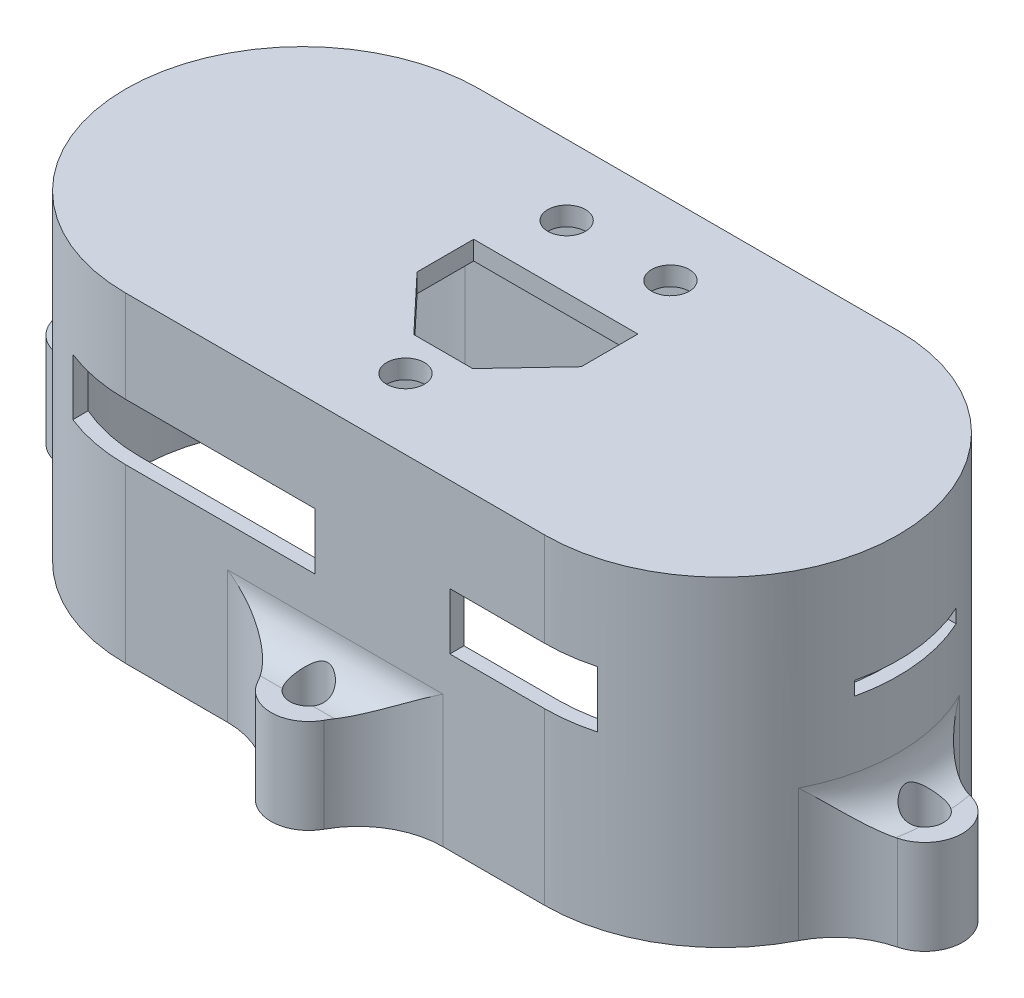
ISO-10303-21;
HEADER;
FILE_DESCRIPTION(('STEP AP214'),'2;1');
FILE_NAME('part.step','',(''),(''),'','','');
FILE_SCHEMA(('AUTOMOTIVE_DESIGN { 1 0 10303 214 1 1 1 1 }'));
ENDSEC;
DATA;
#1=APPLICATION_CONTEXT('core data for automotive mechanical design processes');
#2=APPLICATION_PROTOCOL_DEFINITION('international standard','automotive_design',2000,#1);
#3=PRODUCT_CONTEXT('',#1,'mechanical');
#4=PRODUCT('Part','Part','',(#3));
#5=PRODUCT_RELATED_PRODUCT_CATEGORY('part','',(#4));
#6=PRODUCT_DEFINITION_FORMATION('','',#4);
#7=PRODUCT_DEFINITION_CONTEXT('part definition',#1,'design');
#8=PRODUCT_DEFINITION('design','',#6,#7);
#9=PRODUCT_DEFINITION_SHAPE('','',#8);
#10=(LENGTH_UNIT() NAMED_UNIT(*) SI_UNIT(.MILLI.,.METRE.));
#11=(NAMED_UNIT(*) PLANE_ANGLE_UNIT() SI_UNIT($,.RADIAN.));
#12=(NAMED_UNIT(*) SI_UNIT($,.STERADIAN.) SOLID_ANGLE_UNIT());
#13=UNCERTAINTY_MEASURE_WITH_UNIT(LENGTH_MEASURE(1.E-05),#10,'distance_accuracy_value','');
#14=(GEOMETRIC_REPRESENTATION_CONTEXT(3) GLOBAL_UNCERTAINTY_ASSIGNED_CONTEXT((#13)) GLOBAL_UNIT_ASSIGNED_CONTEXT((#10,
#11,#12)) REPRESENTATION_CONTEXT('',''));
#15=CARTESIAN_POINT('',(0.,0.,0.));
#16=DIRECTION('',(0.,0.,1.));
#17=DIRECTION('',(1.,0.,0.));
#18=AXIS2_PLACEMENT_3D('',#15,#16,#17);
#19=CARTESIAN_POINT('',(-22.2,34.,0.));
#20=DIRECTION('',(0.,1.,0.));
#21=DIRECTION('',(0.,0.,1.));
#22=AXIS2_PLACEMENT_3D('',#19,#20,#21);
#23=PLANE('',#22);
#24=CARTESIAN_POINT('',(-5.5,34.,-11.29));
#25=DIRECTION('',(0.,1.,0.));
#26=DIRECTION('',(0.,0.,1.));
#27=AXIS2_PLACEMENT_3D('',#24,#25,#26);
#28=CIRCLE('',#27,2.);
#29=CARTESIAN_POINT('',(-5.5,34.,-9.29));
#30=VERTEX_POINT('',#29);
#31=EDGE_CURVE('E457',#30,#30,#28,.T.);
#32=ORIENTED_EDGE('',*,*,#31,.F.);
#33=EDGE_LOOP('',(#32));
#34=FACE_BOUND('',#33,.T.);
#35=CARTESIAN_POINT('',(5.5,34.,-11.29));
#36=DIRECTION('',(0.,1.,0.));
#37=DIRECTION('',(0.,0.,1.));
#38=AXIS2_PLACEMENT_3D('',#35,#36,#37);
#39=CIRCLE('',#38,2.);
#40=CARTESIAN_POINT('',(5.5,34.,-9.29));
#41=VERTEX_POINT('',#40);
#42=EDGE_CURVE('E1849',#41,#41,#39,.T.);
#43=ORIENTED_EDGE('',*,*,#42,.F.);
#44=EDGE_LOOP('',(#43));
#45=FACE_BOUND('',#44,.T.);
#46=CARTESIAN_POINT('',(0.,34.,11.285));
#47=DIRECTION('',(0.,1.,0.));
#48=DIRECTION('',(0.,0.,1.));
#49=AXIS2_PLACEMENT_3D('',#46,#47,#48);
#50=CIRCLE('',#49,2.);
#51=CARTESIAN_POINT('',(0.,34.,13.285));
#52=VERTEX_POINT('',#51);
#53=EDGE_CURVE('E1843',#52,#52,#50,.T.);
#54=ORIENTED_EDGE('',*,*,#53,.F.);
#55=EDGE_LOOP('',(#54));
#56=FACE_BOUND('',#55,.T.);
#57=CARTESIAN_POINT('',(-22.2,34.,0.));
#58=DIRECTION('',(0.,1.,0.));
#59=DIRECTION('',(0.,0.,1.));
#60=AXIS2_PLACEMENT_3D('',#57,#58,#59);
#61=CIRCLE('',#60,18.7384881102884);
#62=CARTESIAN_POINT('',(-22.2,34.,-18.7384881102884));
#63=VERTEX_POINT('',#62);
#64=CARTESIAN_POINT('',(-22.2,34.,18.7384881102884));
#65=VERTEX_POINT('',#64);
#66=EDGE_CURVE('E701',#63,#65,#61,.T.);
#67=ORIENTED_EDGE('',*,*,#66,.T.);
#68=DIRECTION('',(1.,0.,0.));
#69=VECTOR('',#68,1.);
#70=CARTESIAN_POINT('',(-22.2,34.,18.7384881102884));
#71=LINE('',#70,#69);
#72=CARTESIAN_POINT('',(22.2,34.,18.7384881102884));
#73=VERTEX_POINT('',#72);
#74=EDGE_CURVE('E704',#65,#73,#71,.T.);
#75=ORIENTED_EDGE('',*,*,#74,.T.);
#76=CARTESIAN_POINT('',(22.2,34.,0.));
#77=DIRECTION('',(0.,1.,0.));
#78=DIRECTION('',(0.,0.,1.));
#79=AXIS2_PLACEMENT_3D('',#76,#77,#78);
#80=CIRCLE('',#79,18.7384881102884);
#81=CARTESIAN_POINT('',(22.2,34.,-18.7384881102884));
#82=VERTEX_POINT('',#81);
#83=EDGE_CURVE('E707',#73,#82,#80,.T.);
#84=ORIENTED_EDGE('',*,*,#83,.T.);
#85=DIRECTION('',(-1.,0.,0.));
#86=VECTOR('',#85,1.);
#87=CARTESIAN_POINT('',(-22.2,34.,-18.7384881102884));
#88=LINE('',#87,#86);
#89=EDGE_CURVE('E709',#82,#63,#88,.T.);
#90=ORIENTED_EDGE('',*,*,#89,.T.);
#91=EDGE_LOOP('',(#67,#75,#84,#90));
#92=FACE_BOUND('',#91,.T.);
#93=DIRECTION('',(0.,0.,1.));
#94=VECTOR('',#93,1.);
#95=CARTESIAN_POINT('',(8.7,34.,0.));
#96=LINE('',#95,#94);
#97=CARTESIAN_POINT('',(8.7,34.,-4.64));
#98=VERTEX_POINT('',#97);
#99=CARTESIAN_POINT('',(8.7,34.,1.36));
#100=VERTEX_POINT('',#99);
#101=EDGE_CURVE('E468',#98,#100,#96,.T.);
#102=ORIENTED_EDGE('',*,*,#101,.T.);
#103=DIRECTION('',(-0.685594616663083,0.,0.727983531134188));
#104=VECTOR('',#103,1.);
#105=CARTESIAN_POINT('',(5.289430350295,34.,4.9814382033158));
#106=LINE('',#105,#104);
#107=CARTESIAN_POINT('',(3.12,34.,7.285));
#108=VERTEX_POINT('',#107);
#109=EDGE_CURVE('E54',#100,#108,#106,.T.);
#110=ORIENTED_EDGE('',*,*,#109,.T.);
#111=DIRECTION('',(-1.,0.,0.));
#112=VECTOR('',#111,1.);
#113=CARTESIAN_POINT('',(0.,34.,7.285));
#114=LINE('',#113,#112);
#115=CARTESIAN_POINT('',(-3.12,34.,7.285));
#116=VERTEX_POINT('',#115);
#117=EDGE_CURVE('E451',#108,#116,#114,.T.);
#118=ORIENTED_EDGE('',*,*,#117,.T.);
#119=DIRECTION('',(0.685594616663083,0.,0.727983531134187));
#120=VECTOR('',#119,1.);
#121=CARTESIAN_POINT('',(-5.289430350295,34.,4.9814382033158));
#122=LINE('',#121,#120);
#123=CARTESIAN_POINT('',(-8.7,34.,1.36));
#124=VERTEX_POINT('',#123);
#125=EDGE_CURVE('E454',#124,#116,#122,.T.);
#126=ORIENTED_EDGE('',*,*,#125,.F.);
#127=DIRECTION('',(0.,0.,1.));
#128=VECTOR('',#127,1.);
#129=CARTESIAN_POINT('',(-8.7,34.,0.));
#130=LINE('',#129,#128);
#131=CARTESIAN_POINT('',(-8.7,34.,-4.64));
#132=VERTEX_POINT('',#131);
#133=EDGE_CURVE('E474',#132,#124,#130,.T.);
#134=ORIENTED_EDGE('',*,*,#133,.F.);
#135=DIRECTION('',(-1.,0.,0.));
#136=VECTOR('',#135,1.);
#137=CARTESIAN_POINT('',(0.,34.,-4.64));
#138=LINE('',#137,#136);
#139=EDGE_CURVE('E471',#98,#132,#138,.T.);
#140=ORIENTED_EDGE('',*,*,#139,.F.);
#141=EDGE_LOOP('',(#102,#110,#118,#126,#134,#140));
#142=FACE_BOUND('',#141,.T.);
#143=ADVANCED_FACE('F34',(#34,#45,#56,#92,#142),#23,.T.);
#144=CARTESIAN_POINT('',(22.2,32.,0.));
#145=DIRECTION('',(0.,-1.,0.));
#146=DIRECTION('',(0.,0.,-1.));
#147=AXIS2_PLACEMENT_3D('',#144,#145,#146);
#148=PLANE('',#147);
#149=CARTESIAN_POINT('',(-5.5,32.,-11.29));
#150=DIRECTION('',(0.,1.,0.));
#151=DIRECTION('',(0.,0.,1.));
#152=AXIS2_PLACEMENT_3D('',#149,#150,#151);
#153=CIRCLE('',#152,2.);
#154=CARTESIAN_POINT('',(-5.5,32.,-9.29));
#155=VERTEX_POINT('',#154);
#156=EDGE_CURVE('E1853',#155,#155,#153,.T.);
#157=ORIENTED_EDGE('',*,*,#156,.T.);
#158=EDGE_LOOP('',(#157));
#159=FACE_BOUND('',#158,.T.);
#160=CARTESIAN_POINT('',(5.5,32.,-11.29));
#161=DIRECTION('',(0.,1.,0.));
#162=DIRECTION('',(0.,0.,1.));
#163=AXIS2_PLACEMENT_3D('',#160,#161,#162);
#164=CIRCLE('',#163,2.);
#165=CARTESIAN_POINT('',(5.5,32.,-9.29));
#166=VERTEX_POINT('',#165);
#167=EDGE_CURVE('E1845',#166,#166,#164,.T.);
#168=ORIENTED_EDGE('',*,*,#167,.T.);
#169=EDGE_LOOP('',(#168));
#170=FACE_BOUND('',#169,.T.);
#171=CARTESIAN_POINT('',(0.,32.,11.285));
#172=DIRECTION('',(0.,1.,0.));
#173=DIRECTION('',(0.,0.,1.));
#174=AXIS2_PLACEMENT_3D('',#171,#172,#173);
#175=CIRCLE('',#174,2.);
#176=CARTESIAN_POINT('',(0.,32.,13.285));
#177=VERTEX_POINT('',#176);
#178=EDGE_CURVE('E469',#177,#177,#175,.T.);
#179=ORIENTED_EDGE('',*,*,#178,.T.);
#180=EDGE_LOOP('',(#179));
#181=FACE_BOUND('',#180,.T.);
#182=CARTESIAN_POINT('',(-29.025,32.,11.525));
#183=DIRECTION('',(0.,-1.,0.));
#184=DIRECTION('',(0.,0.,-1.));
#185=AXIS2_PLACEMENT_3D('',#182,#183,#184);
#186=CIRCLE('',#185,3.);
#187=CARTESIAN_POINT('',(-31.3604299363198,32.,13.4080207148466));
#188=VERTEX_POINT('',#187);
#189=CARTESIAN_POINT('',(-29.5534687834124,32.,14.4780866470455));
#190=VERTEX_POINT('',#189);
#191=EDGE_CURVE('E662',#188,#190,#186,.T.);
#192=ORIENTED_EDGE('',*,*,#191,.F.);
#193=CARTESIAN_POINT('',(-22.2,32.,0.));
#194=DIRECTION('',(0.,-1.,0.));
#195=DIRECTION('',(0.,0.,-1.));
#196=AXIS2_PLACEMENT_3D('',#193,#194,#195);
#197=CIRCLE('',#196,16.2384881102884);
#198=CARTESIAN_POINT('',(-31.3604299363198,32.,-13.4080207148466));
#199=VERTEX_POINT('',#198);
#200=EDGE_CURVE('E754',#188,#199,#197,.T.);
#201=ORIENTED_EDGE('',*,*,#200,.T.);
#202=CARTESIAN_POINT('',(-29.025,32.,-11.525));
#203=DIRECTION('',(0.,-1.,0.));
#204=DIRECTION('',(0.,0.,-1.));
#205=AXIS2_PLACEMENT_3D('',#202,#203,#204);
#206=CIRCLE('',#205,3.);
#207=CARTESIAN_POINT('',(-29.5534687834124,32.,-14.4780866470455));
#208=VERTEX_POINT('',#207);
#209=EDGE_CURVE('E668',#208,#199,#206,.T.);
#210=ORIENTED_EDGE('',*,*,#209,.F.);
#211=CARTESIAN_POINT('',(-22.2,32.,0.));
#212=DIRECTION('',(0.,-1.,0.));
#213=DIRECTION('',(0.,0.,-1.));
#214=AXIS2_PLACEMENT_3D('',#211,#212,#213);
#215=CIRCLE('',#214,16.2384881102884);
#216=CARTESIAN_POINT('',(-22.2,32.,-16.2384881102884));
#217=VERTEX_POINT('',#216);
#218=EDGE_CURVE('E743',#208,#217,#215,.T.);
#219=ORIENTED_EDGE('',*,*,#218,.T.);
#220=DIRECTION('',(1.,0.,0.));
#221=VECTOR('',#220,1.);
#222=CARTESIAN_POINT('',(22.2,32.,-16.2384881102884));
#223=LINE('',#222,#221);
#224=CARTESIAN_POINT('',(22.2,32.,-16.2384881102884));
#225=VERTEX_POINT('',#224);
#226=EDGE_CURVE('E739',#217,#225,#223,.T.);
#227=ORIENTED_EDGE('',*,*,#226,.T.);
#228=CARTESIAN_POINT('',(22.2,32.,0.));
#229=DIRECTION('',(0.,-1.,0.));
#230=DIRECTION('',(0.,0.,-1.));
#231=AXIS2_PLACEMENT_3D('',#228,#229,#230);
#232=CIRCLE('',#231,16.2384881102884);
#233=CARTESIAN_POINT('',(29.5534687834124,32.,-14.4780866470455));
#234=VERTEX_POINT('',#233);
#235=EDGE_CURVE('E741',#225,#234,#232,.T.);
#236=ORIENTED_EDGE('',*,*,#235,.T.);
#237=CARTESIAN_POINT('',(29.025,32.,-11.525));
#238=DIRECTION('',(0.,-1.,0.));
#239=DIRECTION('',(0.,0.,-1.));
#240=AXIS2_PLACEMENT_3D('',#237,#238,#239);
#241=CIRCLE('',#240,3.);
#242=CARTESIAN_POINT('',(31.3604299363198,32.,-13.4080207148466));
#243=VERTEX_POINT('',#242);
#244=EDGE_CURVE('E650',#243,#234,#241,.T.);
#245=ORIENTED_EDGE('',*,*,#244,.F.);
#246=CARTESIAN_POINT('',(22.2,32.,0.));
#247=DIRECTION('',(0.,-1.,0.));
#248=DIRECTION('',(0.,0.,-1.));
#249=AXIS2_PLACEMENT_3D('',#246,#247,#248);
#250=CIRCLE('',#249,16.2384881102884);
#251=CARTESIAN_POINT('',(31.3604299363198,32.,13.4080207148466));
#252=VERTEX_POINT('',#251);
#253=EDGE_CURVE('E752',#243,#252,#250,.T.);
#254=ORIENTED_EDGE('',*,*,#253,.T.);
#255=CARTESIAN_POINT('',(29.025,32.,11.525));
#256=DIRECTION('',(0.,-1.,0.));
#257=DIRECTION('',(0.,0.,-1.));
#258=AXIS2_PLACEMENT_3D('',#255,#256,#257);
#259=CIRCLE('',#258,3.);
#260=CARTESIAN_POINT('',(29.5534687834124,32.,14.4780866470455));
#261=VERTEX_POINT('',#260);
#262=EDGE_CURVE('E656',#261,#252,#259,.T.);
#263=ORIENTED_EDGE('',*,*,#262,.F.);
#264=CARTESIAN_POINT('',(22.2,32.,0.));
#265=DIRECTION('',(0.,-1.,0.));
#266=DIRECTION('',(0.,0.,-1.));
#267=AXIS2_PLACEMENT_3D('',#264,#265,#266);
#268=CIRCLE('',#267,16.2384881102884);
#269=CARTESIAN_POINT('',(22.2,32.,16.2384881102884));
#270=VERTEX_POINT('',#269);
#271=EDGE_CURVE('E745',#261,#270,#268,.T.);
#272=ORIENTED_EDGE('',*,*,#271,.T.);
#273=DIRECTION('',(-1.,0.,0.));
#274=VECTOR('',#273,1.);
#275=CARTESIAN_POINT('',(22.2,32.,16.2384881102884));
#276=LINE('',#275,#274);
#277=CARTESIAN_POINT('',(-22.2,32.,16.2384881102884));
#278=VERTEX_POINT('',#277);
#279=EDGE_CURVE('E747',#270,#278,#276,.T.);
#280=ORIENTED_EDGE('',*,*,#279,.T.);
#281=CARTESIAN_POINT('',(-22.2,32.,0.));
#282=DIRECTION('',(0.,-1.,0.));
#283=DIRECTION('',(0.,0.,-1.));
#284=AXIS2_PLACEMENT_3D('',#281,#282,#283);
#285=CIRCLE('',#284,16.2384881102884);
#286=EDGE_CURVE('E749',#278,#190,#285,.T.);
#287=ORIENTED_EDGE('',*,*,#286,.T.);
#288=EDGE_LOOP('',(#192,#201,#210,#219,#227,#236,#245,#254,#263,#272,#280,#287));
#289=FACE_BOUND('',#288,.T.);
#290=DIRECTION('',(-1.,0.,0.));
#291=VECTOR('',#290,1.);
#292=CARTESIAN_POINT('',(0.,32.,7.285));
#293=LINE('',#292,#291);
#294=CARTESIAN_POINT('',(3.12,32.,7.285));
#295=VERTEX_POINT('',#294);
#296=CARTESIAN_POINT('',(-3.12,32.,7.285));
#297=VERTEX_POINT('',#296);
#298=EDGE_CURVE('E446',#295,#297,#293,.T.);
#299=ORIENTED_EDGE('',*,*,#298,.F.);
#300=DIRECTION('',(-0.685594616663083,0.,0.727983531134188));
#301=VECTOR('',#300,1.);
#302=CARTESIAN_POINT('',(5.289430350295,32.,4.9814382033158));
#303=LINE('',#302,#301);
#304=CARTESIAN_POINT('',(8.7,32.,1.36));
#305=VERTEX_POINT('',#304);
#306=EDGE_CURVE('E442',#305,#295,#303,.T.);
#307=ORIENTED_EDGE('',*,*,#306,.F.);
#308=DIRECTION('',(0.,0.,1.));
#309=VECTOR('',#308,1.);
#310=CARTESIAN_POINT('',(8.7,32.,0.));
#311=LINE('',#310,#309);
#312=CARTESIAN_POINT('',(8.7,32.,-4.64));
#313=VERTEX_POINT('',#312);
#314=EDGE_CURVE('E434',#313,#305,#311,.T.);
#315=ORIENTED_EDGE('',*,*,#314,.F.);
#316=DIRECTION('',(-1.,0.,0.));
#317=VECTOR('',#316,1.);
#318=CARTESIAN_POINT('',(0.,32.,-4.64));
#319=LINE('',#318,#317);
#320=CARTESIAN_POINT('',(-8.7,32.,-4.64));
#321=VERTEX_POINT('',#320);
#322=EDGE_CURVE('E62',#313,#321,#319,.T.);
#323=ORIENTED_EDGE('',*,*,#322,.T.);
#324=DIRECTION('',(0.,0.,1.));
#325=VECTOR('',#324,1.);
#326=CARTESIAN_POINT('',(-8.7,32.,0.));
#327=LINE('',#326,#325);
#328=CARTESIAN_POINT('',(-8.7,32.,1.36));
#329=VERTEX_POINT('',#328);
#330=EDGE_CURVE('E461',#321,#329,#327,.T.);
#331=ORIENTED_EDGE('',*,*,#330,.T.);
#332=DIRECTION('',(0.685594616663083,0.,0.727983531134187));
#333=VECTOR('',#332,1.);
#334=CARTESIAN_POINT('',(-5.289430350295,32.,4.9814382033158));
#335=LINE('',#334,#333);
#336=EDGE_CURVE('E464',#329,#297,#335,.T.);
#337=ORIENTED_EDGE('',*,*,#336,.T.);
#338=EDGE_LOOP('',(#299,#307,#315,#323,#331,#337));
#339=FACE_BOUND('',#338,.T.);
#340=ADVANCED_FACE('F449',(#159,#170,#181,#289,#339),#148,.T.);
#341=CARTESIAN_POINT('',(22.2,34.,0.));
#342=DIRECTION('',(0.,-1.,0.));
#343=DIRECTION('',(0.,0.,-1.));
#344=AXIS2_PLACEMENT_3D('',#341,#342,#343);
#345=CYLINDRICAL_SURFACE('',#344,18.7384881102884);
#346=DIRECTION('',(0.,-1.,0.));
#347=VECTOR('',#346,1.);
#348=CARTESIAN_POINT('',(38.8910221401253,34.,8.51708380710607));
#349=LINE('',#348,#347);
#350=CARTESIAN_POINT('',(38.8910221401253,0.,8.51708380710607));
#351=VERTEX_POINT('',#350);
#352=CARTESIAN_POINT('',(38.8910221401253,14.,8.51708380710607));
#353=VERTEX_POINT('',#352);
#354=EDGE_CURVE('E1309',#351,#353,#349,.F.);
#355=ORIENTED_EDGE('',*,*,#354,.T.);
#356=CARTESIAN_POINT('',(22.2,14.,0.));
#357=DIRECTION('',(0.,-1.,0.));
#358=DIRECTION('',(0.,0.,-1.));
#359=AXIS2_PLACEMENT_3D('',#356,#357,#358);
#360=CIRCLE('',#359,18.7384881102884);
#361=CARTESIAN_POINT('',(38.8910221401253,14.,-8.51708380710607));
#362=VERTEX_POINT('',#361);
#363=EDGE_CURVE('E1167',#353,#362,#360,.F.);
#364=ORIENTED_EDGE('',*,*,#363,.T.);
#365=DIRECTION('',(0.,-1.,0.));
#366=VECTOR('',#365,1.);
#367=CARTESIAN_POINT('',(38.8910221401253,34.,-8.51708380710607));
#368=LINE('',#367,#366);
#369=CARTESIAN_POINT('',(38.8910221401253,0.,-8.51708380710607));
#370=VERTEX_POINT('',#369);
#371=EDGE_CURVE('E1221',#362,#370,#368,.T.);
#372=ORIENTED_EDGE('',*,*,#371,.T.);
#373=CARTESIAN_POINT('',(22.2,0.,0.));
#374=DIRECTION('',(0.,1.,0.));
#375=DIRECTION('',(0.,0.,1.));
#376=AXIS2_PLACEMENT_3D('',#373,#374,#375);
#377=CIRCLE('',#376,18.7384881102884);
#378=CARTESIAN_POINT('',(22.2,0.,-18.7384881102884));
#379=VERTEX_POINT('',#378);
#380=EDGE_CURVE('E719',#370,#379,#377,.T.);
#381=ORIENTED_EDGE('',*,*,#380,.T.);
#382=DIRECTION('',(0.,-1.,0.));
#383=VECTOR('',#382,1.);
#384=CARTESIAN_POINT('',(22.2,34.,-18.7384881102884));
#385=LINE('',#384,#383);
#386=EDGE_CURVE('E728',#82,#379,#385,.T.);
#387=ORIENTED_EDGE('',*,*,#386,.F.);
#388=ORIENTED_EDGE('',*,*,#83,.F.);
#389=DIRECTION('',(0.,-1.,0.));
#390=VECTOR('',#389,1.);
#391=CARTESIAN_POINT('',(22.2,34.,18.7384881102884));
#392=LINE('',#391,#390);
#393=CARTESIAN_POINT('',(22.2,24.05,18.7384881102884));
#394=VERTEX_POINT('',#393);
#395=EDGE_CURVE('E732',#73,#394,#392,.T.);
#396=ORIENTED_EDGE('',*,*,#395,.T.);
#397=CARTESIAN_POINT('',(22.2,24.05,0.));
#398=DIRECTION('',(0.,-1.,0.));
#399=DIRECTION('',(0.,0.,-1.));
#400=AXIS2_PLACEMENT_3D('',#397,#398,#399);
#401=CIRCLE('',#400,18.7384881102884);
#402=CARTESIAN_POINT('',(27.15,24.05,18.0728646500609));
#403=VERTEX_POINT('',#402);
#404=EDGE_CURVE('E618',#403,#394,#401,.T.);
#405=ORIENTED_EDGE('',*,*,#404,.F.);
#406=DIRECTION('',(0.,-1.,0.));
#407=VECTOR('',#406,1.);
#408=CARTESIAN_POINT('',(27.15,34.,18.0728646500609));
#409=LINE('',#408,#407);
#410=CARTESIAN_POINT('',(27.15,18.05,18.0728646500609));
#411=VERTEX_POINT('',#410);
#412=EDGE_CURVE('E624',#411,#403,#409,.F.);
#413=ORIENTED_EDGE('',*,*,#412,.F.);
#414=CARTESIAN_POINT('',(22.2,18.05,0.));
#415=DIRECTION('',(0.,1.,0.));
#416=DIRECTION('',(0.,0.,1.));
#417=AXIS2_PLACEMENT_3D('',#414,#415,#416);
#418=CIRCLE('',#417,18.7384881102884);
#419=CARTESIAN_POINT('',(22.2,18.05,18.7384881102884));
#420=VERTEX_POINT('',#419);
#421=EDGE_CURVE('E612',#420,#411,#418,.T.);
#422=ORIENTED_EDGE('',*,*,#421,.F.);
#423=CARTESIAN_POINT('',(22.2,0.,18.7384881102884));
#424=VERTEX_POINT('',#423);
#425=EDGE_CURVE('E731',#420,#424,#392,.T.);
#426=ORIENTED_EDGE('',*,*,#425,.T.);
#427=EDGE_CURVE('E720',#424,#351,#377,.T.);
#428=ORIENTED_EDGE('',*,*,#427,.T.);
#429=EDGE_LOOP('',(#355,#364,#372,#381,#387,#388,#396,#405,#413,#422,#426,#428));
#430=FACE_BOUND('',#429,.T.);
#431=CARTESIAN_POINT('',(22.2,22.491915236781,0.));
#432=DIRECTION('',(0.,-1.,0.));
#433=DIRECTION('',(0.,0.,-1.));
#434=AXIS2_PLACEMENT_3D('',#431,#432,#433);
#435=CIRCLE('',#434,18.7384881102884);
#436=CARTESIAN_POINT('',(39.2103997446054,22.491915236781,-7.8598496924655));
#437=VERTEX_POINT('',#436);
#438=CARTESIAN_POINT('',(40.4731616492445,22.491915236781,4.15));
#439=VERTEX_POINT('',#438);
#440=EDGE_CURVE('E547',#437,#439,#435,.T.);
#441=ORIENTED_EDGE('',*,*,#440,.F.);
#442=DIRECTION('',(0.,-1.,0.));
#443=VECTOR('',#442,1.);
#444=CARTESIAN_POINT('',(39.2103997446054,34.,-7.8598496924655));
#445=LINE('',#444,#443);
#446=CARTESIAN_POINT('',(39.2103997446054,21.05,-7.8598496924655));
#447=VERTEX_POINT('',#446);
#448=EDGE_CURVE('E549',#447,#437,#445,.F.);
#449=ORIENTED_EDGE('',*,*,#448,.F.);
#450=CARTESIAN_POINT('',(22.2,21.05,0.));
#451=DIRECTION('',(0.,1.,0.));
#452=DIRECTION('',(0.,0.,1.));
#453=AXIS2_PLACEMENT_3D('',#450,#451,#452);
#454=CIRCLE('',#453,18.7384881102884);
#455=CARTESIAN_POINT('',(40.4731616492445,21.05,4.15));
#456=VERTEX_POINT('',#455);
#457=EDGE_CURVE('E551',#456,#447,#454,.T.);
#458=ORIENTED_EDGE('',*,*,#457,.F.);
#459=DIRECTION('',(0.,-1.,0.));
#460=VECTOR('',#459,1.);
#461=CARTESIAN_POINT('',(40.4731616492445,34.,4.15));
#462=LINE('',#461,#460);
#463=EDGE_CURVE('E553',#439,#456,#462,.T.);
#464=ORIENTED_EDGE('',*,*,#463,.F.);
#465=EDGE_LOOP('',(#441,#449,#458,#464));
#466=FACE_BOUND('',#465,.T.);
#467=ADVANCED_FACE('F794',(#430,#466),#345,.T.);
#468=CARTESIAN_POINT('',(22.2,32.,0.));
#469=DIRECTION('',(0.,-1.,0.));
#470=DIRECTION('',(0.,0.,-1.));
#471=AXIS2_PLACEMENT_3D('',#468,#469,#470);
#472=CYLINDRICAL_SURFACE('',#471,17.2384881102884);
#473=CARTESIAN_POINT('',(22.2,24.05,0.));
#474=DIRECTION('',(0.,-1.,0.));
#475=DIRECTION('',(0.,0.,-1.));
#476=AXIS2_PLACEMENT_3D('',#473,#474,#475);
#477=CIRCLE('',#476,17.2384881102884);
#478=CARTESIAN_POINT('',(22.2,24.05,17.2384881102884));
#479=VERTEX_POINT('',#478);
#480=CARTESIAN_POINT('',(27.15,24.05,16.5125095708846));
#481=VERTEX_POINT('',#480);
#482=EDGE_CURVE('E616',#479,#481,#477,.F.);
#483=ORIENTED_EDGE('',*,*,#482,.F.);
#484=DIRECTION('',(0.,-1.,0.));
#485=VECTOR('',#484,1.);
#486=CARTESIAN_POINT('',(22.2,32.,17.2384881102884));
#487=LINE('',#486,#485);
#488=CARTESIAN_POINT('',(22.2,31.,17.2384881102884));
#489=VERTEX_POINT('',#488);
#490=EDGE_CURVE('E698',#489,#479,#487,.T.);
#491=ORIENTED_EDGE('',*,*,#490,.F.);
#492=CARTESIAN_POINT('',(22.2,31.,0.));
#493=DIRECTION('',(0.,-1.,0.));
#494=DIRECTION('',(0.,0.,-1.));
#495=AXIS2_PLACEMENT_3D('',#492,#493,#494);
#496=CIRCLE('',#495,17.2384881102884);
#497=CARTESIAN_POINT('',(22.2,31.,-17.2384881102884));
#498=VERTEX_POINT('',#497);
#499=EDGE_CURVE('E1723',#489,#498,#496,.F.);
#500=ORIENTED_EDGE('',*,*,#499,.T.);
#501=DIRECTION('',(0.,-1.,0.));
#502=VECTOR('',#501,1.);
#503=CARTESIAN_POINT('',(22.2,32.,-17.2384881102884));
#504=LINE('',#503,#502);
#505=CARTESIAN_POINT('',(22.2,0.,-17.2384881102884));
#506=VERTEX_POINT('',#505);
#507=EDGE_CURVE('E689',#498,#506,#504,.T.);
#508=ORIENTED_EDGE('',*,*,#507,.T.);
#509=CARTESIAN_POINT('',(22.2,0.,0.));
#510=DIRECTION('',(0.,-1.,0.));
#511=DIRECTION('',(0.,0.,-1.));
#512=AXIS2_PLACEMENT_3D('',#509,#510,#511);
#513=CIRCLE('',#512,17.2384881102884);
#514=CARTESIAN_POINT('',(22.2,0.,17.2384881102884));
#515=VERTEX_POINT('',#514);
#516=EDGE_CURVE('E674',#506,#515,#513,.T.);
#517=ORIENTED_EDGE('',*,*,#516,.T.);
#518=CARTESIAN_POINT('',(22.2,18.05,17.2384881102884));
#519=VERTEX_POINT('',#518);
#520=EDGE_CURVE('E688',#519,#515,#487,.T.);
#521=ORIENTED_EDGE('',*,*,#520,.F.);
#522=CARTESIAN_POINT('',(22.2,18.05,0.));
#523=DIRECTION('',(0.,1.,0.));
#524=DIRECTION('',(0.,0.,1.));
#525=AXIS2_PLACEMENT_3D('',#522,#523,#524);
#526=CIRCLE('',#525,17.2384881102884);
#527=CARTESIAN_POINT('',(27.15,18.05,16.5125095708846));
#528=VERTEX_POINT('',#527);
#529=EDGE_CURVE('E610',#528,#519,#526,.F.);
#530=ORIENTED_EDGE('',*,*,#529,.F.);
#531=DIRECTION('',(0.,-1.,0.));
#532=VECTOR('',#531,1.);
#533=CARTESIAN_POINT('',(27.15,32.,16.5125095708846));
#534=LINE('',#533,#532);
#535=EDGE_CURVE('E1274',#481,#528,#534,.T.);
#536=ORIENTED_EDGE('',*,*,#535,.F.);
#537=EDGE_LOOP('',(#483,#491,#500,#508,#517,#521,#530,#536));
#538=FACE_BOUND('',#537,.T.);
#539=DIRECTION('',(0.,-1.,0.));
#540=VECTOR('',#539,1.);
#541=CARTESIAN_POINT('',(38.9314964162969,32.,4.15));
#542=LINE('',#541,#540);
#543=CARTESIAN_POINT('',(38.9314964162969,21.05,4.15));
#544=VERTEX_POINT('',#543);
#545=CARTESIAN_POINT('',(38.9314964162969,22.491915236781,4.15));
#546=VERTEX_POINT('',#545);
#547=EDGE_CURVE('E1299',#544,#546,#542,.F.);
#548=ORIENTED_EDGE('',*,*,#547,.F.);
#549=CARTESIAN_POINT('',(22.2,21.05,0.));
#550=DIRECTION('',(0.,1.,0.));
#551=DIRECTION('',(0.,0.,1.));
#552=AXIS2_PLACEMENT_3D('',#549,#550,#551);
#553=CIRCLE('',#552,17.2384881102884);
#554=CARTESIAN_POINT('',(37.5423673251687,21.05,-7.8598496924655));
#555=VERTEX_POINT('',#554);
#556=EDGE_CURVE('E1297',#555,#544,#553,.F.);
#557=ORIENTED_EDGE('',*,*,#556,.F.);
#558=DIRECTION('',(0.,-1.,0.));
#559=VECTOR('',#558,1.);
#560=CARTESIAN_POINT('',(37.5423673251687,32.,-7.8598496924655));
#561=LINE('',#560,#559);
#562=CARTESIAN_POINT('',(37.5423673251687,22.491915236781,-7.8598496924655));
#563=VERTEX_POINT('',#562);
#564=EDGE_CURVE('E1295',#563,#555,#561,.T.);
#565=ORIENTED_EDGE('',*,*,#564,.F.);
#566=CARTESIAN_POINT('',(22.2,22.491915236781,0.));
#567=DIRECTION('',(0.,-1.,0.));
#568=DIRECTION('',(0.,0.,-1.));
#569=AXIS2_PLACEMENT_3D('',#566,#567,#568);
#570=CIRCLE('',#569,17.2384881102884);
#571=EDGE_CURVE('E1293',#546,#563,#570,.F.);
#572=ORIENTED_EDGE('',*,*,#571,.F.);
#573=EDGE_LOOP('',(#548,#557,#565,#572));
#574=FACE_BOUND('',#573,.T.);
#575=ADVANCED_FACE('F809',(#538,#574),#472,.F.);
#576=CARTESIAN_POINT('',(-22.2,34.,18.7384881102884));
#577=DIRECTION('',(0.,0.,-1.));
#578=DIRECTION('',(-1.,0.,0.));
#579=AXIS2_PLACEMENT_3D('',#576,#577,#578);
#580=PLANE('',#579);
#581=DIRECTION('',(0.,-1.,0.));
#582=VECTOR('',#581,1.);
#583=CARTESIAN_POINT('',(-11.4262854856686,34.,18.7384881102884));
#584=LINE('',#583,#582);
#585=CARTESIAN_POINT('',(-11.4262854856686,0.,18.7384881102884));
#586=VERTEX_POINT('',#585);
#587=CARTESIAN_POINT('',(-11.4262854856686,14.,18.7384881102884));
#588=VERTEX_POINT('',#587);
#589=EDGE_CURVE('E1217',#586,#588,#584,.F.);
#590=ORIENTED_EDGE('',*,*,#589,.T.);
#591=DIRECTION('',(-1.,0.,0.));
#592=VECTOR('',#591,1.);
#593=CARTESIAN_POINT('',(11.4262854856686,14.,18.7384881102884));
#594=LINE('',#593,#592);
#595=CARTESIAN_POINT('',(11.4262854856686,14.,18.7384881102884));
#596=VERTEX_POINT('',#595);
#597=EDGE_CURVE('E1159',#588,#596,#594,.F.);
#598=ORIENTED_EDGE('',*,*,#597,.T.);
#599=DIRECTION('',(0.,-1.,0.));
#600=VECTOR('',#599,1.);
#601=CARTESIAN_POINT('',(11.4262854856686,34.,18.7384881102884));
#602=LINE('',#601,#600);
#603=CARTESIAN_POINT('',(11.4262854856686,0.,18.7384881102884));
#604=VERTEX_POINT('',#603);
#605=EDGE_CURVE('E1219',#596,#604,#602,.T.);
#606=ORIENTED_EDGE('',*,*,#605,.T.);
#607=DIRECTION('',(1.,0.,0.));
#608=VECTOR('',#607,1.);
#609=CARTESIAN_POINT('',(-22.2,0.,18.7384881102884));
#610=LINE('',#609,#608);
#611=EDGE_CURVE('E715',#604,#424,#610,.T.);
#612=ORIENTED_EDGE('',*,*,#611,.T.);
#613=ORIENTED_EDGE('',*,*,#425,.F.);
#614=DIRECTION('',(1.,0.,0.));
#615=VECTOR('',#614,1.);
#616=CARTESIAN_POINT('',(-22.2,18.05,18.7384881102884));
#617=LINE('',#616,#615);
#618=CARTESIAN_POINT('',(12.15,18.05,18.7384881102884));
#619=VERTEX_POINT('',#618);
#620=EDGE_CURVE('E614',#619,#420,#617,.T.);
#621=ORIENTED_EDGE('',*,*,#620,.F.);
#622=DIRECTION('',(0.,-1.,0.));
#623=VECTOR('',#622,1.);
#624=CARTESIAN_POINT('',(12.15,34.,18.7384881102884));
#625=LINE('',#624,#623);
#626=CARTESIAN_POINT('',(12.15,24.05,18.7384881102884));
#627=VERTEX_POINT('',#626);
#628=EDGE_CURVE('E622',#627,#619,#625,.T.);
#629=ORIENTED_EDGE('',*,*,#628,.F.);
#630=DIRECTION('',(-1.,0.,0.));
#631=VECTOR('',#630,1.);
#632=CARTESIAN_POINT('',(-22.2,24.05,18.7384881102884));
#633=LINE('',#632,#631);
#634=EDGE_CURVE('E620',#394,#627,#633,.T.);
#635=ORIENTED_EDGE('',*,*,#634,.F.);
#636=ORIENTED_EDGE('',*,*,#395,.F.);
#637=ORIENTED_EDGE('',*,*,#74,.F.);
#638=DIRECTION('',(0.,-1.,0.));
#639=VECTOR('',#638,1.);
#640=CARTESIAN_POINT('',(-22.2,34.,18.7384881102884));
#641=LINE('',#640,#639);
#642=CARTESIAN_POINT('',(-22.2,24.2421853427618,18.7384881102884));
#643=VERTEX_POINT('',#642);
#644=EDGE_CURVE('E736',#65,#643,#641,.T.);
#645=ORIENTED_EDGE('',*,*,#644,.T.);
#646=DIRECTION('',(-1.,0.,0.));
#647=VECTOR('',#646,1.);
#648=CARTESIAN_POINT('',(-22.2,24.2421853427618,18.7384881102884));
#649=LINE('',#648,#647);
#650=CARTESIAN_POINT('',(-2.13783292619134,24.2421853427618,18.7384881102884));
#651=VERTEX_POINT('',#650);
#652=EDGE_CURVE('E588',#651,#643,#649,.T.);
#653=ORIENTED_EDGE('',*,*,#652,.F.);
#654=DIRECTION('',(0.,1.,0.));
#655=VECTOR('',#654,1.);
#656=CARTESIAN_POINT('',(-2.13783292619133,34.,18.7384881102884));
#657=LINE('',#656,#655);
#658=CARTESIAN_POINT('',(-2.13783292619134,18.2421853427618,18.7384881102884));
#659=VERTEX_POINT('',#658);
#660=EDGE_CURVE('E596',#659,#651,#657,.T.);
#661=ORIENTED_EDGE('',*,*,#660,.F.);
#662=DIRECTION('',(1.,0.,0.));
#663=VECTOR('',#662,1.);
#664=CARTESIAN_POINT('',(-22.2,18.2421853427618,18.7384881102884));
#665=LINE('',#664,#663);
#666=CARTESIAN_POINT('',(-22.2,18.2421853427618,18.7384881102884));
#667=VERTEX_POINT('',#666);
#668=EDGE_CURVE('E594',#667,#659,#665,.T.);
#669=ORIENTED_EDGE('',*,*,#668,.F.);
#670=CARTESIAN_POINT('',(-22.2,0.,18.7384881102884));
#671=VERTEX_POINT('',#670);
#672=EDGE_CURVE('E735',#667,#671,#641,.T.);
#673=ORIENTED_EDGE('',*,*,#672,.T.);
#674=EDGE_CURVE('E716',#671,#586,#610,.T.);
#675=ORIENTED_EDGE('',*,*,#674,.T.);
#676=EDGE_LOOP('',(#590,#598,#606,#612,#613,#621,#629,#635,#636,#637,#645,#653,#661,#669,#673,#675));
#677=FACE_BOUND('',#676,.T.);
#678=ADVANCED_FACE('F807',(#677),#580,.F.);
#679=CARTESIAN_POINT('',(22.2,32.,17.2384881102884));
#680=DIRECTION('',(0.,0.,1.));
#681=DIRECTION('',(1.,0.,0.));
#682=AXIS2_PLACEMENT_3D('',#679,#680,#681);
#683=PLANE('',#682);
#684=DIRECTION('',(1.,0.,0.));
#685=VECTOR('',#684,1.);
#686=CARTESIAN_POINT('',(22.2,24.2421853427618,17.2384881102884));
#687=LINE('',#686,#685);
#688=CARTESIAN_POINT('',(-22.2,24.2421853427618,17.2384881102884));
#689=VERTEX_POINT('',#688);
#690=CARTESIAN_POINT('',(-2.13783292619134,24.2421853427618,17.2384881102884));
#691=VERTEX_POINT('',#690);
#692=EDGE_CURVE('E584',#689,#691,#687,.T.);
#693=ORIENTED_EDGE('',*,*,#692,.F.);
#694=DIRECTION('',(0.,-1.,0.));
#695=VECTOR('',#694,1.);
#696=CARTESIAN_POINT('',(-22.2,32.,17.2384881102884));
#697=LINE('',#696,#695);
#698=CARTESIAN_POINT('',(-22.2,31.,17.2384881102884));
#699=VERTEX_POINT('',#698);
#700=EDGE_CURVE('E694',#699,#689,#697,.T.);
#701=ORIENTED_EDGE('',*,*,#700,.F.);
#702=DIRECTION('',(-1.,0.,0.));
#703=VECTOR('',#702,1.);
#704=CARTESIAN_POINT('',(22.2,31.,17.2384881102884));
#705=LINE('',#704,#703);
#706=EDGE_CURVE('E1055',#699,#489,#705,.F.);
#707=ORIENTED_EDGE('',*,*,#706,.T.);
#708=ORIENTED_EDGE('',*,*,#490,.T.);
#709=DIRECTION('',(1.,0.,0.));
#710=VECTOR('',#709,1.);
#711=CARTESIAN_POINT('',(22.2,24.05,17.2384881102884));
#712=LINE('',#711,#710);
#713=CARTESIAN_POINT('',(12.15,24.05,17.2384881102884));
#714=VERTEX_POINT('',#713);
#715=EDGE_CURVE('E1277',#714,#479,#712,.T.);
#716=ORIENTED_EDGE('',*,*,#715,.F.);
#717=DIRECTION('',(0.,1.,0.));
#718=VECTOR('',#717,1.);
#719=CARTESIAN_POINT('',(12.15,32.,17.2384881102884));
#720=LINE('',#719,#718);
#721=CARTESIAN_POINT('',(12.15,18.05,17.2384881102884));
#722=VERTEX_POINT('',#721);
#723=EDGE_CURVE('E1281',#722,#714,#720,.T.);
#724=ORIENTED_EDGE('',*,*,#723,.F.);
#725=DIRECTION('',(-1.,0.,0.));
#726=VECTOR('',#725,1.);
#727=CARTESIAN_POINT('',(22.2,18.05,17.2384881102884));
#728=LINE('',#727,#726);
#729=EDGE_CURVE('E1728',#519,#722,#728,.T.);
#730=ORIENTED_EDGE('',*,*,#729,.F.);
#731=ORIENTED_EDGE('',*,*,#520,.T.);
#732=DIRECTION('',(-1.,0.,0.));
#733=VECTOR('',#732,1.);
#734=CARTESIAN_POINT('',(22.2,0.,17.2384881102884));
#735=LINE('',#734,#733);
#736=CARTESIAN_POINT('',(-22.2,0.,17.2384881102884));
#737=VERTEX_POINT('',#736);
#738=EDGE_CURVE('E679',#515,#737,#735,.T.);
#739=ORIENTED_EDGE('',*,*,#738,.T.);
#740=CARTESIAN_POINT('',(-22.2,18.2421853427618,17.2384881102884));
#741=VERTEX_POINT('',#740);
#742=EDGE_CURVE('E697',#741,#737,#697,.T.);
#743=ORIENTED_EDGE('',*,*,#742,.F.);
#744=DIRECTION('',(-1.,0.,0.));
#745=VECTOR('',#744,1.);
#746=CARTESIAN_POINT('',(22.2,18.2421853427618,17.2384881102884));
#747=LINE('',#746,#745);
#748=CARTESIAN_POINT('',(-2.13783292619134,18.2421853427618,17.2384881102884));
#749=VERTEX_POINT('',#748);
#750=EDGE_CURVE('E590',#749,#741,#747,.T.);
#751=ORIENTED_EDGE('',*,*,#750,.F.);
#752=DIRECTION('',(0.,-1.,0.));
#753=VECTOR('',#752,1.);
#754=CARTESIAN_POINT('',(-2.13783292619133,32.,17.2384881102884));
#755=LINE('',#754,#753);
#756=EDGE_CURVE('E1291',#691,#749,#755,.T.);
#757=ORIENTED_EDGE('',*,*,#756,.F.);
#758=EDGE_LOOP('',(#693,#701,#707,#708,#716,#724,#730,#731,#739,#743,#751,#757));
#759=FACE_BOUND('',#758,.T.);
#760=ADVANCED_FACE('F804',(#759),#683,.F.);
#761=CARTESIAN_POINT('',(-22.2,34.,0.));
#762=DIRECTION('',(0.,-1.,0.));
#763=DIRECTION('',(0.,0.,-1.));
#764=AXIS2_PLACEMENT_3D('',#761,#762,#763);
#765=CYLINDRICAL_SURFACE('',#764,18.7384881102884);
#766=DIRECTION('',(0.,-1.,0.));
#767=VECTOR('',#766,1.);
#768=CARTESIAN_POINT('',(-38.8910221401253,34.,-8.51708380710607));
#769=LINE('',#768,#767);
#770=CARTESIAN_POINT('',(-38.8910221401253,0.,-8.51708380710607));
#771=VERTEX_POINT('',#770);
#772=CARTESIAN_POINT('',(-38.8910221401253,14.,-8.51708380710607));
#773=VERTEX_POINT('',#772);
#774=EDGE_CURVE('E834',#771,#773,#769,.F.);
#775=ORIENTED_EDGE('',*,*,#774,.T.);
#776=CARTESIAN_POINT('',(-22.2,14.,0.));
#777=DIRECTION('',(0.,-1.,0.));
#778=DIRECTION('',(0.,0.,-1.));
#779=AXIS2_PLACEMENT_3D('',#776,#777,#778);
#780=CIRCLE('',#779,18.7384881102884);
#781=CARTESIAN_POINT('',(-38.8910221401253,14.,8.51708380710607));
#782=VERTEX_POINT('',#781);
#783=EDGE_CURVE('E838',#773,#782,#780,.F.);
#784=ORIENTED_EDGE('',*,*,#783,.T.);
#785=DIRECTION('',(0.,-1.,0.));
#786=VECTOR('',#785,1.);
#787=CARTESIAN_POINT('',(-38.8910221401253,34.,8.51708380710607));
#788=LINE('',#787,#786);
#789=CARTESIAN_POINT('',(-38.8910221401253,0.,8.51708380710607));
#790=VERTEX_POINT('',#789);
#791=EDGE_CURVE('E844',#782,#790,#788,.T.);
#792=ORIENTED_EDGE('',*,*,#791,.T.);
#793=CARTESIAN_POINT('',(-22.2,0.,0.));
#794=DIRECTION('',(0.,1.,0.));
#795=DIRECTION('',(0.,0.,1.));
#796=AXIS2_PLACEMENT_3D('',#793,#794,#795);
#797=CIRCLE('',#796,18.7384881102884);
#798=EDGE_CURVE('E691',#790,#671,#797,.T.);
#799=ORIENTED_EDGE('',*,*,#798,.T.);
#800=ORIENTED_EDGE('',*,*,#672,.F.);
#801=CARTESIAN_POINT('',(-22.2,18.2421853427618,0.));
#802=DIRECTION('',(0.,1.,0.));
#803=DIRECTION('',(0.,0.,1.));
#804=AXIS2_PLACEMENT_3D('',#801,#802,#803);
#805=CIRCLE('',#804,18.7384881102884);
#806=CARTESIAN_POINT('',(-29.1378329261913,18.2421853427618,17.4068208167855));
#807=VERTEX_POINT('',#806);
#808=EDGE_CURVE('E592',#807,#667,#805,.T.);
#809=ORIENTED_EDGE('',*,*,#808,.F.);
#810=DIRECTION('',(0.,-1.,0.));
#811=VECTOR('',#810,1.);
#812=CARTESIAN_POINT('',(-29.1378329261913,34.,17.4068208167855));
#813=LINE('',#812,#811);
#814=CARTESIAN_POINT('',(-29.1378329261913,24.2421853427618,17.4068208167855));
#815=VERTEX_POINT('',#814);
#816=EDGE_CURVE('E579',#815,#807,#813,.T.);
#817=ORIENTED_EDGE('',*,*,#816,.F.);
#818=CARTESIAN_POINT('',(-22.2,24.2421853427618,0.));
#819=DIRECTION('',(0.,-1.,0.));
#820=DIRECTION('',(0.,0.,-1.));
#821=AXIS2_PLACEMENT_3D('',#818,#819,#820);
#822=CIRCLE('',#821,18.7384881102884);
#823=EDGE_CURVE('E586',#643,#815,#822,.T.);
#824=ORIENTED_EDGE('',*,*,#823,.F.);
#825=ORIENTED_EDGE('',*,*,#644,.F.);
#826=ORIENTED_EDGE('',*,*,#66,.F.);
#827=DIRECTION('',(0.,-1.,0.));
#828=VECTOR('',#827,1.);
#829=CARTESIAN_POINT('',(-22.2,34.,-18.7384881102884));
#830=LINE('',#829,#828);
#831=CARTESIAN_POINT('',(-22.2,0.,-18.7384881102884));
#832=VERTEX_POINT('',#831);
#833=EDGE_CURVE('E711',#63,#832,#830,.T.);
#834=ORIENTED_EDGE('',*,*,#833,.T.);
#835=EDGE_CURVE('E712',#832,#771,#797,.T.);
#836=ORIENTED_EDGE('',*,*,#835,.T.);
#837=EDGE_LOOP('',(#775,#784,#792,#799,#800,#809,#817,#824,#825,#826,#834,#836));
#838=FACE_BOUND('',#837,.T.);
#839=ADVANCED_FACE('F802',(#838),#765,.T.);
#840=CARTESIAN_POINT('',(-22.2,32.,0.));
#841=DIRECTION('',(0.,-1.,0.));
#842=DIRECTION('',(0.,0.,-1.));
#843=AXIS2_PLACEMENT_3D('',#840,#841,#842);
#844=CYLINDRICAL_SURFACE('',#843,17.2384881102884);
#845=CARTESIAN_POINT('',(-22.2,24.2421853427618,0.));
#846=DIRECTION('',(0.,-1.,0.));
#847=DIRECTION('',(0.,0.,-1.));
#848=AXIS2_PLACEMENT_3D('',#845,#846,#847);
#849=CIRCLE('',#848,17.2384881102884);
#850=CARTESIAN_POINT('',(-29.1378329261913,24.2421853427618,15.780746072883));
#851=VERTEX_POINT('',#850);
#852=EDGE_CURVE('E582',#851,#689,#849,.F.);
#853=ORIENTED_EDGE('',*,*,#852,.F.);
#854=DIRECTION('',(0.,-1.,0.));
#855=VECTOR('',#854,1.);
#856=CARTESIAN_POINT('',(-29.1378329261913,32.,15.780746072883));
#857=LINE('',#856,#855);
#858=CARTESIAN_POINT('',(-29.1378329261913,18.2421853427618,15.780746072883));
#859=VERTEX_POINT('',#858);
#860=EDGE_CURVE('E577',#859,#851,#857,.F.);
#861=ORIENTED_EDGE('',*,*,#860,.F.);
#862=CARTESIAN_POINT('',(-22.2,18.2421853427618,0.));
#863=DIRECTION('',(0.,1.,0.));
#864=DIRECTION('',(0.,0.,1.));
#865=AXIS2_PLACEMENT_3D('',#862,#863,#864);
#866=CIRCLE('',#865,17.2384881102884);
#867=EDGE_CURVE('E1289',#741,#859,#866,.F.);
#868=ORIENTED_EDGE('',*,*,#867,.F.);
#869=ORIENTED_EDGE('',*,*,#742,.T.);
#870=CARTESIAN_POINT('',(-22.2,0.,0.));
#871=DIRECTION('',(0.,-1.,0.));
#872=DIRECTION('',(0.,0.,-1.));
#873=AXIS2_PLACEMENT_3D('',#870,#871,#872);
#874=CIRCLE('',#873,17.2384881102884);
#875=CARTESIAN_POINT('',(-22.2,0.,-17.2384881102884));
#876=VERTEX_POINT('',#875);
#877=EDGE_CURVE('E682',#737,#876,#874,.T.);
#878=ORIENTED_EDGE('',*,*,#877,.T.);
#879=DIRECTION('',(0.,-1.,0.));
#880=VECTOR('',#879,1.);
#881=CARTESIAN_POINT('',(-22.2,32.,-17.2384881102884));
#882=LINE('',#881,#880);
#883=CARTESIAN_POINT('',(-22.2,31.,-17.2384881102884));
#884=VERTEX_POINT('',#883);
#885=EDGE_CURVE('E692',#884,#876,#882,.T.);
#886=ORIENTED_EDGE('',*,*,#885,.F.);
#887=CARTESIAN_POINT('',(-22.2,31.,0.));
#888=DIRECTION('',(0.,-1.,0.));
#889=DIRECTION('',(0.,0.,-1.));
#890=AXIS2_PLACEMENT_3D('',#887,#888,#889);
#891=CIRCLE('',#890,17.2384881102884);
#892=EDGE_CURVE('E1764',#884,#699,#891,.F.);
#893=ORIENTED_EDGE('',*,*,#892,.T.);
#894=ORIENTED_EDGE('',*,*,#700,.T.);
#895=EDGE_LOOP('',(#853,#861,#868,#869,#878,#886,#893,#894));
#896=FACE_BOUND('',#895,.T.);
#897=ADVANCED_FACE('F779',(#896),#844,.F.);
#898=CARTESIAN_POINT('',(-29.025,24.,11.525));
#899=DIRECTION('',(0.,1.,0.));
#900=DIRECTION('',(0.,0.,1.));
#901=AXIS2_PLACEMENT_3D('',#898,#899,#900);
#902=CYLINDRICAL_SURFACE('',#901,3.);
#903=ORIENTED_EDGE('',*,*,#191,.T.);
#904=CARTESIAN_POINT('',(-29.5534687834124,32.,14.4780866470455));
#905=CARTESIAN_POINT('',(-29.5946948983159,31.9999977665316,14.4707090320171));
#906=CARTESIAN_POINT('',(-29.6357604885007,31.9997810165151,14.4624690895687));
#907=CARTESIAN_POINT('',(-29.7175071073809,31.9990496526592,14.4442786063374));
#908=CARTESIAN_POINT('',(-29.7581881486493,31.9985350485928,14.4343281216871));
#909=CARTESIAN_POINT('',(-29.8795498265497,31.9967413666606,14.4019347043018));
#910=CARTESIAN_POINT('',(-29.959562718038,31.9952123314,14.376947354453));
#911=CARTESIAN_POINT('',(-30.1173114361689,31.9922996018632,14.3203335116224));
#912=CARTESIAN_POINT('',(-30.1950442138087,31.990916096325,14.2886985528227));
#913=CARTESIAN_POINT('',(-30.3475906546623,31.9888313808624,14.2190272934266));
#914=CARTESIAN_POINT('',(-30.4224046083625,31.9881301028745,14.1809916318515));
#915=CARTESIAN_POINT('',(-30.5689774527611,31.9876473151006,14.0985658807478));
#916=CARTESIAN_POINT('',(-30.6407178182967,31.9878707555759,14.0541428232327));
#917=CARTESIAN_POINT('',(-30.7801980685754,31.9891738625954,13.9594169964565));
#918=CARTESIAN_POINT('',(-30.8479379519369,31.9902535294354,13.9091142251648));
#919=CARTESIAN_POINT('',(-30.9787630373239,31.9928767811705,13.803130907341));
#920=CARTESIAN_POINT('',(-31.0418598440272,31.9944191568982,13.7474646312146));
#921=CARTESIAN_POINT('',(-31.1631297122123,31.9972936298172,13.6310526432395));
#922=CARTESIAN_POINT('',(-31.2213060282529,31.9986258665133,13.5703103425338));
#923=CARTESIAN_POINT('',(-31.2911122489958,31.9995724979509,13.491012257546));
#924=CARTESIAN_POINT('',(-31.3052323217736,31.9997279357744,13.4746176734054));
#925=CARTESIAN_POINT('',(-31.3331049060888,31.9999417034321,13.4415382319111));
#926=CARTESIAN_POINT('',(-31.3468576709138,32.0000001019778,13.4248535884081));
#927=CARTESIAN_POINT('',(-31.3604299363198,32.,13.4080207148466));
#928=B_SPLINE_CURVE_WITH_KNOTS('',3,(#904,#905,#906,#907,#908,#909,#910,#911,#912,#913,#914,
#915,#916,#917,#918,#919,#920,#921,#922,#923,#924,#925,#926,#927),.UNSPECIFIED.,.F.,.F.,(4,2,2,
2,2,2,2,2,2,2,2,4),(0.,0.125621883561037,0.251239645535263,0.502433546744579,0.753949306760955,
1.00543997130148,1.25827866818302,1.51111745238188,1.76330118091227,2.01531678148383,
2.08022613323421,2.14508950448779),.UNSPECIFIED.);
#929=EDGE_CURVE('E756',#190,#188,#928,.T.);
#930=ORIENTED_EDGE('',*,*,#929,.T.);
#931=EDGE_LOOP('',(#903,#930));
#932=FACE_BOUND('',#931,.T.);
#933=DIRECTION('',(0.,1.,0.));
#934=VECTOR('',#933,1.);
#935=CARTESIAN_POINT('',(-29.1378329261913,24.,14.5228773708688));
#936=LINE('',#935,#934);
#937=CARTESIAN_POINT('',(-29.1378329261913,24.2421853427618,14.5228773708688));
#938=VERTEX_POINT('',#937);
#939=CARTESIAN_POINT('',(-29.1378329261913,24.,14.5228773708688));
#940=VERTEX_POINT('',#939);
#941=EDGE_CURVE('E575',#938,#940,#936,.F.);
#942=ORIENTED_EDGE('',*,*,#941,.F.);
#943=CARTESIAN_POINT('',(-29.025,24.2421853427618,11.525));
#944=DIRECTION('',(0.,-1.,0.));
#945=DIRECTION('',(0.,0.,-1.));
#946=AXIS2_PLACEMENT_3D('',#943,#944,#945);
#947=CIRCLE('',#946,3.);
#948=CARTESIAN_POINT('',(-27.7455539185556,24.2421853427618,14.2384881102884));
#949=VERTEX_POINT('',#948);
#950=EDGE_CURVE('E1287',#949,#938,#947,.T.);
#951=ORIENTED_EDGE('',*,*,#950,.F.);
#952=DIRECTION('',(0.,1.,0.));
#953=VECTOR('',#952,1.);
#954=CARTESIAN_POINT('',(-27.7455539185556,24.,14.2384881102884));
#955=LINE('',#954,#953);
#956=CARTESIAN_POINT('',(-27.7455539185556,24.,14.2384881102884));
#957=VERTEX_POINT('',#956);
#958=EDGE_CURVE('E572',#949,#957,#955,.F.);
#959=ORIENTED_EDGE('',*,*,#958,.T.);
#960=CARTESIAN_POINT('',(-29.025,24.,11.525));
#961=DIRECTION('',(0.,-1.,0.));
#962=DIRECTION('',(0.,0.,-1.));
#963=AXIS2_PLACEMENT_3D('',#960,#961,#962);
#964=CIRCLE('',#963,3.);
#965=EDGE_CURVE('E665',#940,#957,#964,.T.);
#966=ORIENTED_EDGE('',*,*,#965,.F.);
#967=EDGE_LOOP('',(#942,#951,#959,#966));
#968=FACE_BOUND('',#967,.T.);
#969=ADVANCED_FACE('F773',(#932,#968),#902,.T.);
#970=CARTESIAN_POINT('',(-29.025,24.,11.525));
#971=DIRECTION('',(0.,-1.,0.));
#972=DIRECTION('',(0.,0.,-1.));
#973=AXIS2_PLACEMENT_3D('',#970,#971,#972);
#974=PLANE('',#973);
#975=CARTESIAN_POINT('',(-29.025,24.,11.525));
#976=DIRECTION('',(0.,-1.,0.));
#977=DIRECTION('',(0.,0.,-1.));
#978=AXIS2_PLACEMENT_3D('',#975,#976,#977);
#979=CIRCLE('',#978,1.);
#980=CARTESIAN_POINT('',(-29.025,24.,10.525));
#981=VERTEX_POINT('',#980);
#982=EDGE_CURVE('E637',#981,#981,#979,.T.);
#983=ORIENTED_EDGE('',*,*,#982,.F.);
#984=EDGE_LOOP('',(#983));
#985=FACE_BOUND('',#984,.T.);
#986=DIRECTION('',(1.,0.,0.));
#987=VECTOR('',#986,1.);
#988=CARTESIAN_POINT('',(-29.025,24.,14.2384881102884));
#989=LINE('',#988,#987);
#990=CARTESIAN_POINT('',(-29.1378329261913,24.,14.2384881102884));
#991=VERTEX_POINT('',#990);
#992=EDGE_CURVE('E1276',#991,#957,#989,.T.);
#993=ORIENTED_EDGE('',*,*,#992,.F.);
#994=DIRECTION('',(0.,0.,1.));
#995=VECTOR('',#994,1.);
#996=CARTESIAN_POINT('',(-29.1378329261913,24.,11.525));
#997=LINE('',#996,#995);
#998=EDGE_CURVE('E1279',#991,#940,#997,.T.);
#999=ORIENTED_EDGE('',*,*,#998,.T.);
#1000=ORIENTED_EDGE('',*,*,#965,.T.);
#1001=EDGE_LOOP('',(#993,#999,#1000));
#1002=FACE_BOUND('',#1001,.T.);
#1003=ADVANCED_FACE('F778',(#985,#1002),#974,.T.);
#1004=CARTESIAN_POINT('',(-22.2,34.,-18.7384881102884));
#1005=DIRECTION('',(0.,0.,1.));
#1006=DIRECTION('',(1.,0.,0.));
#1007=AXIS2_PLACEMENT_3D('',#1004,#1005,#1006);
#1008=PLANE('',#1007);
#1009=DIRECTION('',(0.,-1.,0.));
#1010=VECTOR('',#1009,1.);
#1011=CARTESIAN_POINT('',(11.4262854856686,34.,-18.7384881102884));
#1012=LINE('',#1011,#1010);
#1013=CARTESIAN_POINT('',(11.4262854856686,0.,-18.7384881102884));
#1014=VERTEX_POINT('',#1013);
#1015=CARTESIAN_POINT('',(11.4262854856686,14.,-18.7384881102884));
#1016=VERTEX_POINT('',#1015);
#1017=EDGE_CURVE('E1302',#1014,#1016,#1012,.F.);
#1018=ORIENTED_EDGE('',*,*,#1017,.T.);
#1019=DIRECTION('',(1.,0.,0.));
#1020=VECTOR('',#1019,1.);
#1021=CARTESIAN_POINT('',(-11.4262854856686,14.,-18.7384881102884));
#1022=LINE('',#1021,#1020);
#1023=CARTESIAN_POINT('',(-11.4262854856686,14.,-18.7384881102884));
#1024=VERTEX_POINT('',#1023);
#1025=EDGE_CURVE('E1106',#1016,#1024,#1022,.F.);
#1026=ORIENTED_EDGE('',*,*,#1025,.T.);
#1027=DIRECTION('',(0.,-1.,0.));
#1028=VECTOR('',#1027,1.);
#1029=CARTESIAN_POINT('',(-11.4262854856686,34.,-18.7384881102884));
#1030=LINE('',#1029,#1028);
#1031=CARTESIAN_POINT('',(-11.4262854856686,0.,-18.7384881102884));
#1032=VERTEX_POINT('',#1031);
#1033=EDGE_CURVE('E1114',#1024,#1032,#1030,.T.);
#1034=ORIENTED_EDGE('',*,*,#1033,.T.);
#1035=DIRECTION('',(-1.,0.,0.));
#1036=VECTOR('',#1035,1.);
#1037=CARTESIAN_POINT('',(-22.2,0.,-18.7384881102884));
#1038=LINE('',#1037,#1036);
#1039=EDGE_CURVE('E723',#1032,#832,#1038,.T.);
#1040=ORIENTED_EDGE('',*,*,#1039,.T.);
#1041=ORIENTED_EDGE('',*,*,#833,.F.);
#1042=ORIENTED_EDGE('',*,*,#89,.F.);
#1043=ORIENTED_EDGE('',*,*,#386,.T.);
#1044=EDGE_CURVE('E705',#379,#1014,#1038,.T.);
#1045=ORIENTED_EDGE('',*,*,#1044,.T.);
#1046=EDGE_LOOP('',(#1018,#1026,#1034,#1040,#1041,#1042,#1043,#1045));
#1047=FACE_BOUND('',#1046,.T.);
#1048=ADVANCED_FACE('F818',(#1047),#1008,.F.);
#1049=CARTESIAN_POINT('',(-22.2,0.,0.));
#1050=DIRECTION('',(0.,1.,0.));
#1051=DIRECTION('',(0.,0.,1.));
#1052=AXIS2_PLACEMENT_3D('',#1049,#1050,#1051);
#1053=PLANE('',#1052);
#1054=ORIENTED_EDGE('',*,*,#738,.F.);
#1055=ORIENTED_EDGE('',*,*,#516,.F.);
#1056=DIRECTION('',(1.,0.,0.));
#1057=VECTOR('',#1056,1.);
#1058=CARTESIAN_POINT('',(-22.2,0.,-17.2384881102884));
#1059=LINE('',#1058,#1057);
#1060=EDGE_CURVE('E685',#876,#506,#1059,.T.);
#1061=ORIENTED_EDGE('',*,*,#1060,.F.);
#1062=ORIENTED_EDGE('',*,*,#877,.F.);
#1063=EDGE_LOOP('',(#1054,#1055,#1061,#1062));
#1064=FACE_BOUND('',#1063,.T.);
#1065=ORIENTED_EDGE('',*,*,#380,.F.);
#1066=CARTESIAN_POINT('',(46.9076347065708,0.,-12.6077955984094));
#1067=DIRECTION('',(0.,1.,0.));
#1068=DIRECTION('',(0.,0.,1.));
#1069=AXIS2_PLACEMENT_3D('',#1066,#1067,#1068);
#1070=CIRCLE('',#1069,9.);
#1071=CARTESIAN_POINT('',(44.7136101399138,0.,-3.87932172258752));
#1072=VERTEX_POINT('',#1071);
#1073=EDGE_CURVE('E1128',#370,#1072,#1070,.T.);
#1074=ORIENTED_EDGE('',*,*,#1073,.T.);
#1075=CARTESIAN_POINT('',(43.7384881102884,0.,0.));
#1076=DIRECTION('',(0.,-1.,0.));
#1077=DIRECTION('',(0.,0.,-1.));
#1078=AXIS2_PLACEMENT_3D('',#1075,#1076,#1077);
#1079=CIRCLE('',#1078,4.00000000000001);
#1080=CARTESIAN_POINT('',(44.7136101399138,0.,3.87932172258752));
#1081=VERTEX_POINT('',#1080);
#1082=EDGE_CURVE('E492',#1072,#1081,#1079,.T.);
#1083=ORIENTED_EDGE('',*,*,#1082,.T.);
#1084=CARTESIAN_POINT('',(46.9076347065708,0.,12.6077955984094));
#1085=DIRECTION('',(0.,1.,0.));
#1086=DIRECTION('',(0.,0.,1.));
#1087=AXIS2_PLACEMENT_3D('',#1084,#1085,#1086);
#1088=CIRCLE('',#1087,9.);
#1089=EDGE_CURVE('E1135',#1081,#351,#1088,.T.);
#1090=ORIENTED_EDGE('',*,*,#1089,.T.);
#1091=ORIENTED_EDGE('',*,*,#427,.F.);
#1092=ORIENTED_EDGE('',*,*,#611,.F.);
#1093=CARTESIAN_POINT('',(11.4262854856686,0.,27.7384881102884));
#1094=DIRECTION('',(0.,1.,0.));
#1095=DIRECTION('',(0.,0.,1.));
#1096=AXIS2_PLACEMENT_3D('',#1093,#1094,#1095);
#1097=CIRCLE('',#1096,9.);
#1098=CARTESIAN_POINT('',(3.51578014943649,0.,23.4461804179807));
#1099=VERTEX_POINT('',#1098);
#1100=EDGE_CURVE('E1137',#604,#1099,#1097,.T.);
#1101=ORIENTED_EDGE('',*,*,#1100,.T.);
#1102=CARTESIAN_POINT('',(0.,0.,21.5384881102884));
#1103=DIRECTION('',(0.,-1.,0.));
#1104=DIRECTION('',(0.,0.,-1.));
#1105=AXIS2_PLACEMENT_3D('',#1102,#1103,#1104);
#1106=CIRCLE('',#1105,4.00000000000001);
#1107=CARTESIAN_POINT('',(-3.51578014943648,0.,23.4461804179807));
#1108=VERTEX_POINT('',#1107);
#1109=EDGE_CURVE('E504',#1099,#1108,#1106,.T.);
#1110=ORIENTED_EDGE('',*,*,#1109,.T.);
#1111=CARTESIAN_POINT('',(-11.4262854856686,0.,27.7384881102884));
#1112=DIRECTION('',(0.,1.,0.));
#1113=DIRECTION('',(0.,0.,1.));
#1114=AXIS2_PLACEMENT_3D('',#1111,#1112,#1113);
#1115=CIRCLE('',#1114,9.);
#1116=EDGE_CURVE('E1144',#1108,#586,#1115,.T.);
#1117=ORIENTED_EDGE('',*,*,#1116,.T.);
#1118=ORIENTED_EDGE('',*,*,#674,.F.);
#1119=ORIENTED_EDGE('',*,*,#798,.F.);
#1120=CARTESIAN_POINT('',(-46.9076347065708,0.,12.6077955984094));
#1121=DIRECTION('',(0.,1.,0.));
#1122=DIRECTION('',(0.,0.,1.));
#1123=AXIS2_PLACEMENT_3D('',#1120,#1121,#1122);
#1124=CIRCLE('',#1123,9.);
#1125=CARTESIAN_POINT('',(-44.7136101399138,0.,3.87932172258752));
#1126=VERTEX_POINT('',#1125);
#1127=EDGE_CURVE('E1149',#790,#1126,#1124,.T.);
#1128=ORIENTED_EDGE('',*,*,#1127,.T.);
#1129=CARTESIAN_POINT('',(-43.7384881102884,0.,0.));
#1130=DIRECTION('',(0.,-1.,0.));
#1131=DIRECTION('',(0.,0.,-1.));
#1132=AXIS2_PLACEMENT_3D('',#1129,#1130,#1131);
#1133=CIRCLE('',#1132,4.00000000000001);
#1134=CARTESIAN_POINT('',(-44.7136101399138,0.,-3.87932172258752));
#1135=VERTEX_POINT('',#1134);
#1136=EDGE_CURVE('E528',#1126,#1135,#1133,.T.);
#1137=ORIENTED_EDGE('',*,*,#1136,.T.);
#1138=CARTESIAN_POINT('',(-46.9076347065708,0.,-12.6077955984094));
#1139=DIRECTION('',(0.,1.,0.));
#1140=DIRECTION('',(0.,0.,1.));
#1141=AXIS2_PLACEMENT_3D('',#1138,#1139,#1140);
#1142=CIRCLE('',#1141,9.);
#1143=EDGE_CURVE('E1147',#1135,#771,#1142,.T.);
#1144=ORIENTED_EDGE('',*,*,#1143,.T.);
#1145=ORIENTED_EDGE('',*,*,#835,.F.);
#1146=ORIENTED_EDGE('',*,*,#1039,.F.);
#1147=CARTESIAN_POINT('',(-11.4262854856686,0.,-27.7384881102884));
#1148=DIRECTION('',(0.,1.,0.));
#1149=DIRECTION('',(0.,0.,1.));
#1150=AXIS2_PLACEMENT_3D('',#1147,#1148,#1149);
#1151=CIRCLE('',#1150,9.);
#1152=CARTESIAN_POINT('',(-3.51578014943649,0.,-23.4461804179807));
#1153=VERTEX_POINT('',#1152);
#1154=EDGE_CURVE('E1119',#1032,#1153,#1151,.T.);
#1155=ORIENTED_EDGE('',*,*,#1154,.T.);
#1156=CARTESIAN_POINT('',(0.,0.,-21.5384881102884));
#1157=DIRECTION('',(0.,-1.,0.));
#1158=DIRECTION('',(0.,0.,-1.));
#1159=AXIS2_PLACEMENT_3D('',#1156,#1157,#1158);
#1160=CIRCLE('',#1159,4.00000000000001);
#1161=CARTESIAN_POINT('',(3.51578014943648,0.,-23.4461804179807));
#1162=VERTEX_POINT('',#1161);
#1163=EDGE_CURVE('E516',#1153,#1162,#1160,.T.);
#1164=ORIENTED_EDGE('',*,*,#1163,.T.);
#1165=CARTESIAN_POINT('',(11.4262854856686,0.,-27.7384881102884));
#1166=DIRECTION('',(0.,1.,0.));
#1167=DIRECTION('',(0.,0.,1.));
#1168=AXIS2_PLACEMENT_3D('',#1165,#1166,#1167);
#1169=CIRCLE('',#1168,9.);
#1170=EDGE_CURVE('E1121',#1162,#1014,#1169,.T.);
#1171=ORIENTED_EDGE('',*,*,#1170,.T.);
#1172=ORIENTED_EDGE('',*,*,#1044,.F.);
#1173=EDGE_LOOP('',(#1065,#1074,#1083,#1090,#1091,#1092,#1101,#1110,#1117,#1118,#1119,#1128,
#1137,#1144,#1145,#1146,#1155,#1164,#1171,#1172));
#1174=FACE_BOUND('',#1173,.T.);
#1175=CARTESIAN_POINT('',(-43.7384881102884,0.,0.));
#1176=DIRECTION('',(0.,-1.,0.));
#1177=DIRECTION('',(0.,0.,-1.));
#1178=AXIS2_PLACEMENT_3D('',#1175,#1176,#1177);
#1179=CIRCLE('',#1178,2.);
#1180=CARTESIAN_POINT('',(-43.7384881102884,0.,-2.));
#1181=VERTEX_POINT('',#1180);
#1182=EDGE_CURVE('E522',#1181,#1181,#1179,.T.);
#1183=ORIENTED_EDGE('',*,*,#1182,.F.);
#1184=EDGE_LOOP('',(#1183));
#1185=FACE_BOUND('',#1184,.T.);
#1186=CARTESIAN_POINT('',(0.,0.,-21.5384881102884));
#1187=DIRECTION('',(0.,-1.,0.));
#1188=DIRECTION('',(0.,0.,-1.));
#1189=AXIS2_PLACEMENT_3D('',#1186,#1187,#1188);
#1190=CIRCLE('',#1189,2.);
#1191=CARTESIAN_POINT('',(0.,0.,-23.5384881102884));
#1192=VERTEX_POINT('',#1191);
#1193=EDGE_CURVE('E510',#1192,#1192,#1190,.T.);
#1194=ORIENTED_EDGE('',*,*,#1193,.F.);
#1195=EDGE_LOOP('',(#1194));
#1196=FACE_BOUND('',#1195,.T.);
#1197=CARTESIAN_POINT('',(0.,0.,21.5384881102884));
#1198=DIRECTION('',(0.,-1.,0.));
#1199=DIRECTION('',(0.,0.,-1.));
#1200=AXIS2_PLACEMENT_3D('',#1197,#1198,#1199);
#1201=CIRCLE('',#1200,2.);
#1202=CARTESIAN_POINT('',(0.,0.,19.5384881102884));
#1203=VERTEX_POINT('',#1202);
#1204=EDGE_CURVE('E498',#1203,#1203,#1201,.T.);
#1205=ORIENTED_EDGE('',*,*,#1204,.F.);
#1206=EDGE_LOOP('',(#1205));
#1207=FACE_BOUND('',#1206,.T.);
#1208=CARTESIAN_POINT('',(43.7384881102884,0.,0.));
#1209=DIRECTION('',(0.,-1.,0.));
#1210=DIRECTION('',(0.,0.,-1.));
#1211=AXIS2_PLACEMENT_3D('',#1208,#1209,#1210);
#1212=CIRCLE('',#1211,2.);
#1213=CARTESIAN_POINT('',(43.7384881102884,0.,-2.));
#1214=VERTEX_POINT('',#1213);
#1215=EDGE_CURVE('E481',#1214,#1214,#1212,.T.);
#1216=ORIENTED_EDGE('',*,*,#1215,.F.);
#1217=EDGE_LOOP('',(#1216));
#1218=FACE_BOUND('',#1217,.T.);
#1219=ADVANCED_FACE('F798',(#1064,#1174,#1185,#1196,#1207,#1218),#1053,.F.);
#1220=CARTESIAN_POINT('',(-22.2,32.,-17.2384881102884));
#1221=DIRECTION('',(0.,0.,-1.));
#1222=DIRECTION('',(-1.,0.,0.));
#1223=AXIS2_PLACEMENT_3D('',#1220,#1221,#1222);
#1224=PLANE('',#1223);
#1225=ORIENTED_EDGE('',*,*,#507,.F.);
#1226=DIRECTION('',(1.,0.,0.));
#1227=VECTOR('',#1226,1.);
#1228=CARTESIAN_POINT('',(-22.2,31.,-17.2384881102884));
#1229=LINE('',#1228,#1227);
#1230=EDGE_CURVE('E1724',#498,#884,#1229,.F.);
#1231=ORIENTED_EDGE('',*,*,#1230,.T.);
#1232=ORIENTED_EDGE('',*,*,#885,.T.);
#1233=ORIENTED_EDGE('',*,*,#1060,.T.);
#1234=EDGE_LOOP('',(#1225,#1231,#1232,#1233));
#1235=FACE_BOUND('',#1234,.T.);
#1236=ADVANCED_FACE('F790',(#1235),#1224,.F.);
#1237=CARTESIAN_POINT('',(-29.025,24.,-11.525));
#1238=DIRECTION('',(0.,1.,0.));
#1239=DIRECTION('',(0.,0.,1.));
#1240=AXIS2_PLACEMENT_3D('',#1237,#1238,#1239);
#1241=CYLINDRICAL_SURFACE('',#1240,3.);
#1242=CARTESIAN_POINT('',(-29.025,24.,-11.525));
#1243=DIRECTION('',(0.,-1.,0.));
#1244=DIRECTION('',(0.,0.,-1.));
#1245=AXIS2_PLACEMENT_3D('',#1242,#1243,#1244);
#1246=CIRCLE('',#1245,3.);
#1247=CARTESIAN_POINT('',(-29.025,24.,-14.525));
#1248=VERTEX_POINT('',#1247);
#1249=EDGE_CURVE('E671',#1248,#1248,#1246,.T.);
#1250=ORIENTED_EDGE('',*,*,#1249,.F.);
#1251=EDGE_LOOP('',(#1250));
#1252=FACE_BOUND('',#1251,.T.);
#1253=ORIENTED_EDGE('',*,*,#209,.T.);
#1254=CARTESIAN_POINT('',(-31.3604299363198,32.,-13.4080207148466));
#1255=CARTESIAN_POINT('',(-31.3341423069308,31.9999977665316,-13.4406241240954));
#1256=CARTESIAN_POINT('',(-31.3071756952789,31.9997810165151,-13.4726722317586));
#1257=CARTESIAN_POINT('',(-31.2519273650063,31.9990496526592,-13.5356089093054));
#1258=CARTESIAN_POINT('',(-31.2236456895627,31.9985350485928,-13.5664975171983));
#1259=CARTESIAN_POINT('',(-31.1368992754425,31.9967413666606,-13.6573438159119));
#1260=CARTESIAN_POINT('',(-31.0765244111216,31.9952123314,-13.7154928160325));
#1261=CARTESIAN_POINT('',(-30.9510476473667,31.9922996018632,-13.8266025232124));
#1262=CARTESIAN_POINT('',(-30.8859397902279,31.990916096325,-13.8795564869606));
#1263=CARTESIAN_POINT('',(-30.7515142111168,31.9888313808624,-13.9798274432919));
#1264=CARTESIAN_POINT('',(-30.6821969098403,31.9881301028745,-14.0271449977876));
#1265=CARTESIAN_POINT('',(-30.5394589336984,31.9876473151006,-14.1160464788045));
#1266=CARTESIAN_POINT('',(-30.4660182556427,31.9878707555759,-14.1575983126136));
#1267=CARTESIAN_POINT('',(-30.3159042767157,31.9891738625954,-14.2343675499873));
#1268=CARTESIAN_POINT('',(-30.239230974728,31.9902535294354,-14.2695849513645));
#1269=CARTESIAN_POINT('',(-30.0834063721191,31.9928767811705,-14.3333529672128));
#1270=CARTESIAN_POINT('',(-30.0042620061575,31.9944191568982,-14.361920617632));
#1271=CARTESIAN_POINT('',(-29.843886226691,31.9972936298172,-14.4122966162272));
#1272=CARTESIAN_POINT('',(-29.7626562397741,31.9986258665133,-14.4341094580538));
#1273=CARTESIAN_POINT('',(-29.659564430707,31.9995724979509,-14.4572000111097));
#1274=CARTESIAN_POINT('',(-29.6384006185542,31.9997279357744,-14.4617002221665));
#1275=CARTESIAN_POINT('',(-29.5959951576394,31.9999417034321,-14.4702387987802));
#1276=CARTESIAN_POINT('',(-29.5747535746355,32.0000001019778,-14.4742774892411));
#1277=CARTESIAN_POINT('',(-29.5534687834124,32.,-14.4780866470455));
#1278=B_SPLINE_CURVE_WITH_KNOTS('',3,(#1254,#1255,#1256,#1257,#1258,#1259,#1260,#1261,#1262,
#1263,#1264,#1265,#1266,#1267,#1268,#1269,#1270,#1271,#1272,#1273,#1274,#1275,#1276,#1277),
.UNSPECIFIED.,.F.,.F.,(4,2,2,2,2,2,2,2,2,2,2,4),(0.,0.125621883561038,0.251239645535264,
0.502433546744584,0.753949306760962,1.00543997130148,1.25827866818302,1.51111745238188,
1.76330118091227,2.01531678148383,2.08022613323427,2.14508950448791),.UNSPECIFIED.);
#1279=EDGE_CURVE('E763',#199,#208,#1278,.T.);
#1280=ORIENTED_EDGE('',*,*,#1279,.T.);
#1281=EDGE_LOOP('',(#1253,#1280));
#1282=FACE_BOUND('',#1281,.T.);
#1283=ADVANCED_FACE('F785',(#1252,#1282),#1241,.T.);
#1284=CARTESIAN_POINT('',(-29.025,24.,-11.525));
#1285=DIRECTION('',(0.,-1.,0.));
#1286=DIRECTION('',(0.,0.,-1.));
#1287=AXIS2_PLACEMENT_3D('',#1284,#1285,#1286);
#1288=PLANE('',#1287);
#1289=CARTESIAN_POINT('',(-29.025,24.,-11.525));
#1290=DIRECTION('',(0.,-1.,0.));
#1291=DIRECTION('',(0.,0.,-1.));
#1292=AXIS2_PLACEMENT_3D('',#1289,#1290,#1291);
#1293=CIRCLE('',#1292,1.);
#1294=CARTESIAN_POINT('',(-29.025,24.,-12.525));
#1295=VERTEX_POINT('',#1294);
#1296=EDGE_CURVE('E631',#1295,#1295,#1293,.T.);
#1297=ORIENTED_EDGE('',*,*,#1296,.F.);
#1298=EDGE_LOOP('',(#1297));
#1299=FACE_BOUND('',#1298,.T.);
#1300=ORIENTED_EDGE('',*,*,#1249,.T.);
#1301=EDGE_LOOP('',(#1300));
#1302=FACE_BOUND('',#1301,.T.);
#1303=ADVANCED_FACE('F782',(#1299,#1302),#1288,.T.);
#1304=CARTESIAN_POINT('',(29.025,24.,11.525));
#1305=DIRECTION('',(0.,1.,0.));
#1306=DIRECTION('',(0.,0.,1.));
#1307=AXIS2_PLACEMENT_3D('',#1304,#1305,#1306);
#1308=CYLINDRICAL_SURFACE('',#1307,3.);
#1309=CARTESIAN_POINT('',(29.025,24.,11.525));
#1310=DIRECTION('',(0.,-1.,0.));
#1311=DIRECTION('',(0.,0.,-1.));
#1312=AXIS2_PLACEMENT_3D('',#1309,#1310,#1311);
#1313=CIRCLE('',#1312,3.);
#1314=CARTESIAN_POINT('',(29.025,24.,8.525));
#1315=VERTEX_POINT('',#1314);
#1316=EDGE_CURVE('E659',#1315,#1315,#1313,.T.);
#1317=ORIENTED_EDGE('',*,*,#1316,.F.);
#1318=EDGE_LOOP('',(#1317));
#1319=FACE_BOUND('',#1318,.T.);
#1320=ORIENTED_EDGE('',*,*,#262,.T.);
#1321=CARTESIAN_POINT('',(31.3604299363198,32.,13.4080207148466));
#1322=CARTESIAN_POINT('',(31.3341423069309,31.9999977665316,13.4406241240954));
#1323=CARTESIAN_POINT('',(31.3071756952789,31.9997810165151,13.4726722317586));
#1324=CARTESIAN_POINT('',(31.2519273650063,31.9990496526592,13.5356089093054));
#1325=CARTESIAN_POINT('',(31.2236456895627,31.9985350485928,13.5664975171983));
#1326=CARTESIAN_POINT('',(31.1368992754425,31.9967413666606,13.6573438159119));
#1327=CARTESIAN_POINT('',(31.0765244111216,31.9952123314,13.7154928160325));
#1328=CARTESIAN_POINT('',(30.9510476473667,31.9922996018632,13.8266025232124));
#1329=CARTESIAN_POINT('',(30.8859397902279,31.990916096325,13.8795564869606));
#1330=CARTESIAN_POINT('',(30.7515142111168,31.9888313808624,13.9798274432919));
#1331=CARTESIAN_POINT('',(30.6821969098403,31.9881301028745,14.0271449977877));
#1332=CARTESIAN_POINT('',(30.5394589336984,31.9876473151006,14.1160464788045));
#1333=CARTESIAN_POINT('',(30.4660182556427,31.9878707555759,14.1575983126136));
#1334=CARTESIAN_POINT('',(30.3159042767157,31.9891738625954,14.2343675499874));
#1335=CARTESIAN_POINT('',(30.239230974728,31.9902535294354,14.2695849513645));
#1336=CARTESIAN_POINT('',(30.0834063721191,31.9928767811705,14.3333529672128));
#1337=CARTESIAN_POINT('',(30.0042620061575,31.9944191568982,14.361920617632));
#1338=CARTESIAN_POINT('',(29.843886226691,31.9972936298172,14.4122966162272));
#1339=CARTESIAN_POINT('',(29.7626562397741,31.9986258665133,14.4341094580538));
#1340=CARTESIAN_POINT('',(29.6595644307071,31.9995724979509,14.4572000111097));
#1341=CARTESIAN_POINT('',(29.6384006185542,31.9997279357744,14.4617002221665));
#1342=CARTESIAN_POINT('',(29.5959951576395,31.9999417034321,14.4702387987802));
#1343=CARTESIAN_POINT('',(29.5747535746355,32.0000001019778,14.4742774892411));
#1344=CARTESIAN_POINT('',(29.5534687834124,32.,14.4780866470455));
#1345=B_SPLINE_CURVE_WITH_KNOTS('',3,(#1321,#1322,#1323,#1324,#1325,#1326,#1327,#1328,#1329,
#1330,#1331,#1332,#1333,#1334,#1335,#1336,#1337,#1338,#1339,#1340,#1341,#1342,#1343,#1344),
.UNSPECIFIED.,.F.,.F.,(4,2,2,2,2,2,2,2,2,2,2,4),(0.,0.125621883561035,0.25123964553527,
0.50243354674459,0.753949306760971,1.00543997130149,1.25827866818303,1.51111745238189,
1.76330118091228,2.01531678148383,2.08022613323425,2.14508950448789),.UNSPECIFIED.);
#1346=EDGE_CURVE('E1054',#252,#261,#1345,.T.);
#1347=ORIENTED_EDGE('',*,*,#1346,.T.);
#1348=EDGE_LOOP('',(#1320,#1347));
#1349=FACE_BOUND('',#1348,.T.);
#1350=ADVANCED_FACE('F784',(#1319,#1349),#1308,.T.);
#1351=CARTESIAN_POINT('',(29.025,24.,11.525));
#1352=DIRECTION('',(0.,-1.,0.));
#1353=DIRECTION('',(0.,0.,-1.));
#1354=AXIS2_PLACEMENT_3D('',#1351,#1352,#1353);
#1355=PLANE('',#1354);
#1356=CARTESIAN_POINT('',(29.025,24.,11.525));
#1357=DIRECTION('',(0.,-1.,0.));
#1358=DIRECTION('',(0.,0.,-1.));
#1359=AXIS2_PLACEMENT_3D('',#1356,#1357,#1358);
#1360=CIRCLE('',#1359,1.);
#1361=CARTESIAN_POINT('',(29.025,24.,10.525));
#1362=VERTEX_POINT('',#1361);
#1363=EDGE_CURVE('E643',#1362,#1362,#1360,.T.);
#1364=ORIENTED_EDGE('',*,*,#1363,.F.);
#1365=EDGE_LOOP('',(#1364));
#1366=FACE_BOUND('',#1365,.T.);
#1367=ORIENTED_EDGE('',*,*,#1316,.T.);
#1368=EDGE_LOOP('',(#1367));
#1369=FACE_BOUND('',#1368,.T.);
#1370=ADVANCED_FACE('F1044',(#1366,#1369),#1355,.T.);
#1371=CARTESIAN_POINT('',(29.025,24.,-11.525));
#1372=DIRECTION('',(0.,1.,0.));
#1373=DIRECTION('',(0.,0.,1.));
#1374=AXIS2_PLACEMENT_3D('',#1371,#1372,#1373);
#1375=CYLINDRICAL_SURFACE('',#1374,3.);
#1376=CARTESIAN_POINT('',(29.025,24.,-11.525));
#1377=DIRECTION('',(0.,-1.,0.));
#1378=DIRECTION('',(0.,0.,-1.));
#1379=AXIS2_PLACEMENT_3D('',#1376,#1377,#1378);
#1380=CIRCLE('',#1379,3.);
#1381=CARTESIAN_POINT('',(29.025,24.,-14.525));
#1382=VERTEX_POINT('',#1381);
#1383=EDGE_CURVE('E653',#1382,#1382,#1380,.T.);
#1384=ORIENTED_EDGE('',*,*,#1383,.F.);
#1385=EDGE_LOOP('',(#1384));
#1386=FACE_BOUND('',#1385,.T.);
#1387=ORIENTED_EDGE('',*,*,#244,.T.);
#1388=CARTESIAN_POINT('',(29.5534687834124,32.,-14.4780866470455));
#1389=CARTESIAN_POINT('',(29.5946948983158,31.9999977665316,-14.4707090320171));
#1390=CARTESIAN_POINT('',(29.6357604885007,31.9997810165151,-14.4624690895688));
#1391=CARTESIAN_POINT('',(29.7175071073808,31.9990496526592,-14.4442786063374));
#1392=CARTESIAN_POINT('',(29.7581881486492,31.9985350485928,-14.4343281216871));
#1393=CARTESIAN_POINT('',(29.8795498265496,31.9967413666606,-14.4019347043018));
#1394=CARTESIAN_POINT('',(29.9595627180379,31.9952123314,-14.376947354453));
#1395=CARTESIAN_POINT('',(30.1173114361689,31.9922996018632,-14.3203335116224));
#1396=CARTESIAN_POINT('',(30.1950442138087,31.990916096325,-14.2886985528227));
#1397=CARTESIAN_POINT('',(30.3475906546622,31.9888313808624,-14.2190272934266));
#1398=CARTESIAN_POINT('',(30.4224046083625,31.9881301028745,-14.1809916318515));
#1399=CARTESIAN_POINT('',(30.568977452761,31.9876473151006,-14.0985658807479));
#1400=CARTESIAN_POINT('',(30.6407178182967,31.9878707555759,-14.0541428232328));
#1401=CARTESIAN_POINT('',(30.7801980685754,31.9891738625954,-13.9594169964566));
#1402=CARTESIAN_POINT('',(30.8479379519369,31.9902535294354,-13.9091142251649));
#1403=CARTESIAN_POINT('',(30.9787630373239,31.9928767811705,-13.8031309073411));
#1404=CARTESIAN_POINT('',(31.0418598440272,31.9944191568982,-13.7474646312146));
#1405=CARTESIAN_POINT('',(31.1631297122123,31.9972936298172,-13.6310526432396));
#1406=CARTESIAN_POINT('',(31.2213060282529,31.9986258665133,-13.5703103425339));
#1407=CARTESIAN_POINT('',(31.2911122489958,31.9995724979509,-13.4910122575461));
#1408=CARTESIAN_POINT('',(31.3052323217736,31.9997279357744,-13.4746176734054));
#1409=CARTESIAN_POINT('',(31.3331049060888,31.9999417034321,-13.4415382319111));
#1410=CARTESIAN_POINT('',(31.3468576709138,32.0000001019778,-13.4248535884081));
#1411=CARTESIAN_POINT('',(31.3604299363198,32.,-13.4080207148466));
#1412=B_SPLINE_CURVE_WITH_KNOTS('',3,(#1388,#1389,#1390,#1391,#1392,#1393,#1394,#1395,#1396,
#1397,#1398,#1399,#1400,#1401,#1402,#1403,#1404,#1405,#1406,#1407,#1408,#1409,#1410,#1411),
.UNSPECIFIED.,.F.,.F.,(4,2,2,2,2,2,2,2,2,2,2,4),(0.,0.12562188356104,0.251239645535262,
0.50243354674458,0.753949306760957,1.00543997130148,1.25827866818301,1.51111745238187,
1.76330118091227,2.01531678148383,2.08022613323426,2.14508950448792),.UNSPECIFIED.);
#1413=EDGE_CURVE('E1047',#234,#243,#1412,.T.);
#1414=ORIENTED_EDGE('',*,*,#1413,.T.);
#1415=EDGE_LOOP('',(#1387,#1414));
#1416=FACE_BOUND('',#1415,.T.);
#1417=ADVANCED_FACE('F1039',(#1386,#1416),#1375,.T.);
#1418=CARTESIAN_POINT('',(29.025,24.,-11.525));
#1419=DIRECTION('',(0.,-1.,0.));
#1420=DIRECTION('',(0.,0.,-1.));
#1421=AXIS2_PLACEMENT_3D('',#1418,#1419,#1420);
#1422=PLANE('',#1421);
#1423=CARTESIAN_POINT('',(29.025,24.,-11.525));
#1424=DIRECTION('',(0.,-1.,0.));
#1425=DIRECTION('',(0.,0.,-1.));
#1426=AXIS2_PLACEMENT_3D('',#1423,#1424,#1425);
#1427=CIRCLE('',#1426,1.);
#1428=CARTESIAN_POINT('',(29.025,24.,-12.525));
#1429=VERTEX_POINT('',#1428);
#1430=EDGE_CURVE('E630',#1429,#1429,#1427,.T.);
#1431=ORIENTED_EDGE('',*,*,#1430,.F.);
#1432=EDGE_LOOP('',(#1431));
#1433=FACE_BOUND('',#1432,.T.);
#1434=ORIENTED_EDGE('',*,*,#1383,.T.);
#1435=EDGE_LOOP('',(#1434));
#1436=FACE_BOUND('',#1435,.T.);
#1437=ADVANCED_FACE('F1035',(#1433,#1436),#1422,.T.);
#1438=CARTESIAN_POINT('',(29.025,32.,-11.525));
#1439=DIRECTION('',(0.,-1.,0.));
#1440=DIRECTION('',(0.,0.,-1.));
#1441=AXIS2_PLACEMENT_3D('',#1438,#1439,#1440);
#1442=CYLINDRICAL_SURFACE('',#1441,1.);
#1443=CARTESIAN_POINT('',(29.025,32.,-11.525));
#1444=DIRECTION('',(0.,-1.,0.));
#1445=DIRECTION('',(0.,0.,-1.));
#1446=AXIS2_PLACEMENT_3D('',#1443,#1444,#1445);
#1447=CIRCLE('',#1446,1.);
#1448=CARTESIAN_POINT('',(29.025,32.,-12.525));
#1449=VERTEX_POINT('',#1448);
#1450=EDGE_CURVE('E647',#1449,#1449,#1447,.T.);
#1451=ORIENTED_EDGE('',*,*,#1450,.F.);
#1452=EDGE_LOOP('',(#1451));
#1453=FACE_BOUND('',#1452,.T.);
#1454=ORIENTED_EDGE('',*,*,#1430,.T.);
#1455=EDGE_LOOP('',(#1454));
#1456=FACE_BOUND('',#1455,.T.);
#1457=ADVANCED_FACE('F1031',(#1453,#1456),#1442,.F.);
#1458=CARTESIAN_POINT('',(29.025,32.,-11.525));
#1459=DIRECTION('',(0.,-1.,0.));
#1460=DIRECTION('',(0.,0.,-1.));
#1461=AXIS2_PLACEMENT_3D('',#1458,#1459,#1460);
#1462=PLANE('',#1461);
#1463=ORIENTED_EDGE('',*,*,#1450,.T.);
#1464=EDGE_LOOP('',(#1463));
#1465=FACE_BOUND('',#1464,.T.);
#1466=ADVANCED_FACE('F1027',(#1465),#1462,.T.);
#1467=CARTESIAN_POINT('',(29.025,32.,11.525));
#1468=DIRECTION('',(0.,-1.,0.));
#1469=DIRECTION('',(0.,0.,-1.));
#1470=AXIS2_PLACEMENT_3D('',#1467,#1468,#1469);
#1471=CYLINDRICAL_SURFACE('',#1470,1.);
#1472=CARTESIAN_POINT('',(29.025,32.,11.525));
#1473=DIRECTION('',(0.,-1.,0.));
#1474=DIRECTION('',(0.,0.,-1.));
#1475=AXIS2_PLACEMENT_3D('',#1472,#1473,#1474);
#1476=CIRCLE('',#1475,1.);
#1477=CARTESIAN_POINT('',(29.025,32.,10.525));
#1478=VERTEX_POINT('',#1477);
#1479=EDGE_CURVE('E640',#1478,#1478,#1476,.T.);
#1480=ORIENTED_EDGE('',*,*,#1479,.F.);
#1481=EDGE_LOOP('',(#1480));
#1482=FACE_BOUND('',#1481,.T.);
#1483=ORIENTED_EDGE('',*,*,#1363,.T.);
#1484=EDGE_LOOP('',(#1483));
#1485=FACE_BOUND('',#1484,.T.);
#1486=ADVANCED_FACE('F1023',(#1482,#1485),#1471,.F.);
#1487=CARTESIAN_POINT('',(29.025,32.,11.525));
#1488=DIRECTION('',(0.,-1.,0.));
#1489=DIRECTION('',(0.,0.,-1.));
#1490=AXIS2_PLACEMENT_3D('',#1487,#1488,#1489);
#1491=PLANE('',#1490);
#1492=ORIENTED_EDGE('',*,*,#1479,.T.);
#1493=EDGE_LOOP('',(#1492));
#1494=FACE_BOUND('',#1493,.T.);
#1495=ADVANCED_FACE('F1019',(#1494),#1491,.T.);
#1496=CARTESIAN_POINT('',(-29.025,32.,11.525));
#1497=DIRECTION('',(0.,-1.,0.));
#1498=DIRECTION('',(0.,0.,-1.));
#1499=AXIS2_PLACEMENT_3D('',#1496,#1497,#1498);
#1500=CYLINDRICAL_SURFACE('',#1499,1.);
#1501=CARTESIAN_POINT('',(-29.025,32.,11.525));
#1502=DIRECTION('',(0.,-1.,0.));
#1503=DIRECTION('',(0.,0.,-1.));
#1504=AXIS2_PLACEMENT_3D('',#1501,#1502,#1503);
#1505=CIRCLE('',#1504,1.);
#1506=CARTESIAN_POINT('',(-29.025,32.,10.525));
#1507=VERTEX_POINT('',#1506);
#1508=EDGE_CURVE('E634',#1507,#1507,#1505,.T.);
#1509=ORIENTED_EDGE('',*,*,#1508,.F.);
#1510=EDGE_LOOP('',(#1509));
#1511=FACE_BOUND('',#1510,.T.);
#1512=ORIENTED_EDGE('',*,*,#982,.T.);
#1513=EDGE_LOOP('',(#1512));
#1514=FACE_BOUND('',#1513,.T.);
#1515=ADVANCED_FACE('F1015',(#1511,#1514),#1500,.F.);
#1516=CARTESIAN_POINT('',(-29.025,32.,11.525));
#1517=DIRECTION('',(0.,-1.,0.));
#1518=DIRECTION('',(0.,0.,-1.));
#1519=AXIS2_PLACEMENT_3D('',#1516,#1517,#1518);
#1520=PLANE('',#1519);
#1521=ORIENTED_EDGE('',*,*,#1508,.T.);
#1522=EDGE_LOOP('',(#1521));
#1523=FACE_BOUND('',#1522,.T.);
#1524=ADVANCED_FACE('F1011',(#1523),#1520,.T.);
#1525=CARTESIAN_POINT('',(-29.025,32.,-11.525));
#1526=DIRECTION('',(0.,-1.,0.));
#1527=DIRECTION('',(0.,0.,-1.));
#1528=AXIS2_PLACEMENT_3D('',#1525,#1526,#1527);
#1529=CYLINDRICAL_SURFACE('',#1528,1.);
#1530=CARTESIAN_POINT('',(-29.025,32.,-11.525));
#1531=DIRECTION('',(0.,-1.,0.));
#1532=DIRECTION('',(0.,0.,-1.));
#1533=AXIS2_PLACEMENT_3D('',#1530,#1531,#1532);
#1534=CIRCLE('',#1533,1.);
#1535=CARTESIAN_POINT('',(-29.025,32.,-12.525));
#1536=VERTEX_POINT('',#1535);
#1537=EDGE_CURVE('E627',#1536,#1536,#1534,.T.);
#1538=ORIENTED_EDGE('',*,*,#1537,.F.);
#1539=EDGE_LOOP('',(#1538));
#1540=FACE_BOUND('',#1539,.T.);
#1541=ORIENTED_EDGE('',*,*,#1296,.T.);
#1542=EDGE_LOOP('',(#1541));
#1543=FACE_BOUND('',#1542,.T.);
#1544=ADVANCED_FACE('F1007',(#1540,#1543),#1529,.F.);
#1545=CARTESIAN_POINT('',(-29.025,32.,-11.525));
#1546=DIRECTION('',(0.,-1.,0.));
#1547=DIRECTION('',(0.,0.,-1.));
#1548=AXIS2_PLACEMENT_3D('',#1545,#1546,#1547);
#1549=PLANE('',#1548);
#1550=ORIENTED_EDGE('',*,*,#1537,.T.);
#1551=EDGE_LOOP('',(#1550));
#1552=FACE_BOUND('',#1551,.T.);
#1553=ADVANCED_FACE('F1003',(#1552),#1549,.T.);
#1554=CARTESIAN_POINT('',(22.2,31.,0.));
#1555=DIRECTION('',(0.,-1.,0.));
#1556=DIRECTION('',(0.,0.,-1.));
#1557=AXIS2_PLACEMENT_3D('',#1554,#1555,#1556);
#1558=TOROIDAL_SURFACE('',#1557,16.2384881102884,1.);
#1559=CARTESIAN_POINT('',(22.2,31.,-16.2384881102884));
#1560=DIRECTION('',(1.,0.,0.));
#1561=DIRECTION('',(0.,0.,-1.));
#1562=AXIS2_PLACEMENT_3D('',#1559,#1560,#1561);
#1563=CIRCLE('',#1562,1.);
#1564=EDGE_CURVE('E1735',#498,#225,#1563,.T.);
#1565=ORIENTED_EDGE('',*,*,#1564,.F.);
#1566=ORIENTED_EDGE('',*,*,#499,.F.);
#1567=CARTESIAN_POINT('',(22.2,31.,16.2384881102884));
#1568=DIRECTION('',(1.,0.,0.));
#1569=DIRECTION('',(0.,0.,-1.));
#1570=AXIS2_PLACEMENT_3D('',#1567,#1568,#1569);
#1571=CIRCLE('',#1570,1.);
#1572=EDGE_CURVE('E646',#270,#489,#1571,.T.);
#1573=ORIENTED_EDGE('',*,*,#1572,.F.);
#1574=ORIENTED_EDGE('',*,*,#271,.F.);
#1575=ORIENTED_EDGE('',*,*,#1346,.F.);
#1576=ORIENTED_EDGE('',*,*,#253,.F.);
#1577=ORIENTED_EDGE('',*,*,#1413,.F.);
#1578=ORIENTED_EDGE('',*,*,#235,.F.);
#1579=EDGE_LOOP('',(#1565,#1566,#1573,#1574,#1575,#1576,#1577,#1578));
#1580=FACE_BOUND('',#1579,.T.);
#1581=ADVANCED_FACE('F1006',(#1580),#1558,.F.);
#1582=CARTESIAN_POINT('',(22.2,31.,16.2384881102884));
#1583=DIRECTION('',(-1.,0.,0.));
#1584=DIRECTION('',(0.,0.,1.));
#1585=AXIS2_PLACEMENT_3D('',#1582,#1583,#1584);
#1586=CYLINDRICAL_SURFACE('',#1585,1.);
#1587=ORIENTED_EDGE('',*,*,#1572,.T.);
#1588=ORIENTED_EDGE('',*,*,#706,.F.);
#1589=CARTESIAN_POINT('',(-22.2,31.,16.2384881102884));
#1590=DIRECTION('',(1.,0.,0.));
#1591=DIRECTION('',(0.,0.,-1.));
#1592=AXIS2_PLACEMENT_3D('',#1589,#1590,#1591);
#1593=CIRCLE('',#1592,1.);
#1594=EDGE_CURVE('E1733',#278,#699,#1593,.T.);
#1595=ORIENTED_EDGE('',*,*,#1594,.F.);
#1596=ORIENTED_EDGE('',*,*,#279,.F.);
#1597=EDGE_LOOP('',(#1587,#1588,#1595,#1596));
#1598=FACE_BOUND('',#1597,.T.);
#1599=ADVANCED_FACE('F1063',(#1598),#1586,.F.);
#1600=CARTESIAN_POINT('',(22.2,31.,-16.2384881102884));
#1601=DIRECTION('',(1.,0.,0.));
#1602=DIRECTION('',(0.,0.,-1.));
#1603=AXIS2_PLACEMENT_3D('',#1600,#1601,#1602);
#1604=CYLINDRICAL_SURFACE('',#1603,1.);
#1605=ORIENTED_EDGE('',*,*,#1564,.T.);
#1606=ORIENTED_EDGE('',*,*,#226,.F.);
#1607=CARTESIAN_POINT('',(-22.2,31.,-16.2384881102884));
#1608=DIRECTION('',(1.,0.,0.));
#1609=DIRECTION('',(0.,0.,-1.));
#1610=AXIS2_PLACEMENT_3D('',#1607,#1608,#1609);
#1611=CIRCLE('',#1610,1.);
#1612=EDGE_CURVE('E626',#884,#217,#1611,.T.);
#1613=ORIENTED_EDGE('',*,*,#1612,.F.);
#1614=ORIENTED_EDGE('',*,*,#1230,.F.);
#1615=EDGE_LOOP('',(#1605,#1606,#1613,#1614));
#1616=FACE_BOUND('',#1615,.T.);
#1617=ADVANCED_FACE('F1591',(#1616),#1604,.F.);
#1618=CARTESIAN_POINT('',(-22.2,31.,0.));
#1619=DIRECTION('',(0.,-1.,0.));
#1620=DIRECTION('',(0.,0.,-1.));
#1621=AXIS2_PLACEMENT_3D('',#1618,#1619,#1620);
#1622=TOROIDAL_SURFACE('',#1621,16.2384881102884,1.);
#1623=ORIENTED_EDGE('',*,*,#1594,.T.);
#1624=ORIENTED_EDGE('',*,*,#892,.F.);
#1625=ORIENTED_EDGE('',*,*,#1612,.T.);
#1626=ORIENTED_EDGE('',*,*,#218,.F.);
#1627=ORIENTED_EDGE('',*,*,#1279,.F.);
#1628=ORIENTED_EDGE('',*,*,#200,.F.);
#1629=ORIENTED_EDGE('',*,*,#929,.F.);
#1630=ORIENTED_EDGE('',*,*,#286,.F.);
#1631=EDGE_LOOP('',(#1623,#1624,#1625,#1626,#1627,#1628,#1629,#1630));
#1632=FACE_BOUND('',#1631,.T.);
#1633=ADVANCED_FACE('F769',(#1632),#1622,.F.);
#1634=CARTESIAN_POINT('',(27.15,24.05,14.2384881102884));
#1635=DIRECTION('',(-1.,0.,0.));
#1636=DIRECTION('',(0.,-1.,0.));
#1637=AXIS2_PLACEMENT_3D('',#1634,#1635,#1636);
#1638=PLANE('',#1637);
#1639=ORIENTED_EDGE('',*,*,#412,.T.);
#1640=DIRECTION('',(0.,0.,1.));
#1641=VECTOR('',#1640,1.);
#1642=CARTESIAN_POINT('',(27.15,24.05,14.2384881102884));
#1643=LINE('',#1642,#1641);
#1644=EDGE_CURVE('E604',#481,#403,#1643,.T.);
#1645=ORIENTED_EDGE('',*,*,#1644,.F.);
#1646=ORIENTED_EDGE('',*,*,#535,.T.);
#1647=DIRECTION('',(0.,0.,1.));
#1648=VECTOR('',#1647,1.);
#1649=CARTESIAN_POINT('',(27.15,18.05,14.2384881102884));
#1650=LINE('',#1649,#1648);
#1651=EDGE_CURVE('E601',#528,#411,#1650,.T.);
#1652=ORIENTED_EDGE('',*,*,#1651,.T.);
#1653=EDGE_LOOP('',(#1639,#1645,#1646,#1652));
#1654=FACE_BOUND('',#1653,.T.);
#1655=ADVANCED_FACE('F992',(#1654),#1638,.T.);
#1656=CARTESIAN_POINT('',(12.15,24.05,14.2384881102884));
#1657=DIRECTION('',(1.,0.,0.));
#1658=DIRECTION('',(0.,0.,-1.));
#1659=AXIS2_PLACEMENT_3D('',#1656,#1657,#1658);
#1660=PLANE('',#1659);
#1661=ORIENTED_EDGE('',*,*,#628,.T.);
#1662=DIRECTION('',(0.,0.,1.));
#1663=VECTOR('',#1662,1.);
#1664=CARTESIAN_POINT('',(12.15,18.05,14.2384881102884));
#1665=LINE('',#1664,#1663);
#1666=EDGE_CURVE('E598',#722,#619,#1665,.T.);
#1667=ORIENTED_EDGE('',*,*,#1666,.F.);
#1668=ORIENTED_EDGE('',*,*,#723,.T.);
#1669=DIRECTION('',(0.,0.,1.));
#1670=VECTOR('',#1669,1.);
#1671=CARTESIAN_POINT('',(12.15,24.05,14.2384881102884));
#1672=LINE('',#1671,#1670);
#1673=EDGE_CURVE('E607',#714,#627,#1672,.T.);
#1674=ORIENTED_EDGE('',*,*,#1673,.T.);
#1675=EDGE_LOOP('',(#1661,#1667,#1668,#1674));
#1676=FACE_BOUND('',#1675,.T.);
#1677=ADVANCED_FACE('F995',(#1676),#1660,.T.);
#1678=CARTESIAN_POINT('',(27.15,24.05,14.2384881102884));
#1679=DIRECTION('',(0.,-1.,0.));
#1680=DIRECTION('',(0.,0.,-1.));
#1681=AXIS2_PLACEMENT_3D('',#1678,#1679,#1680);
#1682=PLANE('',#1681);
#1683=ORIENTED_EDGE('',*,*,#634,.T.);
#1684=ORIENTED_EDGE('',*,*,#1673,.F.);
#1685=ORIENTED_EDGE('',*,*,#715,.T.);
#1686=ORIENTED_EDGE('',*,*,#482,.T.);
#1687=ORIENTED_EDGE('',*,*,#1644,.T.);
#1688=ORIENTED_EDGE('',*,*,#404,.T.);
#1689=EDGE_LOOP('',(#1683,#1684,#1685,#1686,#1687,#1688));
#1690=FACE_BOUND('',#1689,.T.);
#1691=ADVANCED_FACE('F990',(#1690),#1682,.T.);
#1692=CARTESIAN_POINT('',(27.15,18.05,14.2384881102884));
#1693=DIRECTION('',(0.,1.,0.));
#1694=DIRECTION('',(0.,0.,1.));
#1695=AXIS2_PLACEMENT_3D('',#1692,#1693,#1694);
#1696=PLANE('',#1695);
#1697=ORIENTED_EDGE('',*,*,#620,.T.);
#1698=ORIENTED_EDGE('',*,*,#421,.T.);
#1699=ORIENTED_EDGE('',*,*,#1651,.F.);
#1700=ORIENTED_EDGE('',*,*,#529,.T.);
#1701=ORIENTED_EDGE('',*,*,#729,.T.);
#1702=ORIENTED_EDGE('',*,*,#1666,.T.);
#1703=EDGE_LOOP('',(#1697,#1698,#1699,#1700,#1701,#1702));
#1704=FACE_BOUND('',#1703,.T.);
#1705=ADVANCED_FACE('F970',(#1704),#1696,.T.);
#1706=CARTESIAN_POINT('',(0.,0.,14.2384881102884));
#1707=DIRECTION('',(0.,0.,-1.));
#1708=DIRECTION('',(-1.,0.,0.));
#1709=AXIS2_PLACEMENT_3D('',#1706,#1707,#1708);
#1710=PLANE('',#1709);
#1711=DIRECTION('',(1.,0.,0.));
#1712=VECTOR('',#1711,1.);
#1713=CARTESIAN_POINT('',(-2.13783292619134,24.2421853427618,14.2384881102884));
#1714=LINE('',#1713,#1712);
#1715=CARTESIAN_POINT('',(-29.1378329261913,24.2421853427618,14.2384881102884));
#1716=VERTEX_POINT('',#1715);
#1717=EDGE_CURVE('E557',#1716,#949,#1714,.T.);
#1718=ORIENTED_EDGE('',*,*,#1717,.F.);
#1719=DIRECTION('',(0.,1.,0.));
#1720=VECTOR('',#1719,1.);
#1721=CARTESIAN_POINT('',(-29.1378329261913,24.2421853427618,14.2384881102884));
#1722=LINE('',#1721,#1720);
#1723=EDGE_CURVE('E555',#991,#1716,#1722,.T.);
#1724=ORIENTED_EDGE('',*,*,#1723,.F.);
#1725=ORIENTED_EDGE('',*,*,#992,.T.);
#1726=ORIENTED_EDGE('',*,*,#958,.F.);
#1727=EDGE_LOOP('',(#1718,#1724,#1725,#1726));
#1728=FACE_BOUND('',#1727,.T.);
#1729=ADVANCED_FACE('F966',(#1728),#1710,.F.);
#1730=CARTESIAN_POINT('',(-29.1378329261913,24.2421853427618,14.2384881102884));
#1731=DIRECTION('',(1.,0.,0.));
#1732=DIRECTION('',(0.,0.,-1.));
#1733=AXIS2_PLACEMENT_3D('',#1730,#1731,#1732);
#1734=PLANE('',#1733);
#1735=ORIENTED_EDGE('',*,*,#941,.T.);
#1736=ORIENTED_EDGE('',*,*,#998,.F.);
#1737=ORIENTED_EDGE('',*,*,#1723,.T.);
#1738=DIRECTION('',(0.,0.,1.));
#1739=VECTOR('',#1738,1.);
#1740=CARTESIAN_POINT('',(-29.1378329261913,24.2421853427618,14.2384881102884));
#1741=LINE('',#1740,#1739);
#1742=EDGE_CURVE('E569',#1716,#938,#1741,.T.);
#1743=ORIENTED_EDGE('',*,*,#1742,.T.);
#1744=EDGE_LOOP('',(#1735,#1736,#1737,#1743));
#1745=FACE_BOUND('',#1744,.T.);
#1746=ADVANCED_FACE('F969',(#1745),#1734,.T.);
#1747=CARTESIAN_POINT('',(-2.13783292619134,24.2421853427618,14.2384881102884));
#1748=DIRECTION('',(0.,-1.,0.));
#1749=DIRECTION('',(0.,0.,-1.));
#1750=AXIS2_PLACEMENT_3D('',#1747,#1748,#1749);
#1751=PLANE('',#1750);
#1752=ORIENTED_EDGE('',*,*,#950,.T.);
#1753=ORIENTED_EDGE('',*,*,#1742,.F.);
#1754=ORIENTED_EDGE('',*,*,#1717,.T.);
#1755=EDGE_LOOP('',(#1752,#1753,#1754));
#1756=FACE_BOUND('',#1755,.T.);
#1757=ADVANCED_FACE('F980',(#1756),#1751,.T.);
#1758=CARTESIAN_POINT('',(-2.13783292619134,24.2421853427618,14.2384881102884));
#1759=DIRECTION('',(-1.,0.,0.));
#1760=DIRECTION('',(0.,0.,1.));
#1761=AXIS2_PLACEMENT_3D('',#1758,#1759,#1760);
#1762=PLANE('',#1761);
#1763=ORIENTED_EDGE('',*,*,#660,.T.);
#1764=DIRECTION('',(0.,0.,1.));
#1765=VECTOR('',#1764,1.);
#1766=CARTESIAN_POINT('',(-2.13783292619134,24.2421853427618,14.2384881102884));
#1767=LINE('',#1766,#1765);
#1768=EDGE_CURVE('E565',#691,#651,#1767,.T.);
#1769=ORIENTED_EDGE('',*,*,#1768,.F.);
#1770=ORIENTED_EDGE('',*,*,#756,.T.);
#1771=DIRECTION('',(0.,0.,1.));
#1772=VECTOR('',#1771,1.);
#1773=CARTESIAN_POINT('',(-2.13783292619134,18.2421853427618,14.2384881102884));
#1774=LINE('',#1773,#1772);
#1775=EDGE_CURVE('E562',#749,#659,#1774,.T.);
#1776=ORIENTED_EDGE('',*,*,#1775,.T.);
#1777=EDGE_LOOP('',(#1763,#1769,#1770,#1776));
#1778=FACE_BOUND('',#1777,.T.);
#1779=ADVANCED_FACE('F976',(#1778),#1762,.T.);
#1780=CARTESIAN_POINT('',(-2.13783292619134,18.2421853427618,14.2384881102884));
#1781=DIRECTION('',(0.,1.,0.));
#1782=DIRECTION('',(0.,0.,1.));
#1783=AXIS2_PLACEMENT_3D('',#1780,#1781,#1782);
#1784=PLANE('',#1783);
#1785=ORIENTED_EDGE('',*,*,#668,.T.);
#1786=ORIENTED_EDGE('',*,*,#1775,.F.);
#1787=ORIENTED_EDGE('',*,*,#750,.T.);
#1788=ORIENTED_EDGE('',*,*,#867,.T.);
#1789=DIRECTION('',(0.,0.,1.));
#1790=VECTOR('',#1789,1.);
#1791=CARTESIAN_POINT('',(-29.1378329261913,18.2421853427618,14.2384881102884));
#1792=LINE('',#1791,#1790);
#1793=EDGE_CURVE('E560',#859,#807,#1792,.T.);
#1794=ORIENTED_EDGE('',*,*,#1793,.T.);
#1795=ORIENTED_EDGE('',*,*,#808,.T.);
#1796=EDGE_LOOP('',(#1785,#1786,#1787,#1788,#1794,#1795));
#1797=FACE_BOUND('',#1796,.T.);
#1798=ADVANCED_FACE('F972',(#1797),#1784,.T.);
#1799=ORIENTED_EDGE('',*,*,#652,.T.);
#1800=ORIENTED_EDGE('',*,*,#823,.T.);
#1801=EDGE_CURVE('E568',#851,#815,#1741,.T.);
#1802=ORIENTED_EDGE('',*,*,#1801,.F.);
#1803=ORIENTED_EDGE('',*,*,#852,.T.);
#1804=ORIENTED_EDGE('',*,*,#692,.T.);
#1805=ORIENTED_EDGE('',*,*,#1768,.T.);
#1806=EDGE_LOOP('',(#1799,#1800,#1802,#1803,#1804,#1805));
#1807=FACE_BOUND('',#1806,.T.);
#1808=ADVANCED_FACE('F975',(#1807),#1751,.T.);
#1809=ORIENTED_EDGE('',*,*,#816,.T.);
#1810=ORIENTED_EDGE('',*,*,#1793,.F.);
#1811=ORIENTED_EDGE('',*,*,#860,.T.);
#1812=ORIENTED_EDGE('',*,*,#1801,.T.);
#1813=EDGE_LOOP('',(#1809,#1810,#1811,#1812));
#1814=FACE_BOUND('',#1813,.T.);
#1815=ADVANCED_FACE('F964',(#1814),#1734,.T.);
#1816=CARTESIAN_POINT('',(40.9384881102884,21.05,4.15));
#1817=DIRECTION('',(0.,0.,-1.));
#1818=DIRECTION('',(-1.,0.,0.));
#1819=AXIS2_PLACEMENT_3D('',#1816,#1817,#1818);
#1820=PLANE('',#1819);
#1821=ORIENTED_EDGE('',*,*,#463,.T.);
#1822=DIRECTION('',(-1.,0.,0.));
#1823=VECTOR('',#1822,1.);
#1824=CARTESIAN_POINT('',(40.9384881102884,21.05,4.15));
#1825=LINE('',#1824,#1823);
#1826=EDGE_CURVE('E544',#456,#544,#1825,.T.);
#1827=ORIENTED_EDGE('',*,*,#1826,.T.);
#1828=ORIENTED_EDGE('',*,*,#547,.T.);
#1829=DIRECTION('',(-1.,0.,0.));
#1830=VECTOR('',#1829,1.);
#1831=CARTESIAN_POINT('',(40.9384881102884,22.491915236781,4.15));
#1832=LINE('',#1831,#1830);
#1833=EDGE_CURVE('E534',#439,#546,#1832,.T.);
#1834=ORIENTED_EDGE('',*,*,#1833,.F.);
#1835=EDGE_LOOP('',(#1821,#1827,#1828,#1834));
#1836=FACE_BOUND('',#1835,.T.);
#1837=ADVANCED_FACE('F960',(#1836),#1820,.T.);
#1838=CARTESIAN_POINT('',(40.9384881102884,21.05,4.15));
#1839=DIRECTION('',(0.,1.,0.));
#1840=DIRECTION('',(0.,0.,1.));
#1841=AXIS2_PLACEMENT_3D('',#1838,#1839,#1840);
#1842=PLANE('',#1841);
#1843=ORIENTED_EDGE('',*,*,#457,.T.);
#1844=DIRECTION('',(-1.,0.,0.));
#1845=VECTOR('',#1844,1.);
#1846=CARTESIAN_POINT('',(40.9384881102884,21.05,-7.8598496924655));
#1847=LINE('',#1846,#1845);
#1848=EDGE_CURVE('E541',#447,#555,#1847,.T.);
#1849=ORIENTED_EDGE('',*,*,#1848,.T.);
#1850=ORIENTED_EDGE('',*,*,#556,.T.);
#1851=ORIENTED_EDGE('',*,*,#1826,.F.);
#1852=EDGE_LOOP('',(#1843,#1849,#1850,#1851));
#1853=FACE_BOUND('',#1852,.T.);
#1854=ADVANCED_FACE('F956',(#1853),#1842,.T.);
#1855=CARTESIAN_POINT('',(40.9384881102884,21.05,-7.8598496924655));
#1856=DIRECTION('',(0.,0.,1.));
#1857=DIRECTION('',(1.,0.,0.));
#1858=AXIS2_PLACEMENT_3D('',#1855,#1856,#1857);
#1859=PLANE('',#1858);
#1860=ORIENTED_EDGE('',*,*,#448,.T.);
#1861=DIRECTION('',(-1.,0.,0.));
#1862=VECTOR('',#1861,1.);
#1863=CARTESIAN_POINT('',(40.9384881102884,22.491915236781,-7.8598496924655));
#1864=LINE('',#1863,#1862);
#1865=EDGE_CURVE('E538',#437,#563,#1864,.T.);
#1866=ORIENTED_EDGE('',*,*,#1865,.T.);
#1867=ORIENTED_EDGE('',*,*,#564,.T.);
#1868=ORIENTED_EDGE('',*,*,#1848,.F.);
#1869=EDGE_LOOP('',(#1860,#1866,#1867,#1868));
#1870=FACE_BOUND('',#1869,.T.);
#1871=ADVANCED_FACE('F952',(#1870),#1859,.T.);
#1872=CARTESIAN_POINT('',(40.9384881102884,22.491915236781,4.15));
#1873=DIRECTION('',(0.,-1.,0.));
#1874=DIRECTION('',(0.,0.,-1.));
#1875=AXIS2_PLACEMENT_3D('',#1872,#1873,#1874);
#1876=PLANE('',#1875);
#1877=ORIENTED_EDGE('',*,*,#440,.T.);
#1878=ORIENTED_EDGE('',*,*,#1833,.T.);
#1879=ORIENTED_EDGE('',*,*,#571,.T.);
#1880=ORIENTED_EDGE('',*,*,#1865,.F.);
#1881=EDGE_LOOP('',(#1877,#1878,#1879,#1880));
#1882=FACE_BOUND('',#1881,.T.);
#1883=ADVANCED_FACE('F948',(#1882),#1876,.T.);
#1884=CARTESIAN_POINT('',(-43.7384881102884,10.,0.));
#1885=DIRECTION('',(0.,-1.,0.));
#1886=DIRECTION('',(0.,0.,-1.));
#1887=AXIS2_PLACEMENT_3D('',#1884,#1885,#1886);
#1888=CYLINDRICAL_SURFACE('',#1887,4.00000000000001);
#1889=CARTESIAN_POINT('',(-43.7384881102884,10.,0.));
#1890=DIRECTION('',(0.,-1.,0.));
#1891=DIRECTION('',(0.,0.,-1.));
#1892=AXIS2_PLACEMENT_3D('',#1889,#1890,#1891);
#1893=CIRCLE('',#1892,4.00000000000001);
#1894=CARTESIAN_POINT('',(-44.7136101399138,10.,3.87932172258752));
#1895=VERTEX_POINT('',#1894);
#1896=CARTESIAN_POINT('',(-44.7136101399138,10.,-3.87932172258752));
#1897=VERTEX_POINT('',#1896);
#1898=EDGE_CURVE('E531',#1895,#1897,#1893,.T.);
#1899=ORIENTED_EDGE('',*,*,#1898,.T.);
#1900=DIRECTION('',(0.,-1.,0.));
#1901=VECTOR('',#1900,1.);
#1902=CARTESIAN_POINT('',(-44.7136101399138,10.,-3.87932172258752));
#1903=LINE('',#1902,#1901);
#1904=EDGE_CURVE('E1123',#1897,#1135,#1903,.T.);
#1905=ORIENTED_EDGE('',*,*,#1904,.T.);
#1906=ORIENTED_EDGE('',*,*,#1136,.F.);
#1907=DIRECTION('',(0.,-1.,0.));
#1908=VECTOR('',#1907,1.);
#1909=CARTESIAN_POINT('',(-44.7136101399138,10.,3.87932172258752));
#1910=LINE('',#1909,#1908);
#1911=EDGE_CURVE('E843',#1126,#1895,#1910,.F.);
#1912=ORIENTED_EDGE('',*,*,#1911,.T.);
#1913=EDGE_LOOP('',(#1899,#1905,#1906,#1912));
#1914=FACE_BOUND('',#1913,.T.);
#1915=ADVANCED_FACE('F944',(#1914),#1888,.T.);
#1916=CARTESIAN_POINT('',(-43.7384881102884,10.,0.));
#1917=DIRECTION('',(0.,-1.,0.));
#1918=DIRECTION('',(0.,0.,-1.));
#1919=AXIS2_PLACEMENT_3D('',#1916,#1917,#1918);
#1920=PLANE('',#1919);
#1921=CARTESIAN_POINT('',(-46.9076347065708,10.,12.6077955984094));
#1922=DIRECTION('',(0.,-1.,0.));
#1923=DIRECTION('',(0.,0.,-1.));
#1924=AXIS2_PLACEMENT_3D('',#1921,#1922,#1923);
#1925=CIRCLE('',#1924,9.);
#1926=CARTESIAN_POINT('',(-44.6000270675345,10.,3.90866075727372));
#1927=VERTEX_POINT('',#1926);
#1928=EDGE_CURVE('E1151',#1895,#1927,#1925,.T.);
#1929=ORIENTED_EDGE('',*,*,#1928,.T.);
#1930=CARTESIAN_POINT('',(-22.2,10.,0.));
#1931=DIRECTION('',(0.,-1.,0.));
#1932=DIRECTION('',(0.,0.,-1.));
#1933=AXIS2_PLACEMENT_3D('',#1930,#1931,#1932);
#1934=CIRCLE('',#1933,22.7384881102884);
#1935=CARTESIAN_POINT('',(-44.8790596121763,10.,1.64289276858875));
#1936=VERTEX_POINT('',#1935);
#1937=EDGE_CURVE('E856',#1927,#1936,#1934,.T.);
#1938=ORIENTED_EDGE('',*,*,#1937,.T.);
#1939=CARTESIAN_POINT('',(-43.7384881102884,10.,0.));
#1940=DIRECTION('',(0.,-1.,0.));
#1941=DIRECTION('',(0.,0.,-1.));
#1942=AXIS2_PLACEMENT_3D('',#1939,#1940,#1941);
#1943=CIRCLE('',#1942,2.);
#1944=CARTESIAN_POINT('',(-44.8790596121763,10.,-1.64289276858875));
#1945=VERTEX_POINT('',#1944);
#1946=EDGE_CURVE('E525',#1936,#1945,#1943,.T.);
#1947=ORIENTED_EDGE('',*,*,#1946,.T.);
#1948=CARTESIAN_POINT('',(-22.2,10.,0.));
#1949=DIRECTION('',(0.,-1.,0.));
#1950=DIRECTION('',(0.,0.,-1.));
#1951=AXIS2_PLACEMENT_3D('',#1948,#1949,#1950);
#1952=CIRCLE('',#1951,22.7384881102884);
#1953=CARTESIAN_POINT('',(-44.6000270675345,10.,-3.90866075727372));
#1954=VERTEX_POINT('',#1953);
#1955=EDGE_CURVE('E861',#1945,#1954,#1952,.T.);
#1956=ORIENTED_EDGE('',*,*,#1955,.T.);
#1957=CARTESIAN_POINT('',(-46.9076347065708,10.,-12.6077955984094));
#1958=DIRECTION('',(0.,-1.,0.));
#1959=DIRECTION('',(0.,0.,-1.));
#1960=AXIS2_PLACEMENT_3D('',#1957,#1958,#1959);
#1961=CIRCLE('',#1960,9.);
#1962=EDGE_CURVE('E850',#1954,#1897,#1961,.T.);
#1963=ORIENTED_EDGE('',*,*,#1962,.T.);
#1964=ORIENTED_EDGE('',*,*,#1898,.F.);
#1965=EDGE_LOOP('',(#1929,#1938,#1947,#1956,#1963,#1964));
#1966=FACE_BOUND('',#1965,.T.);
#1967=ADVANCED_FACE('F938',(#1966),#1920,.F.);
#1968=CARTESIAN_POINT('',(-43.7384881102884,10.,0.));
#1969=DIRECTION('',(0.,-1.,0.));
#1970=DIRECTION('',(0.,0.,-1.));
#1971=AXIS2_PLACEMENT_3D('',#1968,#1969,#1970);
#1972=CYLINDRICAL_SURFACE('',#1971,2.);
#1973=ORIENTED_EDGE('',*,*,#1946,.F.);
#1974=CARTESIAN_POINT('',(-44.8790596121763,10.,1.64289276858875));
#1975=CARTESIAN_POINT('',(-44.8362544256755,9.99999696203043,1.67261803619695));
#1976=CARTESIAN_POINT('',(-44.7922775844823,10.0006164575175,1.70066120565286));
#1977=CARTESIAN_POINT('',(-44.7022972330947,10.0033009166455,1.75322007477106));
#1978=CARTESIAN_POINT('',(-44.6562933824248,10.0053661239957,1.77773517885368));
#1979=CARTESIAN_POINT('',(-44.5626389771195,10.0111395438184,1.82304096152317));
#1980=CARTESIAN_POINT('',(-44.5149901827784,10.0148460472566,1.84383548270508));
#1981=CARTESIAN_POINT('',(-44.4183900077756,10.0240617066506,1.8816024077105));
#1982=CARTESIAN_POINT('',(-44.3694387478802,10.0295706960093,1.89857516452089));
#1983=CARTESIAN_POINT('',(-44.2210198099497,10.0490434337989,1.94366438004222));
#1984=CARTESIAN_POINT('',(-44.1200664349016,10.065948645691,1.96591356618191));
#1985=CARTESIAN_POINT('',(-43.9177987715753,10.1081197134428,1.99456664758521));
#1986=CARTESIAN_POINT('',(-43.8164847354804,10.1333805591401,2.00098001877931));
#1987=CARTESIAN_POINT('',(-43.6173640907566,10.1917888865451,1.99878758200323));
#1988=CARTESIAN_POINT('',(-43.519533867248,10.2248620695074,1.9903187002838));
#1989=CARTESIAN_POINT('',(-43.3287736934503,10.2982054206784,1.9599693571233));
#1990=CARTESIAN_POINT('',(-43.235847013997,10.3384803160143,1.93808006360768));
#1991=CARTESIAN_POINT('',(-43.0485913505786,10.4288581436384,1.88002471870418));
#1992=CARTESIAN_POINT('',(-42.9548752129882,10.4795170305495,1.8427603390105));
#1993=CARTESIAN_POINT('',(-42.7764512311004,10.5860855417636,1.75622658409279));
#1994=CARTESIAN_POINT('',(-42.6917476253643,10.6419976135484,1.70695159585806));
#1995=CARTESIAN_POINT('',(-42.5171725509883,10.7677244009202,1.58792963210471));
#1996=CARTESIAN_POINT('',(-42.4292149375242,10.8382050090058,1.51608433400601));
#1997=CARTESIAN_POINT('',(-42.2669423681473,10.9803588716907,1.35916282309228));
#1998=CARTESIAN_POINT('',(-42.1926419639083,11.0520333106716,1.27407267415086));
#1999=CARTESIAN_POINT('',(-42.0682026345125,11.1816394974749,1.10432513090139));
#2000=CARTESIAN_POINT('',(-42.0161167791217,11.2400402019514,1.02145088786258));
#2001=CARTESIAN_POINT('',(-41.9232720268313,11.3501322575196,0.845491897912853));
#2002=CARTESIAN_POINT('',(-41.8824887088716,11.401837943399,0.752429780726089));
#2003=CARTESIAN_POINT('',(-41.8261476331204,11.4762695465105,0.589558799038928));
#2004=CARTESIAN_POINT('',(-41.8067455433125,11.5028295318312,0.522863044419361));
#2005=CARTESIAN_POINT('',(-41.7746647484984,11.5476037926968,0.385193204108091));
#2006=CARTESIAN_POINT('',(-41.7619739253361,11.5658331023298,0.314227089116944));
#2007=CARTESIAN_POINT('',(-41.7442341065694,11.5915167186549,0.168473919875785));
#2008=CARTESIAN_POINT('',(-41.7392748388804,11.5988444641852,0.0936522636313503));
#2009=CARTESIAN_POINT('',(-41.7378763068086,11.6008984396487,-0.0562440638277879));
#2010=CARTESIAN_POINT('',(-41.7414348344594,11.5956279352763,-0.131318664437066));
#2011=CARTESIAN_POINT('',(-41.7555497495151,11.575110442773,-0.268391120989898));
#2012=CARTESIAN_POINT('',(-41.7650509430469,11.5613716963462,-0.330742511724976));
#2013=CARTESIAN_POINT('',(-41.7893440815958,11.5270155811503,-0.452428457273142));
#2014=CARTESIAN_POINT('',(-41.8041403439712,11.5063926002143,-0.51176050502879));
#2015=CARTESIAN_POINT('',(-41.8503232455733,11.4438061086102,-0.66729933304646));
#2016=CARTESIAN_POINT('',(-41.8860727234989,11.3970099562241,-0.760242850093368));
#2017=CARTESIAN_POINT('',(-41.9686104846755,11.2954577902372,-0.936516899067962));
#2018=CARTESIAN_POINT('',(-42.0154401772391,11.2406722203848,-1.01980958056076));
#2019=CARTESIAN_POINT('',(-42.1036970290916,11.1442796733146,-1.15405920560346));
#2020=CARTESIAN_POINT('',(-42.1426455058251,11.1035502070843,-1.20730885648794));
#2021=CARTESIAN_POINT('',(-42.2252901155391,11.0213855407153,-1.30940856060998));
#2022=CARTESIAN_POINT('',(-42.2689881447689,10.979950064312,-1.3582568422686));
#2023=CARTESIAN_POINT('',(-42.4069865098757,10.8560105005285,-1.49808198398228));
#2024=CARTESIAN_POINT('',(-42.5083282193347,10.7737174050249,-1.58254643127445));
#2025=CARTESIAN_POINT('',(-42.7105773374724,10.6287733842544,-1.71921307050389));
#2026=CARTESIAN_POINT('',(-42.8087442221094,10.5651341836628,-1.77444580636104));
#2027=CARTESIAN_POINT('',(-43.0166935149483,10.4452266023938,-1.86868756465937));
#2028=CARTESIAN_POINT('',(-43.1264590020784,10.3889477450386,-1.9077198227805));
#2029=CARTESIAN_POINT('',(-43.3380679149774,10.2942018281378,-1.96206940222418));
#2030=CARTESIAN_POINT('',(-43.438583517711,10.254327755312,-1.98008770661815));
#2031=CARTESIAN_POINT('',(-43.644133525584,10.1830770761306,-2.0004348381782));
#2032=CARTESIAN_POINT('',(-43.7491651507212,10.1516953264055,-2.00277318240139));
#2033=CARTESIAN_POINT('',(-43.9609602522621,10.0980077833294,-1.9904262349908));
#2034=CARTESIAN_POINT('',(-44.067728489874,10.0757340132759,-1.97568156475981));
#2035=CARTESIAN_POINT('',(-44.278935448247,10.0402343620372,-1.92862929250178));
#2036=CARTESIAN_POINT('',(-44.3833738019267,10.0270098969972,-1.89631894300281));
#2037=CARTESIAN_POINT('',(-44.5540405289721,10.0114540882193,-1.82769690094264));
#2038=CARTESIAN_POINT('',(-44.6219270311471,10.0070022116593,-1.79586495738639));
#2039=CARTESIAN_POINT('',(-44.7536939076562,10.0012724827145,-1.72480943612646));
#2040=CARTESIAN_POINT('',(-44.8175816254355,9.99998863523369,-1.68559997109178));
#2041=CARTESIAN_POINT('',(-44.8790596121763,10.,-1.64289276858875));
#2042=B_SPLINE_CURVE_WITH_KNOTS('',3,(#1974,#1975,#1976,#1977,#1978,#1979,#1980,#1981,#1982,
#1983,#1984,#1985,#1986,#1987,#1988,#1989,#1990,#1991,#1992,#1993,#1994,#1995,#1996,#1997,#1998,
#1999,#2000,#2001,#2002,#2003,#2004,#2005,#2006,#2007,#2008,#2009,#2010,#2011,#2012,#2013,#2014,
#2015,#2016,#2017,#2018,#2019,#2020,#2021,#2022,#2023,#2024,#2025,#2026,#2027,#2028,#2029,#2030,
#2031,#2032,#2033,#2034,#2035,#2036,#2037,#2038,#2039,#2040,#2041),.UNSPECIFIED.,.F.,.F.,(4,2,2,
2,2,2,2,2,2,2,2,2,2,2,2,2,2,2,2,2,2,2,2,2,2,2,2,2,2,2,2,2,2,4),(0.,0.156302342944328,
0.312631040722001,0.468797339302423,0.6249492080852,0.937514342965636,1.24989239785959,
1.55941140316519,1.86913432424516,2.20645487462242,2.54393337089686,2.94346917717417,
3.3434282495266,3.6844624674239,4.02475397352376,4.24715828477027,4.4691596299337,
4.69371870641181,4.91821957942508,5.1111290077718,5.30419608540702,5.63242212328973,
5.96189475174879,6.19421631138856,6.42663096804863,6.89059042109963,7.27725307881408,
7.66335922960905,7.99083866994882,8.31811932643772,8.6465409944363,8.97501404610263,
9.1998384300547,9.42423703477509),.UNSPECIFIED.);
#2043=EDGE_CURVE('E853',#1936,#1945,#2042,.T.);
#2044=ORIENTED_EDGE('',*,*,#2043,.T.);
#2045=EDGE_LOOP('',(#1973,#2044));
#2046=FACE_BOUND('',#2045,.T.);
#2047=ORIENTED_EDGE('',*,*,#1182,.T.);
#2048=EDGE_LOOP('',(#2047));
#2049=FACE_BOUND('',#2048,.T.);
#2050=ADVANCED_FACE('F932',(#2046,#2049),#1972,.F.);
#2051=CARTESIAN_POINT('',(0.,10.,-21.5384881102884));
#2052=DIRECTION('',(0.,-1.,0.));
#2053=DIRECTION('',(0.,0.,-1.));
#2054=AXIS2_PLACEMENT_3D('',#2051,#2052,#2053);
#2055=PLANE('',#2054);
#2056=CARTESIAN_POINT('',(-11.4262854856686,10.,-27.7384881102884));
#2057=DIRECTION('',(0.,-1.,0.));
#2058=DIRECTION('',(0.,0.,-1.));
#2059=AXIS2_PLACEMENT_3D('',#2056,#2057,#2058);
#2060=CIRCLE('',#2059,9.);
#2061=CARTESIAN_POINT('',(-3.51578014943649,10.,-23.4461804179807));
#2062=VERTEX_POINT('',#2061);
#2063=CARTESIAN_POINT('',(-3.94297071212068,10.,-22.7384881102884));
#2064=VERTEX_POINT('',#2063);
#2065=EDGE_CURVE('E1112',#2062,#2064,#2060,.T.);
#2066=ORIENTED_EDGE('',*,*,#2065,.T.);
#2067=DIRECTION('',(1.,0.,0.));
#2068=VECTOR('',#2067,1.);
#2069=CARTESIAN_POINT('',(11.4262854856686,10.,-22.7384881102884));
#2070=LINE('',#2069,#2068);
#2071=CARTESIAN_POINT('',(-1.60000000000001,10.,-22.7384881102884));
#2072=VERTEX_POINT('',#2071);
#2073=EDGE_CURVE('E1108',#2064,#2072,#2070,.T.);
#2074=ORIENTED_EDGE('',*,*,#2073,.T.);
#2075=CARTESIAN_POINT('',(0.,10.,-21.5384881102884));
#2076=DIRECTION('',(0.,-1.,0.));
#2077=DIRECTION('',(0.,0.,-1.));
#2078=AXIS2_PLACEMENT_3D('',#2075,#2076,#2077);
#2079=CIRCLE('',#2078,2.);
#2080=CARTESIAN_POINT('',(1.60000000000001,10.,-22.7384881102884));
#2081=VERTEX_POINT('',#2080);
#2082=EDGE_CURVE('E513',#2072,#2081,#2079,.T.);
#2083=ORIENTED_EDGE('',*,*,#2082,.T.);
#2084=DIRECTION('',(1.,0.,0.));
#2085=VECTOR('',#2084,1.);
#2086=CARTESIAN_POINT('',(11.4262854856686,10.,-22.7384881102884));
#2087=LINE('',#2086,#2085);
#2088=CARTESIAN_POINT('',(3.94297071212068,10.,-22.7384881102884));
#2089=VERTEX_POINT('',#2088);
#2090=EDGE_CURVE('E1170',#2081,#2089,#2087,.T.);
#2091=ORIENTED_EDGE('',*,*,#2090,.T.);
#2092=CARTESIAN_POINT('',(11.4262854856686,10.,-27.7384881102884));
#2093=DIRECTION('',(0.,-1.,0.));
#2094=DIRECTION('',(0.,0.,-1.));
#2095=AXIS2_PLACEMENT_3D('',#2092,#2093,#2094);
#2096=CIRCLE('',#2095,9.);
#2097=CARTESIAN_POINT('',(3.51578014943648,10.,-23.4461804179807));
#2098=VERTEX_POINT('',#2097);
#2099=EDGE_CURVE('E1118',#2089,#2098,#2096,.T.);
#2100=ORIENTED_EDGE('',*,*,#2099,.T.);
#2101=CARTESIAN_POINT('',(0.,10.,-21.5384881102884));
#2102=DIRECTION('',(0.,-1.,0.));
#2103=DIRECTION('',(0.,0.,-1.));
#2104=AXIS2_PLACEMENT_3D('',#2101,#2102,#2103);
#2105=CIRCLE('',#2104,4.00000000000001);
#2106=EDGE_CURVE('E519',#2062,#2098,#2105,.T.);
#2107=ORIENTED_EDGE('',*,*,#2106,.F.);
#2108=EDGE_LOOP('',(#2066,#2074,#2083,#2091,#2100,#2107));
#2109=FACE_BOUND('',#2108,.T.);
#2110=ADVANCED_FACE('F937',(#2109),#2055,.F.);
#2111=CARTESIAN_POINT('',(0.,10.,-21.5384881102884));
#2112=DIRECTION('',(0.,-1.,0.));
#2113=DIRECTION('',(0.,0.,-1.));
#2114=AXIS2_PLACEMENT_3D('',#2111,#2112,#2113);
#2115=CYLINDRICAL_SURFACE('',#2114,4.00000000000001);
#2116=ORIENTED_EDGE('',*,*,#1163,.F.);
#2117=DIRECTION('',(0.,-1.,0.));
#2118=VECTOR('',#2117,1.);
#2119=CARTESIAN_POINT('',(-3.51578014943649,10.,-23.4461804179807));
#2120=LINE('',#2119,#2118);
#2121=EDGE_CURVE('E1307',#1153,#2062,#2120,.F.);
#2122=ORIENTED_EDGE('',*,*,#2121,.T.);
#2123=ORIENTED_EDGE('',*,*,#2106,.T.);
#2124=DIRECTION('',(0.,-1.,0.));
#2125=VECTOR('',#2124,1.);
#2126=CARTESIAN_POINT('',(3.51578014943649,10.,-23.4461804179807));
#2127=LINE('',#2126,#2125);
#2128=EDGE_CURVE('E1305',#2098,#1162,#2127,.T.);
#2129=ORIENTED_EDGE('',*,*,#2128,.T.);
#2130=EDGE_LOOP('',(#2116,#2122,#2123,#2129));
#2131=FACE_BOUND('',#2130,.T.);
#2132=ADVANCED_FACE('F940',(#2131),#2115,.T.);
#2133=CARTESIAN_POINT('',(0.,10.,-21.5384881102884));
#2134=DIRECTION('',(0.,-1.,0.));
#2135=DIRECTION('',(0.,0.,-1.));
#2136=AXIS2_PLACEMENT_3D('',#2133,#2134,#2135);
#2137=CYLINDRICAL_SURFACE('',#2136,2.);
#2138=ORIENTED_EDGE('',*,*,#2082,.F.);
#2139=CARTESIAN_POINT('',(-1.60000000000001,10.,-22.7384881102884));
#2140=CARTESIAN_POINT('',(-1.631165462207,9.99999576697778,-22.6969453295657));
#2141=CARTESIAN_POINT('',(-1.66070403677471,10.0006471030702,-22.6541780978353));
#2142=CARTESIAN_POINT('',(-1.7163527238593,10.0034592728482,-22.566506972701));
#2143=CARTESIAN_POINT('',(-1.7424622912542,10.0056203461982,-22.5216027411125));
#2144=CARTESIAN_POINT('',(-1.79103370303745,10.0116461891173,-22.430048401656));
#2145=CARTESIAN_POINT('',(-1.81350068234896,10.0155085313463,-22.3834008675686));
#2146=CARTESIAN_POINT('',(-1.85469042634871,10.0250850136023,-22.288684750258));
#2147=CARTESIAN_POINT('',(-1.87341353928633,10.030798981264,-22.2406162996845));
#2148=CARTESIAN_POINT('',(-1.92385767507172,10.050935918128,-22.0946741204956));
#2149=CARTESIAN_POINT('',(-1.94981686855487,10.0683498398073,-21.9951330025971));
#2150=CARTESIAN_POINT('',(-1.98607127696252,10.1114830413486,-21.7951345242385));
#2151=CARTESIAN_POINT('',(-1.99637354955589,10.1371985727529,-21.6946775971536));
#2152=CARTESIAN_POINT('',(-2.00200516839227,10.1964046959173,-21.496174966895));
#2153=CARTESIAN_POINT('',(-1.99740068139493,10.2298603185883,-21.3981205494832));
#2154=CARTESIAN_POINT('',(-1.97458536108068,10.3036603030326,-21.2062809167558));
#2155=CARTESIAN_POINT('',(-1.9563655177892,10.3440092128,-21.1124985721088));
#2156=CARTESIAN_POINT('',(-1.90537380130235,10.4346014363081,-20.9218572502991));
#2157=CARTESIAN_POINT('',(-1.87133578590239,10.4854295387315,-20.8256186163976));
#2158=CARTESIAN_POINT('',(-1.79046963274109,10.5919850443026,-20.641643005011));
#2159=CARTESIAN_POINT('',(-1.74363523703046,10.6477148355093,-20.5539102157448));
#2160=CARTESIAN_POINT('',(-1.62923771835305,10.7724250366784,-20.3727071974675));
#2161=CARTESIAN_POINT('',(-1.55946254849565,10.8419878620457,-20.2810355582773));
#2162=CARTESIAN_POINT('',(-1.40560785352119,10.9818954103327,-20.1111022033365));
#2163=CARTESIAN_POINT('',(-1.32151450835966,11.0522408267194,-20.0328535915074));
#2164=CARTESIAN_POINT('',(-1.15129871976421,11.1803489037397,-19.9000136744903));
#2165=CARTESIAN_POINT('',(-1.06687920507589,11.2385541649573,-19.8436668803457));
#2166=CARTESIAN_POINT('',(-0.887069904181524,11.3480777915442,-19.7430252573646));
#2167=CARTESIAN_POINT('',(-0.791703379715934,11.3994102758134,-19.69870552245));
#2168=CARTESIAN_POINT('',(-0.622727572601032,11.4742512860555,-19.6365289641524));
#2169=CARTESIAN_POINT('',(-0.55218400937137,11.5013717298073,-19.6147567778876));
#2170=CARTESIAN_POINT('',(-0.406522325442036,11.5469877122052,-19.5788082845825));
#2171=CARTESIAN_POINT('',(-0.331412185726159,11.5654978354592,-19.5646191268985));
#2172=CARTESIAN_POINT('',(-0.177267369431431,11.5915030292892,-19.5448332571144));
#2173=CARTESIAN_POINT('',(-0.0981995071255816,11.5988791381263,-19.5393293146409));
#2174=CARTESIAN_POINT('',(0.0601873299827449,11.6008800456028,-19.5378275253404));
#2175=CARTESIAN_POINT('',(0.139506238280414,11.5955079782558,-19.5418273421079));
#2176=CARTESIAN_POINT('',(0.284880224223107,11.5745524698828,-19.5577125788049));
#2177=CARTESIAN_POINT('',(0.351287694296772,11.5604348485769,-19.5684687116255));
#2178=CARTESIAN_POINT('',(0.480845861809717,11.5250449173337,-19.5960206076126));
#2179=CARTESIAN_POINT('',(0.5439938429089,11.5037667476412,-19.6128213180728));
#2180=CARTESIAN_POINT('',(0.704828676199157,11.4408430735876,-19.6638825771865));
#2181=CARTESIAN_POINT('',(0.799396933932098,11.3947851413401,-19.7024896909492));
#2182=CARTESIAN_POINT('',(0.978413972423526,11.2947339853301,-19.7912772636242));
#2183=CARTESIAN_POINT('',(1.06282930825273,11.2407157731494,-19.8414944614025));
#2184=CARTESIAN_POINT('',(1.25039834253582,11.1089769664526,-19.972020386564));
#2185=CARTESIAN_POINT('',(1.34945212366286,11.0296902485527,-20.0566673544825));
#2186=CARTESIAN_POINT('',(1.52953188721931,10.8711959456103,-20.2433589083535));
#2187=CARTESIAN_POINT('',(1.61054944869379,10.7919884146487,-20.3454115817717));
#2188=CARTESIAN_POINT('',(1.75293858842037,10.6382810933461,-20.5666286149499));
#2189=CARTESIAN_POINT('',(1.81423418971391,10.5638003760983,-20.6858566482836));
#2190=CARTESIAN_POINT('',(1.88814323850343,10.4595742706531,-20.8755290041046));
#2191=CARTESIAN_POINT('',(1.9097673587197,10.4260967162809,-20.9405219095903));
#2192=CARTESIAN_POINT('',(1.94647694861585,10.3621385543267,-21.0737314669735));
#2193=CARTESIAN_POINT('',(1.96156545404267,10.3316565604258,-21.1419466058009));
#2194=CARTESIAN_POINT('',(1.98944732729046,10.2621551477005,-21.3102402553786));
#2195=CARTESIAN_POINT('',(1.99863009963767,10.2249099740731,-21.4116936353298));
#2196=CARTESIAN_POINT('',(2.00108377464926,10.1587874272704,-21.6174397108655));
#2197=CARTESIAN_POINT('',(1.99436654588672,10.1299038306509,-21.7217302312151));
#2198=CARTESIAN_POINT('',(1.9640732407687,10.0810149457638,-21.9303586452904));
#2199=CARTESIAN_POINT('',(1.94043959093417,10.0610403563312,-22.0346954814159));
#2200=CARTESIAN_POINT('',(1.87621550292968,10.0299061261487,-22.2394206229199));
#2201=CARTESIAN_POINT('',(1.83562843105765,10.0187447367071,-22.3398097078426));
#2202=CARTESIAN_POINT('',(1.76049807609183,10.007408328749,-22.4893720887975));
#2203=CARTESIAN_POINT('',(1.73149264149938,10.0045484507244,-22.5412139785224));
#2204=CARTESIAN_POINT('',(1.66902804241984,10.000844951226,-22.642052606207));
#2205=CARTESIAN_POINT('',(1.63557935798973,9.99999667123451,-22.6910556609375));
#2206=CARTESIAN_POINT('',(1.60000000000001,10.,-22.7384881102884));
#2207=B_SPLINE_CURVE_WITH_KNOTS('',3,(#2139,#2140,#2141,#2142,#2143,#2144,#2145,#2146,#2147,
#2148,#2149,#2150,#2151,#2152,#2153,#2154,#2155,#2156,#2157,#2158,#2159,#2160,#2161,#2162,#2163,
#2164,#2165,#2166,#2167,#2168,#2169,#2170,#2171,#2172,#2173,#2174,#2175,#2176,#2177,#2178,#2179,
#2180,#2181,#2182,#2183,#2184,#2185,#2186,#2187,#2188,#2189,#2190,#2191,#2192,#2193,#2194,#2195,
#2196,#2197,#2198,#2199,#2200,#2201,#2202,#2203,#2204,#2205,#2206),.UNSPECIFIED.,.F.,.F.,(4,2,2,
2,2,2,2,2,2,2,2,2,2,2,2,2,2,2,2,2,2,2,2,2,2,2,2,2,2,2,2,2,2,4),(0.,0.155761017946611,
0.311546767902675,0.467110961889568,0.622660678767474,0.93399287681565,1.24518469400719,
1.55499711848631,1.86501474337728,2.20583930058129,2.54683083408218,2.94905268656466,
3.35166499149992,3.7016357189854,4.05087608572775,4.28606212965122,4.52084833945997,
4.75812580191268,4.9953449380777,5.200755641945,5.40633485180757,5.74057778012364,
6.07589322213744,6.53116506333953,6.98664902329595,7.44386724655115,7.67224119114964,
7.90050894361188,8.22442057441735,8.54809049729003,8.87286727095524,9.19757958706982,
9.37576013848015,9.55352764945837),.UNSPECIFIED.);
#2208=EDGE_CURVE('E1084',#2072,#2081,#2207,.T.);
#2209=ORIENTED_EDGE('',*,*,#2208,.T.);
#2210=EDGE_LOOP('',(#2138,#2209));
#2211=FACE_BOUND('',#2210,.T.);
#2212=ORIENTED_EDGE('',*,*,#1193,.T.);
#2213=EDGE_LOOP('',(#2212));
#2214=FACE_BOUND('',#2213,.T.);
#2215=ADVANCED_FACE('F1321',(#2211,#2214),#2137,.F.);
#2216=CARTESIAN_POINT('',(0.,10.,21.5384881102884));
#2217=DIRECTION('',(0.,-1.,0.));
#2218=DIRECTION('',(0.,0.,-1.));
#2219=AXIS2_PLACEMENT_3D('',#2216,#2217,#2218);
#2220=PLANE('',#2219);
#2221=CARTESIAN_POINT('',(11.4262854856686,10.,27.7384881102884));
#2222=DIRECTION('',(0.,-1.,0.));
#2223=DIRECTION('',(0.,0.,-1.));
#2224=AXIS2_PLACEMENT_3D('',#2221,#2222,#2223);
#2225=CIRCLE('',#2224,9.);
#2226=CARTESIAN_POINT('',(3.51578014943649,10.,23.4461804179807));
#2227=VERTEX_POINT('',#2226);
#2228=CARTESIAN_POINT('',(3.94297071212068,10.,22.7384881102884));
#2229=VERTEX_POINT('',#2228);
#2230=EDGE_CURVE('E1139',#2227,#2229,#2225,.T.);
#2231=ORIENTED_EDGE('',*,*,#2230,.T.);
#2232=DIRECTION('',(-1.,0.,0.));
#2233=VECTOR('',#2232,1.);
#2234=CARTESIAN_POINT('',(-11.4262854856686,10.,22.7384881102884));
#2235=LINE('',#2234,#2233);
#2236=CARTESIAN_POINT('',(1.60000000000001,10.,22.7384881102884));
#2237=VERTEX_POINT('',#2236);
#2238=EDGE_CURVE('E1156',#2229,#2237,#2235,.T.);
#2239=ORIENTED_EDGE('',*,*,#2238,.T.);
#2240=CARTESIAN_POINT('',(0.,10.,21.5384881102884));
#2241=DIRECTION('',(0.,-1.,0.));
#2242=DIRECTION('',(0.,0.,-1.));
#2243=AXIS2_PLACEMENT_3D('',#2240,#2241,#2242);
#2244=CIRCLE('',#2243,2.);
#2245=CARTESIAN_POINT('',(-1.60000000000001,10.,22.7384881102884));
#2246=VERTEX_POINT('',#2245);
#2247=EDGE_CURVE('E501',#2237,#2246,#2244,.T.);
#2248=ORIENTED_EDGE('',*,*,#2247,.T.);
#2249=DIRECTION('',(-1.,0.,0.));
#2250=VECTOR('',#2249,1.);
#2251=CARTESIAN_POINT('',(-11.4262854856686,10.,22.7384881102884));
#2252=LINE('',#2251,#2250);
#2253=CARTESIAN_POINT('',(-3.94297071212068,10.,22.7384881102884));
#2254=VERTEX_POINT('',#2253);
#2255=EDGE_CURVE('E1154',#2246,#2254,#2252,.T.);
#2256=ORIENTED_EDGE('',*,*,#2255,.T.);
#2257=CARTESIAN_POINT('',(-11.4262854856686,10.,27.7384881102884));
#2258=DIRECTION('',(0.,-1.,0.));
#2259=DIRECTION('',(0.,0.,-1.));
#2260=AXIS2_PLACEMENT_3D('',#2257,#2258,#2259);
#2261=CIRCLE('',#2260,9.);
#2262=CARTESIAN_POINT('',(-3.51578014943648,10.,23.4461804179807));
#2263=VERTEX_POINT('',#2262);
#2264=EDGE_CURVE('E1142',#2254,#2263,#2261,.T.);
#2265=ORIENTED_EDGE('',*,*,#2264,.T.);
#2266=CARTESIAN_POINT('',(0.,10.,21.5384881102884));
#2267=DIRECTION('',(0.,-1.,0.));
#2268=DIRECTION('',(0.,0.,-1.));
#2269=AXIS2_PLACEMENT_3D('',#2266,#2267,#2268);
#2270=CIRCLE('',#2269,4.00000000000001);
#2271=EDGE_CURVE('E507',#2227,#2263,#2270,.T.);
#2272=ORIENTED_EDGE('',*,*,#2271,.F.);
#2273=EDGE_LOOP('',(#2231,#2239,#2248,#2256,#2265,#2272));
#2274=FACE_BOUND('',#2273,.T.);
#2275=ADVANCED_FACE('F1258',(#2274),#2220,.F.);
#2276=CARTESIAN_POINT('',(0.,10.,21.5384881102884));
#2277=DIRECTION('',(0.,-1.,0.));
#2278=DIRECTION('',(0.,0.,-1.));
#2279=AXIS2_PLACEMENT_3D('',#2276,#2277,#2278);
#2280=CYLINDRICAL_SURFACE('',#2279,4.00000000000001);
#2281=ORIENTED_EDGE('',*,*,#1109,.F.);
#2282=DIRECTION('',(0.,-1.,0.));
#2283=VECTOR('',#2282,1.);
#2284=CARTESIAN_POINT('',(3.51578014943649,10.,23.4461804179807));
#2285=LINE('',#2284,#2283);
#2286=EDGE_CURVE('E1229',#1099,#2227,#2285,.F.);
#2287=ORIENTED_EDGE('',*,*,#2286,.T.);
#2288=ORIENTED_EDGE('',*,*,#2271,.T.);
#2289=DIRECTION('',(0.,-1.,0.));
#2290=VECTOR('',#2289,1.);
#2291=CARTESIAN_POINT('',(-3.51578014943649,10.,23.4461804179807));
#2292=LINE('',#2291,#2290);
#2293=EDGE_CURVE('E1227',#2263,#1108,#2292,.T.);
#2294=ORIENTED_EDGE('',*,*,#2293,.T.);
#2295=EDGE_LOOP('',(#2281,#2287,#2288,#2294));
#2296=FACE_BOUND('',#2295,.T.);
#2297=ADVANCED_FACE('F1204',(#2296),#2280,.T.);
#2298=CARTESIAN_POINT('',(0.,10.,21.5384881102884));
#2299=DIRECTION('',(0.,-1.,0.));
#2300=DIRECTION('',(0.,0.,-1.));
#2301=AXIS2_PLACEMENT_3D('',#2298,#2299,#2300);
#2302=CYLINDRICAL_SURFACE('',#2301,2.);
#2303=ORIENTED_EDGE('',*,*,#2247,.F.);
#2304=CARTESIAN_POINT('',(1.60000000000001,10.,22.7384881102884));
#2305=CARTESIAN_POINT('',(1.631165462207,9.99999576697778,22.6969453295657));
#2306=CARTESIAN_POINT('',(1.66070403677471,10.0006471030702,22.6541780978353));
#2307=CARTESIAN_POINT('',(1.7163527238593,10.0034592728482,22.566506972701));
#2308=CARTESIAN_POINT('',(1.7424622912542,10.0056203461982,22.5216027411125));
#2309=CARTESIAN_POINT('',(1.79103370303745,10.0116461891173,22.430048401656));
#2310=CARTESIAN_POINT('',(1.81350068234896,10.0155085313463,22.3834008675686));
#2311=CARTESIAN_POINT('',(1.85469042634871,10.0250850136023,22.288684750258));
#2312=CARTESIAN_POINT('',(1.87341353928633,10.030798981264,22.2406162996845));
#2313=CARTESIAN_POINT('',(1.92385767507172,10.050935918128,22.0946741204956));
#2314=CARTESIAN_POINT('',(1.94981686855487,10.0683498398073,21.9951330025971));
#2315=CARTESIAN_POINT('',(1.98607127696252,10.1114830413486,21.7951345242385));
#2316=CARTESIAN_POINT('',(1.99637354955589,10.1371985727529,21.6946775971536));
#2317=CARTESIAN_POINT('',(2.00200516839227,10.1964046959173,21.496174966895));
#2318=CARTESIAN_POINT('',(1.99740068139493,10.2298603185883,21.3981205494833));
#2319=CARTESIAN_POINT('',(1.97458536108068,10.3036603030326,21.2062809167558));
#2320=CARTESIAN_POINT('',(1.9563655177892,10.3440092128,21.1124985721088));
#2321=CARTESIAN_POINT('',(1.90537380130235,10.4346014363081,20.9218572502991));
#2322=CARTESIAN_POINT('',(1.87133578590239,10.4854295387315,20.8256186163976));
#2323=CARTESIAN_POINT('',(1.79046963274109,10.5919850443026,20.641643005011));
#2324=CARTESIAN_POINT('',(1.74363523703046,10.6477148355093,20.5539102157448));
#2325=CARTESIAN_POINT('',(1.62923771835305,10.7724250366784,20.3727071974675));
#2326=CARTESIAN_POINT('',(1.55946254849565,10.8419878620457,20.2810355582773));
#2327=CARTESIAN_POINT('',(1.40560785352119,10.9818954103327,20.1111022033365));
#2328=CARTESIAN_POINT('',(1.32151450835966,11.0522408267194,20.0328535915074));
#2329=CARTESIAN_POINT('',(1.15129871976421,11.1803489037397,19.9000136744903));
#2330=CARTESIAN_POINT('',(1.06687920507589,11.2385541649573,19.8436668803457));
#2331=CARTESIAN_POINT('',(0.887069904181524,11.3480777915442,19.7430252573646));
#2332=CARTESIAN_POINT('',(0.791703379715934,11.3994102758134,19.69870552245));
#2333=CARTESIAN_POINT('',(0.622727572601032,11.4742512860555,19.6365289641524));
#2334=CARTESIAN_POINT('',(0.55218400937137,11.5013717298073,19.6147567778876));
#2335=CARTESIAN_POINT('',(0.406522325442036,11.5469877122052,19.5788082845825));
#2336=CARTESIAN_POINT('',(0.331412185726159,11.5654978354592,19.5646191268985));
#2337=CARTESIAN_POINT('',(0.177267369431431,11.5915030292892,19.5448332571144));
#2338=CARTESIAN_POINT('',(0.0981995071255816,11.5988791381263,19.5393293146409));
#2339=CARTESIAN_POINT('',(-0.0601873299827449,11.6008800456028,19.5378275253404));
#2340=CARTESIAN_POINT('',(-0.139506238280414,11.5955079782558,19.5418273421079));
#2341=CARTESIAN_POINT('',(-0.284880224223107,11.5745524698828,19.5577125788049));
#2342=CARTESIAN_POINT('',(-0.351287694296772,11.5604348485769,19.5684687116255));
#2343=CARTESIAN_POINT('',(-0.480845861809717,11.5250449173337,19.5960206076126));
#2344=CARTESIAN_POINT('',(-0.5439938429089,11.5037667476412,19.6128213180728));
#2345=CARTESIAN_POINT('',(-0.704828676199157,11.4408430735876,19.6638825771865));
#2346=CARTESIAN_POINT('',(-0.799396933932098,11.3947851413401,19.7024896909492));
#2347=CARTESIAN_POINT('',(-0.978413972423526,11.2947339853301,19.7912772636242));
#2348=CARTESIAN_POINT('',(-1.06282930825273,11.2407157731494,19.8414944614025));
#2349=CARTESIAN_POINT('',(-1.25039834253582,11.1089769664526,19.972020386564));
#2350=CARTESIAN_POINT('',(-1.34945212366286,11.0296902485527,20.0566673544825));
#2351=CARTESIAN_POINT('',(-1.52953188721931,10.8711959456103,20.2433589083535));
#2352=CARTESIAN_POINT('',(-1.61054944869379,10.7919884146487,20.3454115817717));
#2353=CARTESIAN_POINT('',(-1.75293858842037,10.6382810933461,20.5666286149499));
#2354=CARTESIAN_POINT('',(-1.81423418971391,10.5638003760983,20.6858566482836));
#2355=CARTESIAN_POINT('',(-1.88814323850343,10.4595742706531,20.8755290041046));
#2356=CARTESIAN_POINT('',(-1.9097673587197,10.4260967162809,20.9405219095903));
#2357=CARTESIAN_POINT('',(-1.94647694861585,10.3621385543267,21.0737314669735));
#2358=CARTESIAN_POINT('',(-1.96156545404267,10.3316565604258,21.1419466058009));
#2359=CARTESIAN_POINT('',(-1.98944732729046,10.2621551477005,21.3102402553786));
#2360=CARTESIAN_POINT('',(-1.99863009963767,10.2249099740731,21.4116936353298));
#2361=CARTESIAN_POINT('',(-2.00108377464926,10.1587874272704,21.6174397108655));
#2362=CARTESIAN_POINT('',(-1.99436654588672,10.1299038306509,21.7217302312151));
#2363=CARTESIAN_POINT('',(-1.9640732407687,10.0810149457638,21.9303586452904));
#2364=CARTESIAN_POINT('',(-1.94043959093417,10.0610403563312,22.034695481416));
#2365=CARTESIAN_POINT('',(-1.87621550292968,10.0299061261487,22.2394206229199));
#2366=CARTESIAN_POINT('',(-1.83562843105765,10.0187447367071,22.3398097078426));
#2367=CARTESIAN_POINT('',(-1.76049807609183,10.007408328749,22.4893720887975));
#2368=CARTESIAN_POINT('',(-1.73149264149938,10.0045484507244,22.5412139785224));
#2369=CARTESIAN_POINT('',(-1.66902804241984,10.000844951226,22.642052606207));
#2370=CARTESIAN_POINT('',(-1.63557935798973,9.99999667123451,22.6910556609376));
#2371=CARTESIAN_POINT('',(-1.60000000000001,10.,22.7384881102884));
#2372=B_SPLINE_CURVE_WITH_KNOTS('',3,(#2304,#2305,#2306,#2307,#2308,#2309,#2310,#2311,#2312,
#2313,#2314,#2315,#2316,#2317,#2318,#2319,#2320,#2321,#2322,#2323,#2324,#2325,#2326,#2327,#2328,
#2329,#2330,#2331,#2332,#2333,#2334,#2335,#2336,#2337,#2338,#2339,#2340,#2341,#2342,#2343,#2344,
#2345,#2346,#2347,#2348,#2349,#2350,#2351,#2352,#2353,#2354,#2355,#2356,#2357,#2358,#2359,#2360,
#2361,#2362,#2363,#2364,#2365,#2366,#2367,#2368,#2369,#2370,#2371),.UNSPECIFIED.,.F.,.F.,(4,2,2,
2,2,2,2,2,2,2,2,2,2,2,2,2,2,2,2,2,2,2,2,2,2,2,2,2,2,2,2,2,2,4),(0.,0.155761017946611,
0.311546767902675,0.467110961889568,0.622660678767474,0.93399287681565,1.24518469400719,
1.55499711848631,1.86501474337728,2.20583930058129,2.54683083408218,2.94905268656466,
3.35166499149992,3.7016357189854,4.05087608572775,4.28606212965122,4.52084833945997,
4.75812580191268,4.9953449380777,5.200755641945,5.40633485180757,5.74057778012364,
6.07589322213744,6.53116506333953,6.98664902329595,7.44386724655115,7.67224119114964,
7.90050894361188,8.22442057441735,8.54809049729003,8.87286727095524,9.19757958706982,
9.37576013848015,9.55352764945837),.UNSPECIFIED.);
#2373=EDGE_CURVE('E855',#2237,#2246,#2372,.T.);
#2374=ORIENTED_EDGE('',*,*,#2373,.T.);
#2375=EDGE_LOOP('',(#2303,#2374));
#2376=FACE_BOUND('',#2375,.T.);
#2377=ORIENTED_EDGE('',*,*,#1204,.T.);
#2378=EDGE_LOOP('',(#2377));
#2379=FACE_BOUND('',#2378,.T.);
#2380=ADVANCED_FACE('F875',(#2376,#2379),#2302,.F.);
#2381=CARTESIAN_POINT('',(43.7384881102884,10.,0.));
#2382=DIRECTION('',(0.,-1.,0.));
#2383=DIRECTION('',(0.,0.,-1.));
#2384=AXIS2_PLACEMENT_3D('',#2381,#2382,#2383);
#2385=CYLINDRICAL_SURFACE('',#2384,4.00000000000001);
#2386=ORIENTED_EDGE('',*,*,#1082,.F.);
#2387=DIRECTION('',(0.,-1.,0.));
#2388=VECTOR('',#2387,1.);
#2389=CARTESIAN_POINT('',(44.7136101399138,10.,-3.87932172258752));
#2390=LINE('',#2389,#2388);
#2391=CARTESIAN_POINT('',(44.7136101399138,10.,-3.87932172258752));
#2392=VERTEX_POINT('',#2391);
#2393=EDGE_CURVE('E1208',#1072,#2392,#2390,.F.);
#2394=ORIENTED_EDGE('',*,*,#2393,.T.);
#2395=CARTESIAN_POINT('',(43.7384881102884,10.,0.));
#2396=DIRECTION('',(0.,-1.,0.));
#2397=DIRECTION('',(0.,0.,-1.));
#2398=AXIS2_PLACEMENT_3D('',#2395,#2396,#2397);
#2399=CIRCLE('',#2398,4.00000000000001);
#2400=CARTESIAN_POINT('',(44.7136101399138,10.,3.87932172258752));
#2401=VERTEX_POINT('',#2400);
#2402=EDGE_CURVE('E495',#2392,#2401,#2399,.T.);
#2403=ORIENTED_EDGE('',*,*,#2402,.T.);
#2404=DIRECTION('',(0.,-1.,0.));
#2405=VECTOR('',#2404,1.);
#2406=CARTESIAN_POINT('',(44.7136101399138,10.,3.87932172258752));
#2407=LINE('',#2406,#2405);
#2408=EDGE_CURVE('E1211',#2401,#1081,#2407,.T.);
#2409=ORIENTED_EDGE('',*,*,#2408,.T.);
#2410=EDGE_LOOP('',(#2386,#2394,#2403,#2409));
#2411=FACE_BOUND('',#2410,.T.);
#2412=ADVANCED_FACE('F1192',(#2411),#2385,.T.);
#2413=CARTESIAN_POINT('',(43.7384881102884,10.,0.));
#2414=DIRECTION('',(0.,-1.,0.));
#2415=DIRECTION('',(0.,0.,-1.));
#2416=AXIS2_PLACEMENT_3D('',#2413,#2414,#2415);
#2417=PLANE('',#2416);
#2418=CARTESIAN_POINT('',(46.9076347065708,10.,-12.6077955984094));
#2419=DIRECTION('',(0.,-1.,0.));
#2420=DIRECTION('',(0.,0.,-1.));
#2421=AXIS2_PLACEMENT_3D('',#2418,#2419,#2420);
#2422=CIRCLE('',#2421,9.);
#2423=CARTESIAN_POINT('',(44.6000270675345,10.,-3.90866075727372));
#2424=VERTEX_POINT('',#2423);
#2425=EDGE_CURVE('E1130',#2392,#2424,#2422,.T.);
#2426=ORIENTED_EDGE('',*,*,#2425,.T.);
#2427=CARTESIAN_POINT('',(22.2,10.,0.));
#2428=DIRECTION('',(0.,-1.,0.));
#2429=DIRECTION('',(0.,0.,-1.));
#2430=AXIS2_PLACEMENT_3D('',#2427,#2428,#2429);
#2431=CIRCLE('',#2430,22.7384881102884);
#2432=CARTESIAN_POINT('',(44.8790596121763,10.,-1.64289276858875));
#2433=VERTEX_POINT('',#2432);
#2434=EDGE_CURVE('E1164',#2424,#2433,#2431,.T.);
#2435=ORIENTED_EDGE('',*,*,#2434,.T.);
#2436=CARTESIAN_POINT('',(43.7384881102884,10.,0.));
#2437=DIRECTION('',(0.,-1.,0.));
#2438=DIRECTION('',(0.,0.,-1.));
#2439=AXIS2_PLACEMENT_3D('',#2436,#2437,#2438);
#2440=CIRCLE('',#2439,2.);
#2441=CARTESIAN_POINT('',(44.8790596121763,10.,1.64289276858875));
#2442=VERTEX_POINT('',#2441);
#2443=EDGE_CURVE('E489',#2433,#2442,#2440,.T.);
#2444=ORIENTED_EDGE('',*,*,#2443,.T.);
#2445=CARTESIAN_POINT('',(22.2,10.,0.));
#2446=DIRECTION('',(0.,-1.,0.));
#2447=DIRECTION('',(0.,0.,-1.));
#2448=AXIS2_PLACEMENT_3D('',#2445,#2446,#2447);
#2449=CIRCLE('',#2448,22.7384881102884);
#2450=CARTESIAN_POINT('',(44.6000270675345,10.,3.90866075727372));
#2451=VERTEX_POINT('',#2450);
#2452=EDGE_CURVE('E1162',#2442,#2451,#2449,.T.);
#2453=ORIENTED_EDGE('',*,*,#2452,.T.);
#2454=CARTESIAN_POINT('',(46.9076347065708,10.,12.6077955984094));
#2455=DIRECTION('',(0.,-1.,0.));
#2456=DIRECTION('',(0.,0.,-1.));
#2457=AXIS2_PLACEMENT_3D('',#2454,#2455,#2456);
#2458=CIRCLE('',#2457,9.);
#2459=EDGE_CURVE('E1133',#2451,#2401,#2458,.T.);
#2460=ORIENTED_EDGE('',*,*,#2459,.T.);
#2461=ORIENTED_EDGE('',*,*,#2402,.F.);
#2462=EDGE_LOOP('',(#2426,#2435,#2444,#2453,#2460,#2461));
#2463=FACE_BOUND('',#2462,.T.);
#2464=ADVANCED_FACE('F1187',(#2463),#2417,.F.);
#2465=CARTESIAN_POINT('',(43.7384881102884,10.,0.));
#2466=DIRECTION('',(0.,-1.,0.));
#2467=DIRECTION('',(0.,0.,-1.));
#2468=AXIS2_PLACEMENT_3D('',#2465,#2466,#2467);
#2469=CYLINDRICAL_SURFACE('',#2468,2.);
#2470=ORIENTED_EDGE('',*,*,#2443,.F.);
#2471=CARTESIAN_POINT('',(44.8790596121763,10.,-1.64289276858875));
#2472=CARTESIAN_POINT('',(44.8362544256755,9.99999696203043,-1.67261803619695));
#2473=CARTESIAN_POINT('',(44.7922775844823,10.0006164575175,-1.70066120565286));
#2474=CARTESIAN_POINT('',(44.7022972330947,10.0033009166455,-1.75322007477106));
#2475=CARTESIAN_POINT('',(44.6562933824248,10.0053661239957,-1.77773517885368));
#2476=CARTESIAN_POINT('',(44.5626389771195,10.0111395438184,-1.82304096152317));
#2477=CARTESIAN_POINT('',(44.5149901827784,10.0148460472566,-1.84383548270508));
#2478=CARTESIAN_POINT('',(44.4183900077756,10.0240617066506,-1.8816024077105));
#2479=CARTESIAN_POINT('',(44.3694387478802,10.0295706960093,-1.89857516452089));
#2480=CARTESIAN_POINT('',(44.2210198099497,10.0490434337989,-1.94366438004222));
#2481=CARTESIAN_POINT('',(44.1200664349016,10.065948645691,-1.96591356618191));
#2482=CARTESIAN_POINT('',(43.9177987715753,10.1081197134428,-1.99456664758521));
#2483=CARTESIAN_POINT('',(43.8164847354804,10.1333805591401,-2.00098001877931));
#2484=CARTESIAN_POINT('',(43.6173640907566,10.1917888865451,-1.99878758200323));
#2485=CARTESIAN_POINT('',(43.519533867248,10.2248620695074,-1.9903187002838));
#2486=CARTESIAN_POINT('',(43.3287736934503,10.2982054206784,-1.9599693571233));
#2487=CARTESIAN_POINT('',(43.235847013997,10.3384803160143,-1.93808006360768));
#2488=CARTESIAN_POINT('',(43.0485913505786,10.4288581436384,-1.88002471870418));
#2489=CARTESIAN_POINT('',(42.9548752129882,10.4795170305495,-1.8427603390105));
#2490=CARTESIAN_POINT('',(42.7764512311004,10.5860855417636,-1.75622658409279));
#2491=CARTESIAN_POINT('',(42.6917476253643,10.6419976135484,-1.70695159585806));
#2492=CARTESIAN_POINT('',(42.5171725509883,10.7677244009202,-1.58792963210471));
#2493=CARTESIAN_POINT('',(42.4292149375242,10.8382050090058,-1.51608433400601));
#2494=CARTESIAN_POINT('',(42.2669423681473,10.9803588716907,-1.35916282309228));
#2495=CARTESIAN_POINT('',(42.1926419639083,11.0520333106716,-1.27407267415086));
#2496=CARTESIAN_POINT('',(42.0682026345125,11.1816394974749,-1.10432513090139));
#2497=CARTESIAN_POINT('',(42.0161167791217,11.2400402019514,-1.02145088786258));
#2498=CARTESIAN_POINT('',(41.9232720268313,11.3501322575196,-0.845491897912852));
#2499=CARTESIAN_POINT('',(41.8824887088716,11.401837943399,-0.752429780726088));
#2500=CARTESIAN_POINT('',(41.8261476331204,11.4762695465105,-0.589558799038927));
#2501=CARTESIAN_POINT('',(41.8067455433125,11.5028295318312,-0.52286304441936));
#2502=CARTESIAN_POINT('',(41.7746647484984,11.5476037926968,-0.385193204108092));
#2503=CARTESIAN_POINT('',(41.7619739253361,11.5658331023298,-0.314227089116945));
#2504=CARTESIAN_POINT('',(41.7442341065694,11.5915167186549,-0.168473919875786));
#2505=CARTESIAN_POINT('',(41.7392748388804,11.5988444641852,-0.0936522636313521));
#2506=CARTESIAN_POINT('',(41.7378763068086,11.6008984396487,0.0562440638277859));
#2507=CARTESIAN_POINT('',(41.7414348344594,11.5956279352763,0.131318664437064));
#2508=CARTESIAN_POINT('',(41.7555497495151,11.575110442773,0.268391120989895));
#2509=CARTESIAN_POINT('',(41.7650509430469,11.5613716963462,0.330742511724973));
#2510=CARTESIAN_POINT('',(41.7893440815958,11.5270155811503,0.452428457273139));
#2511=CARTESIAN_POINT('',(41.8041403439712,11.5063926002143,0.511760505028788));
#2512=CARTESIAN_POINT('',(41.8503232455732,11.4438061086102,0.667299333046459));
#2513=CARTESIAN_POINT('',(41.8860727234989,11.3970099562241,0.760242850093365));
#2514=CARTESIAN_POINT('',(41.9686104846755,11.2954577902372,0.936516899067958));
#2515=CARTESIAN_POINT('',(42.0154401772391,11.2406722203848,1.01980958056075));
#2516=CARTESIAN_POINT('',(42.1036970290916,11.1442796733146,1.15405920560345));
#2517=CARTESIAN_POINT('',(42.1426455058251,11.1035502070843,1.20730885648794));
#2518=CARTESIAN_POINT('',(42.2252901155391,11.0213855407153,1.30940856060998));
#2519=CARTESIAN_POINT('',(42.2689881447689,10.979950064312,1.3582568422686));
#2520=CARTESIAN_POINT('',(42.4069865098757,10.8560105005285,1.49808198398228));
#2521=CARTESIAN_POINT('',(42.5083282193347,10.7737174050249,1.58254643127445));
#2522=CARTESIAN_POINT('',(42.7105773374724,10.6287733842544,1.7192130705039));
#2523=CARTESIAN_POINT('',(42.8087442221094,10.5651341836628,1.77444580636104));
#2524=CARTESIAN_POINT('',(43.0166935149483,10.4452266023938,1.86868756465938));
#2525=CARTESIAN_POINT('',(43.1264590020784,10.3889477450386,1.90771982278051));
#2526=CARTESIAN_POINT('',(43.3380679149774,10.2942018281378,1.96206940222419));
#2527=CARTESIAN_POINT('',(43.438583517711,10.254327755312,1.98008770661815));
#2528=CARTESIAN_POINT('',(43.644133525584,10.1830770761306,2.0004348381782));
#2529=CARTESIAN_POINT('',(43.7491651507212,10.1516953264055,2.00277318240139));
#2530=CARTESIAN_POINT('',(43.9609602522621,10.0980077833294,1.9904262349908));
#2531=CARTESIAN_POINT('',(44.067728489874,10.0757340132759,1.97568156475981));
#2532=CARTESIAN_POINT('',(44.278935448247,10.0402343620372,1.92862929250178));
#2533=CARTESIAN_POINT('',(44.3833738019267,10.0270098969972,1.89631894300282));
#2534=CARTESIAN_POINT('',(44.5540405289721,10.0114540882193,1.82769690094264));
#2535=CARTESIAN_POINT('',(44.6219270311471,10.0070022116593,1.79586495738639));
#2536=CARTESIAN_POINT('',(44.7536939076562,10.0012724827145,1.72480943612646));
#2537=CARTESIAN_POINT('',(44.8175816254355,9.99998863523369,1.68559997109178));
#2538=CARTESIAN_POINT('',(44.8790596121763,10.,1.64289276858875));
#2539=B_SPLINE_CURVE_WITH_KNOTS('',3,(#2471,#2472,#2473,#2474,#2475,#2476,#2477,#2478,#2479,
#2480,#2481,#2482,#2483,#2484,#2485,#2486,#2487,#2488,#2489,#2490,#2491,#2492,#2493,#2494,#2495,
#2496,#2497,#2498,#2499,#2500,#2501,#2502,#2503,#2504,#2505,#2506,#2507,#2508,#2509,#2510,#2511,
#2512,#2513,#2514,#2515,#2516,#2517,#2518,#2519,#2520,#2521,#2522,#2523,#2524,#2525,#2526,#2527,
#2528,#2529,#2530,#2531,#2532,#2533,#2534,#2535,#2536,#2537,#2538),.UNSPECIFIED.,.F.,.F.,(4,2,2,
2,2,2,2,2,2,2,2,2,2,2,2,2,2,2,2,2,2,2,2,2,2,2,2,2,2,2,2,2,2,4),(0.,0.156302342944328,
0.312631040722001,0.468797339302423,0.6249492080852,0.937514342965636,1.24989239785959,
1.55941140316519,1.86913432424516,2.20645487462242,2.54393337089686,2.94346917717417,
3.3434282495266,3.6844624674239,4.02475397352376,4.24715828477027,4.4691596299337,
4.69371870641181,4.91821957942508,5.1111290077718,5.30419608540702,5.63242212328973,
5.96189475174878,6.19421631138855,6.42663096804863,6.89059042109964,7.27725307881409,
7.66335922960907,7.99083866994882,8.31811932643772,8.64654099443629,8.97501404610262,
9.1998384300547,9.42423703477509),.UNSPECIFIED.);
#2540=EDGE_CURVE('E897',#2433,#2442,#2539,.T.);
#2541=ORIENTED_EDGE('',*,*,#2540,.T.);
#2542=EDGE_LOOP('',(#2470,#2541));
#2543=FACE_BOUND('',#2542,.T.);
#2544=ORIENTED_EDGE('',*,*,#1215,.T.);
#2545=EDGE_LOOP('',(#2544));
#2546=FACE_BOUND('',#2545,.T.);
#2547=ADVANCED_FACE('F1071',(#2543,#2546),#2469,.F.);
#2548=CARTESIAN_POINT('',(-11.4262854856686,10.,-27.7384881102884));
#2549=DIRECTION('',(0.,-1.,0.));
#2550=DIRECTION('',(0.,0.,-1.));
#2551=AXIS2_PLACEMENT_3D('',#2548,#2549,#2550);
#2552=CYLINDRICAL_SURFACE('',#2551,9.);
#2553=ORIENTED_EDGE('',*,*,#2065,.F.);
#2554=ORIENTED_EDGE('',*,*,#2121,.F.);
#2555=ORIENTED_EDGE('',*,*,#1154,.F.);
#2556=ORIENTED_EDGE('',*,*,#1033,.F.);
#2557=CARTESIAN_POINT('',(-3.94297071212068,10.,-22.7384881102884));
#2558=CARTESIAN_POINT('',(-4.03841218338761,10.0000085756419,-22.5955731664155));
#2559=CARTESIAN_POINT('',(-4.13792099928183,10.0076542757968,-22.4555697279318));
#2560=CARTESIAN_POINT('',(-4.34383368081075,10.0364416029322,-22.182603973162));
#2561=CARTESIAN_POINT('',(-4.45022286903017,10.0575553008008,-22.0496277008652));
#2562=CARTESIAN_POINT('',(-4.66784446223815,10.1112151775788,-21.7927702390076));
#2563=CARTESIAN_POINT('',(-4.77900995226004,10.1436317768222,-21.668804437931));
#2564=CARTESIAN_POINT('',(-5.00646039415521,10.2184235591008,-21.4287177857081));
#2565=CARTESIAN_POINT('',(-5.12274864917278,10.2608052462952,-21.3126021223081));
#2566=CARTESIAN_POINT('',(-5.39604938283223,10.3684899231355,-21.0540516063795));
#2567=CARTESIAN_POINT('',(-5.5545920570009,10.436834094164,-20.9144982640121));
#2568=CARTESIAN_POINT('',(-5.87757345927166,10.5855121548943,-20.6493784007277));
#2569=CARTESIAN_POINT('',(-6.04201305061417,10.6658478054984,-20.5238139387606));
#2570=CARTESIAN_POINT('',(-6.37656666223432,10.8367965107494,-20.2857893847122));
#2571=CARTESIAN_POINT('',(-6.54670723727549,10.9274644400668,-20.1734063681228));
#2572=CARTESIAN_POINT('',(-6.89087278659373,11.1168947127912,-19.9621896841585));
#2573=CARTESIAN_POINT('',(-7.06489889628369,11.2156594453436,-19.8633600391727));
#2574=CARTESIAN_POINT('',(-7.48801393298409,11.4615726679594,-19.641068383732));
#2575=CARTESIAN_POINT('',(-7.73864496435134,11.6119658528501,-19.5241035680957));
#2576=CARTESIAN_POINT('',(-8.244424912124,11.9223675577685,-19.3152660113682));
#2577=CARTESIAN_POINT('',(-8.49957589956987,12.0823805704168,-19.2234051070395));
#2578=CARTESIAN_POINT('',(-9.01255456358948,12.4089499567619,-19.0640482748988));
#2579=CARTESIAN_POINT('',(-9.27037673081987,12.5754943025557,-18.9965096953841));
#2580=CARTESIAN_POINT('',(-9.78797399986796,12.9130521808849,-18.8849019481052));
#2581=CARTESIAN_POINT('',(-10.0477481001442,13.0840635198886,-18.8408214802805));
#2582=CARTESIAN_POINT('',(-10.4915085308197,13.3777319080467,-18.7852560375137));
#2583=CARTESIAN_POINT('',(-10.6752197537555,13.4997538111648,-18.7679893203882));
#2584=CARTESIAN_POINT('',(-11.0427973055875,13.7443475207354,-18.7447783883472));
#2585=CARTESIAN_POINT('',(-11.2266633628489,13.8669187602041,-18.7388243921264));
#2586=CARTESIAN_POINT('',(-11.4157608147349,13.9929835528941,-18.7384927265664));
#2587=CARTESIAN_POINT('',(-11.4210231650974,13.9964917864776,-18.7384881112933));
#2588=CARTESIAN_POINT('',(-11.4262854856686,14.,-18.7384881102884));
#2589=B_SPLINE_CURVE_WITH_KNOTS('',3,(#2557,#2558,#2559,#2560,#2561,#2562,#2563,#2564,#2565,
#2566,#2567,#2568,#2569,#2570,#2571,#2572,#2573,#2574,#2575,#2576,#2577,#2578,#2579,#2580,#2581,
#2582,#2583,#2584,#2585,#2586,#2587,#2588),.UNSPECIFIED.,.F.,.F.,(4,2,2,2,2,2,2,2,2,2,2,2,2,2,2,
4),(0.,0.515086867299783,1.02910903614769,1.53742220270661,2.04606806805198,2.71106836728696,
3.37616641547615,4.04497770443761,4.71398705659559,5.65709090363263,6.60063866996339,
7.54252367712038,8.48395455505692,9.14735189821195,9.81017538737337,9.82914905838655),.UNSPECIFIED.);
#2590=EDGE_CURVE('E926',#1024,#2064,#2589,.F.);
#2591=ORIENTED_EDGE('',*,*,#2590,.T.);
#2592=EDGE_LOOP('',(#2553,#2554,#2555,#2556,#2591));
#2593=FACE_BOUND('',#2592,.T.);
#2594=ADVANCED_FACE('F1065',(#2593),#2552,.F.);
#2595=CARTESIAN_POINT('',(11.4262854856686,10.,-27.7384881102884));
#2596=DIRECTION('',(0.,-1.,0.));
#2597=DIRECTION('',(0.,0.,-1.));
#2598=AXIS2_PLACEMENT_3D('',#2595,#2596,#2597);
#2599=CYLINDRICAL_SURFACE('',#2598,9.);
#2600=ORIENTED_EDGE('',*,*,#1170,.F.);
#2601=ORIENTED_EDGE('',*,*,#2128,.F.);
#2602=ORIENTED_EDGE('',*,*,#2099,.F.);
#2603=CARTESIAN_POINT('',(3.94297071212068,10.,-22.7384881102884));
#2604=CARTESIAN_POINT('',(4.03841218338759,10.0000085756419,-22.5955731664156));
#2605=CARTESIAN_POINT('',(4.13792099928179,10.0076542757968,-22.4555697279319));
#2606=CARTESIAN_POINT('',(4.34383368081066,10.0364416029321,-22.1826039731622));
#2607=CARTESIAN_POINT('',(4.45022286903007,10.0575553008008,-22.0496277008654));
#2608=CARTESIAN_POINT('',(4.66784446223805,10.1112151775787,-21.7927702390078));
#2609=CARTESIAN_POINT('',(4.77900995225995,10.1436317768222,-21.6688044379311));
#2610=CARTESIAN_POINT('',(5.00646039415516,10.2184235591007,-21.4287177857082));
#2611=CARTESIAN_POINT('',(5.12274864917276,10.2608052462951,-21.3126021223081));
#2612=CARTESIAN_POINT('',(5.39604938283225,10.3684899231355,-21.0540516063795));
#2613=CARTESIAN_POINT('',(5.55459205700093,10.436834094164,-20.9144982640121));
#2614=CARTESIAN_POINT('',(5.87757345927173,10.5855121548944,-20.6493784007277));
#2615=CARTESIAN_POINT('',(6.04201305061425,10.6658478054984,-20.5238139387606));
#2616=CARTESIAN_POINT('',(6.37656666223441,10.8367965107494,-20.2857893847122));
#2617=CARTESIAN_POINT('',(6.54670723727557,10.9274644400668,-20.1734063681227));
#2618=CARTESIAN_POINT('',(6.89087278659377,11.1168947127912,-19.9621896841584));
#2619=CARTESIAN_POINT('',(7.06489889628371,11.2156594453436,-19.8633600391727));
#2620=CARTESIAN_POINT('',(7.48801393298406,11.4615726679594,-19.641068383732));
#2621=CARTESIAN_POINT('',(7.73864496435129,11.6119658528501,-19.5241035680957));
#2622=CARTESIAN_POINT('',(8.24442491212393,11.9223675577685,-19.3152660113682));
#2623=CARTESIAN_POINT('',(8.49957589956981,12.0823805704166,-19.2234051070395));
#2624=CARTESIAN_POINT('',(9.01255456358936,12.4089499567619,-19.0640482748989));
#2625=CARTESIAN_POINT('',(9.27037673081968,12.5754943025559,-18.9965096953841));
#2626=CARTESIAN_POINT('',(9.78797399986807,12.9130521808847,-18.8849019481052));
#2627=CARTESIAN_POINT('',(10.0477481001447,13.0840635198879,-18.8408214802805));
#2628=CARTESIAN_POINT('',(10.4915085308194,13.3777319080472,-18.7852560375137));
#2629=CARTESIAN_POINT('',(10.6752197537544,13.4997538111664,-18.7679893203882));
#2630=CARTESIAN_POINT('',(11.0427973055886,13.7443475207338,-18.7447783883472));
#2631=CARTESIAN_POINT('',(11.2266633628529,13.8669187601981,-18.7388243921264));
#2632=CARTESIAN_POINT('',(11.4157608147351,13.9929835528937,-18.7384927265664));
#2633=CARTESIAN_POINT('',(11.4210231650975,13.9964917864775,-18.7384881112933));
#2634=CARTESIAN_POINT('',(11.4262854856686,14.,-18.7384881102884));
#2635=B_SPLINE_CURVE_WITH_KNOTS('',3,(#2603,#2604,#2605,#2606,#2607,#2608,#2609,#2610,#2611,
#2612,#2613,#2614,#2615,#2616,#2617,#2618,#2619,#2620,#2621,#2622,#2623,#2624,#2625,#2626,#2627,
#2628,#2629,#2630,#2631,#2632,#2633,#2634),.UNSPECIFIED.,.F.,.F.,(4,2,2,2,2,2,2,2,2,2,2,2,2,2,2,
4),(0.,0.515086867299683,1.02910903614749,1.53742220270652,2.04606806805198,2.71106836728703,
3.37616641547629,4.04497770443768,4.71398705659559,5.65709090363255,6.60063866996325,
7.54252367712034,8.48395455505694,9.14735189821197,9.81017538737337,9.82914905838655),.UNSPECIFIED.);
#2636=EDGE_CURVE('E1078',#2089,#1016,#2635,.T.);
#2637=ORIENTED_EDGE('',*,*,#2636,.T.);
#2638=ORIENTED_EDGE('',*,*,#1017,.F.);
#2639=EDGE_LOOP('',(#2600,#2601,#2602,#2637,#2638));
#2640=FACE_BOUND('',#2639,.T.);
#2641=ADVANCED_FACE('F1070',(#2640),#2599,.F.);
#2642=CARTESIAN_POINT('',(46.9076347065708,10.,-12.6077955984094));
#2643=DIRECTION('',(0.,1.,0.));
#2644=DIRECTION('',(0.,0.,1.));
#2645=AXIS2_PLACEMENT_3D('',#2642,#2643,#2644);
#2646=CYLINDRICAL_SURFACE('',#2645,9.);
#2647=ORIENTED_EDGE('',*,*,#2425,.F.);
#2648=ORIENTED_EDGE('',*,*,#2393,.F.);
#2649=ORIENTED_EDGE('',*,*,#1073,.F.);
#2650=ORIENTED_EDGE('',*,*,#371,.F.);
#2651=CARTESIAN_POINT('',(44.6000270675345,10.,-3.90866075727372));
#2652=CARTESIAN_POINT('',(44.4611949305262,9.99998262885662,-3.94545754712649));
#2653=CARTESIAN_POINT('',(44.3233606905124,10.0063771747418,-3.98560719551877));
#2654=CARTESIAN_POINT('',(44.0509390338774,10.0308187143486,-4.07201648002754));
#2655=CARTESIAN_POINT('',(43.9163460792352,10.0488441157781,-4.11826466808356));
#2656=CARTESIAN_POINT('',(43.6527612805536,10.0950993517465,-4.21581411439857));
#2657=CARTESIAN_POINT('',(43.5237210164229,10.1232014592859,-4.26704652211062));
#2658=CARTESIAN_POINT('',(43.2700472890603,10.1885210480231,-4.37451311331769));
#2659=CARTESIAN_POINT('',(43.1454164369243,10.2257438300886,-4.43075019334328));
#2660=CARTESIAN_POINT('',(42.8577824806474,10.322805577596,-4.56837261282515));
#2661=CARTESIAN_POINT('',(42.6967946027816,10.3859874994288,-4.65161868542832));
#2662=CARTESIAN_POINT('',(42.3841734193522,10.5245982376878,-4.82510408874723));
#2663=CARTESIAN_POINT('',(42.232542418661,10.6000300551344,-4.91534513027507));
#2664=CARTESIAN_POINT('',(41.9377744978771,10.7614975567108,-5.10238791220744));
#2665=CARTESIAN_POINT('',(41.7946949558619,10.8475950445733,-5.19922627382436));
#2666=CARTESIAN_POINT('',(41.5177867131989,11.0282124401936,-5.39817592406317));
#2667=CARTESIAN_POINT('',(41.3839614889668,11.1227354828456,-5.50028916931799));
#2668=CARTESIAN_POINT('',(41.0458427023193,11.3787530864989,-5.77322100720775));
#2669=CARTESIAN_POINT('',(40.8486940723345,11.5457537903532,-5.94775199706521));
#2670=CARTESIAN_POINT('',(40.4759129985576,11.8924229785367,-6.30699993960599));
#2671=CARTESIAN_POINT('',(40.3002960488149,12.0721004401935,-6.49172409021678));
#2672=CARTESIAN_POINT('',(39.9692911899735,12.4398182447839,-6.86998611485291));
#2673=CARTESIAN_POINT('',(39.8138776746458,12.6278475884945,-7.06351240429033));
#2674=CARTESIAN_POINT('',(39.5217899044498,13.0091763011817,-7.45903756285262));
#2675=CARTESIAN_POINT('',(39.3851060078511,13.2024728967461,-7.66103200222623));
#2676=CARTESIAN_POINT('',(39.1926666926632,13.4954873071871,-7.97159988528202));
#2677=CARTESIAN_POINT('',(39.1302902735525,13.5942583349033,-8.07702570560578));
#2678=CARTESIAN_POINT('',(39.0100502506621,13.7920793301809,-8.29002864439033));
#2679=CARTESIAN_POINT('',(38.9521836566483,13.891129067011,-8.39760427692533));
#2680=CARTESIAN_POINT('',(38.8946945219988,13.9934508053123,-8.50989298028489));
#2681=CARTESIAN_POINT('',(38.8928571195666,13.9967254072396,-8.51348778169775));
#2682=CARTESIAN_POINT('',(38.8910221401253,14.,-8.51708380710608));
#2683=B_SPLINE_CURVE_WITH_KNOTS('',3,(#2651,#2652,#2653,#2654,#2655,#2656,#2657,#2658,#2659,
#2660,#2661,#2662,#2663,#2664,#2665,#2666,#2667,#2668,#2669,#2670,#2671,#2672,#2673,#2674,#2675,
#2676,#2677,#2678,#2679,#2680,#2681,#2682),.UNSPECIFIED.,.F.,.F.,(4,2,2,2,2,2,2,2,2,2,2,2,2,2,2,
4),(0.,0.430539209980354,0.860281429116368,1.28475858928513,1.70948304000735,2.28439594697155,
2.85944991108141,3.4380073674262,4.01678099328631,4.95068051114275,5.88524816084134,
6.81861952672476,7.7515085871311,8.22351811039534,8.69521195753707,8.71080666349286),.UNSPECIFIED.);
#2684=EDGE_CURVE('E1323',#362,#2424,#2683,.F.);
#2685=ORIENTED_EDGE('',*,*,#2684,.T.);
#2686=EDGE_LOOP('',(#2647,#2648,#2649,#2650,#2685));
#2687=FACE_BOUND('',#2686,.T.);
#2688=ADVANCED_FACE('F1075',(#2687),#2646,.F.);
#2689=CARTESIAN_POINT('',(46.9076347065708,10.,12.6077955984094));
#2690=DIRECTION('',(0.,-1.,0.));
#2691=DIRECTION('',(0.,0.,-1.));
#2692=AXIS2_PLACEMENT_3D('',#2689,#2690,#2691);
#2693=CYLINDRICAL_SURFACE('',#2692,9.);
#2694=ORIENTED_EDGE('',*,*,#1089,.F.);
#2695=ORIENTED_EDGE('',*,*,#2408,.F.);
#2696=ORIENTED_EDGE('',*,*,#2459,.F.);
#2697=CARTESIAN_POINT('',(44.6000270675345,10.,3.90866075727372));
#2698=CARTESIAN_POINT('',(44.4611949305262,9.99998262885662,3.94545754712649));
#2699=CARTESIAN_POINT('',(44.3233606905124,10.0063771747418,3.98560719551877));
#2700=CARTESIAN_POINT('',(44.0509390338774,10.0308187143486,4.07201648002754));
#2701=CARTESIAN_POINT('',(43.9163460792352,10.0488441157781,4.11826466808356));
#2702=CARTESIAN_POINT('',(43.6527612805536,10.0950993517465,4.21581411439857));
#2703=CARTESIAN_POINT('',(43.5237210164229,10.1232014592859,4.26704652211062));
#2704=CARTESIAN_POINT('',(43.2700472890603,10.1885210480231,4.37451311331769));
#2705=CARTESIAN_POINT('',(43.1454164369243,10.2257438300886,4.43075019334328));
#2706=CARTESIAN_POINT('',(42.8577824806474,10.322805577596,4.56837261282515));
#2707=CARTESIAN_POINT('',(42.6967946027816,10.3859874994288,4.65161868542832));
#2708=CARTESIAN_POINT('',(42.3841734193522,10.5245982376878,4.82510408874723));
#2709=CARTESIAN_POINT('',(42.232542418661,10.6000300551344,4.91534513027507));
#2710=CARTESIAN_POINT('',(41.9377744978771,10.7614975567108,5.10238791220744));
#2711=CARTESIAN_POINT('',(41.7946949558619,10.8475950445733,5.19922627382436));
#2712=CARTESIAN_POINT('',(41.5177867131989,11.0282124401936,5.39817592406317));
#2713=CARTESIAN_POINT('',(41.3839614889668,11.1227354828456,5.50028916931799));
#2714=CARTESIAN_POINT('',(41.0458427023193,11.3787530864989,5.77322100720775));
#2715=CARTESIAN_POINT('',(40.8486940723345,11.5457537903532,5.94775199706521));
#2716=CARTESIAN_POINT('',(40.4759129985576,11.8924229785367,6.30699993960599));
#2717=CARTESIAN_POINT('',(40.3002960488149,12.0721004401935,6.49172409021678));
#2718=CARTESIAN_POINT('',(39.9692911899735,12.4398182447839,6.86998611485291));
#2719=CARTESIAN_POINT('',(39.8138776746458,12.6278475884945,7.06351240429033));
#2720=CARTESIAN_POINT('',(39.5217899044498,13.0091763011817,7.45903756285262));
#2721=CARTESIAN_POINT('',(39.3851060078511,13.2024728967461,7.66103200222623));
#2722=CARTESIAN_POINT('',(39.1926666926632,13.4954873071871,7.97159988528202));
#2723=CARTESIAN_POINT('',(39.1302902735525,13.5942583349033,8.07702570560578));
#2724=CARTESIAN_POINT('',(39.0100502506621,13.7920793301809,8.29002864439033));
#2725=CARTESIAN_POINT('',(38.9521836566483,13.891129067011,8.39760427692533));
#2726=CARTESIAN_POINT('',(38.8946945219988,13.9934508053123,8.50989298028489));
#2727=CARTESIAN_POINT('',(38.8928571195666,13.9967254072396,8.51348778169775));
#2728=CARTESIAN_POINT('',(38.8910221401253,14.,8.51708380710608));
#2729=B_SPLINE_CURVE_WITH_KNOTS('',3,(#2697,#2698,#2699,#2700,#2701,#2702,#2703,#2704,#2705,
#2706,#2707,#2708,#2709,#2710,#2711,#2712,#2713,#2714,#2715,#2716,#2717,#2718,#2719,#2720,#2721,
#2722,#2723,#2724,#2725,#2726,#2727,#2728),.UNSPECIFIED.,.F.,.F.,(4,2,2,2,2,2,2,2,2,2,2,2,2,2,2,
4),(0.,0.430539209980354,0.860281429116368,1.28475858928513,1.70948304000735,2.28439594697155,
2.85944991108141,3.4380073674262,4.01678099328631,4.95068051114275,5.88524816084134,
6.81861952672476,7.7515085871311,8.22351811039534,8.69521195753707,8.71080666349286),.UNSPECIFIED.);
#2730=EDGE_CURVE('E1324',#2451,#353,#2729,.T.);
#2731=ORIENTED_EDGE('',*,*,#2730,.T.);
#2732=ORIENTED_EDGE('',*,*,#354,.F.);
#2733=EDGE_LOOP('',(#2694,#2695,#2696,#2731,#2732));
#2734=FACE_BOUND('',#2733,.T.);
#2735=ADVANCED_FACE('F908',(#2734),#2693,.F.);
#2736=CARTESIAN_POINT('',(11.4262854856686,10.,27.7384881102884));
#2737=DIRECTION('',(0.,-1.,0.));
#2738=DIRECTION('',(0.,0.,-1.));
#2739=AXIS2_PLACEMENT_3D('',#2736,#2737,#2738);
#2740=CYLINDRICAL_SURFACE('',#2739,9.);
#2741=ORIENTED_EDGE('',*,*,#2230,.F.);
#2742=ORIENTED_EDGE('',*,*,#2286,.F.);
#2743=ORIENTED_EDGE('',*,*,#1100,.F.);
#2744=ORIENTED_EDGE('',*,*,#605,.F.);
#2745=CARTESIAN_POINT('',(3.94297071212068,10.,22.7384881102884));
#2746=CARTESIAN_POINT('',(4.03841218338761,10.0000085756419,22.5955731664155));
#2747=CARTESIAN_POINT('',(4.13792099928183,10.0076542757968,22.4555697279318));
#2748=CARTESIAN_POINT('',(4.34383368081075,10.0364416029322,22.1826039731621));
#2749=CARTESIAN_POINT('',(4.45022286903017,10.0575553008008,22.0496277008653));
#2750=CARTESIAN_POINT('',(4.66784446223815,10.1112151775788,21.7927702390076));
#2751=CARTESIAN_POINT('',(4.77900995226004,10.1436317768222,21.668804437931));
#2752=CARTESIAN_POINT('',(5.00646039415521,10.2184235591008,21.4287177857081));
#2753=CARTESIAN_POINT('',(5.12274864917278,10.2608052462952,21.3126021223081));
#2754=CARTESIAN_POINT('',(5.39604938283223,10.3684899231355,21.0540516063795));
#2755=CARTESIAN_POINT('',(5.5545920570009,10.436834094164,20.9144982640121));
#2756=CARTESIAN_POINT('',(5.87757345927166,10.5855121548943,20.6493784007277));
#2757=CARTESIAN_POINT('',(6.04201305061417,10.6658478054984,20.5238139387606));
#2758=CARTESIAN_POINT('',(6.37656666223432,10.8367965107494,20.2857893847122));
#2759=CARTESIAN_POINT('',(6.54670723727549,10.9274644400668,20.1734063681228));
#2760=CARTESIAN_POINT('',(6.89087278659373,11.1168947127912,19.9621896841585));
#2761=CARTESIAN_POINT('',(7.06489889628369,11.2156594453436,19.8633600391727));
#2762=CARTESIAN_POINT('',(7.48801393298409,11.4615726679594,19.641068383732));
#2763=CARTESIAN_POINT('',(7.73864496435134,11.6119658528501,19.5241035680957));
#2764=CARTESIAN_POINT('',(8.244424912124,11.9223675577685,19.3152660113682));
#2765=CARTESIAN_POINT('',(8.49957589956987,12.0823805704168,19.2234051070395));
#2766=CARTESIAN_POINT('',(9.01255456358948,12.4089499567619,19.0640482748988));
#2767=CARTESIAN_POINT('',(9.27037673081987,12.5754943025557,18.9965096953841));
#2768=CARTESIAN_POINT('',(9.78797399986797,12.9130521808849,18.8849019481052));
#2769=CARTESIAN_POINT('',(10.0477481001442,13.0840635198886,18.8408214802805));
#2770=CARTESIAN_POINT('',(10.4915085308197,13.3777319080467,18.7852560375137));
#2771=CARTESIAN_POINT('',(10.6752197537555,13.4997538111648,18.7679893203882));
#2772=CARTESIAN_POINT('',(11.0427973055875,13.7443475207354,18.7447783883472));
#2773=CARTESIAN_POINT('',(11.2266633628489,13.8669187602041,18.7388243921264));
#2774=CARTESIAN_POINT('',(11.4157608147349,13.9929835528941,18.7384927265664));
#2775=CARTESIAN_POINT('',(11.4210231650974,13.9964917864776,18.7384881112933));
#2776=CARTESIAN_POINT('',(11.4262854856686,14.,18.7384881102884));
#2777=B_SPLINE_CURVE_WITH_KNOTS('',3,(#2745,#2746,#2747,#2748,#2749,#2750,#2751,#2752,#2753,
#2754,#2755,#2756,#2757,#2758,#2759,#2760,#2761,#2762,#2763,#2764,#2765,#2766,#2767,#2768,#2769,
#2770,#2771,#2772,#2773,#2774,#2775,#2776),.UNSPECIFIED.,.F.,.F.,(4,2,2,2,2,2,2,2,2,2,2,2,2,2,2,
4),(0.,0.515086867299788,1.02910903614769,1.53742220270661,2.04606806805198,2.71106836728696,
3.37616641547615,4.04497770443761,4.71398705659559,5.65709090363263,6.60063866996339,
7.54252367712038,8.48395455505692,9.14735189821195,9.81017538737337,9.82914905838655),.UNSPECIFIED.);
#2778=EDGE_CURVE('E891',#596,#2229,#2777,.F.);
#2779=ORIENTED_EDGE('',*,*,#2778,.T.);
#2780=EDGE_LOOP('',(#2741,#2742,#2743,#2744,#2779));
#2781=FACE_BOUND('',#2780,.T.);
#2782=ADVANCED_FACE('F903',(#2781),#2740,.F.);
#2783=CARTESIAN_POINT('',(-11.4262854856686,10.,27.7384881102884));
#2784=DIRECTION('',(0.,-1.,0.));
#2785=DIRECTION('',(0.,0.,-1.));
#2786=AXIS2_PLACEMENT_3D('',#2783,#2784,#2785);
#2787=CYLINDRICAL_SURFACE('',#2786,9.);
#2788=ORIENTED_EDGE('',*,*,#1116,.F.);
#2789=ORIENTED_EDGE('',*,*,#2293,.F.);
#2790=ORIENTED_EDGE('',*,*,#2264,.F.);
#2791=CARTESIAN_POINT('',(-3.94297071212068,10.,22.7384881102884));
#2792=CARTESIAN_POINT('',(-4.03841218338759,10.0000085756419,22.5955731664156));
#2793=CARTESIAN_POINT('',(-4.13792099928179,10.0076542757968,22.4555697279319));
#2794=CARTESIAN_POINT('',(-4.34383368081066,10.0364416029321,22.1826039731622));
#2795=CARTESIAN_POINT('',(-4.45022286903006,10.0575553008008,22.0496277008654));
#2796=CARTESIAN_POINT('',(-4.66784446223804,10.1112151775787,21.7927702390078));
#2797=CARTESIAN_POINT('',(-4.77900995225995,10.1436317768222,21.6688044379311));
#2798=CARTESIAN_POINT('',(-5.00646039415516,10.2184235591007,21.4287177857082));
#2799=CARTESIAN_POINT('',(-5.12274864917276,10.2608052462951,21.3126021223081));
#2800=CARTESIAN_POINT('',(-5.39604938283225,10.3684899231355,21.0540516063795));
#2801=CARTESIAN_POINT('',(-5.55459205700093,10.436834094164,20.9144982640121));
#2802=CARTESIAN_POINT('',(-5.87757345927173,10.5855121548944,20.6493784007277));
#2803=CARTESIAN_POINT('',(-6.04201305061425,10.6658478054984,20.5238139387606));
#2804=CARTESIAN_POINT('',(-6.37656666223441,10.8367965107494,20.2857893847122));
#2805=CARTESIAN_POINT('',(-6.54670723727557,10.9274644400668,20.1734063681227));
#2806=CARTESIAN_POINT('',(-6.89087278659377,11.1168947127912,19.9621896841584));
#2807=CARTESIAN_POINT('',(-7.06489889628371,11.2156594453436,19.8633600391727));
#2808=CARTESIAN_POINT('',(-7.48801393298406,11.4615726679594,19.6410683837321));
#2809=CARTESIAN_POINT('',(-7.73864496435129,11.6119658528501,19.5241035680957));
#2810=CARTESIAN_POINT('',(-8.24442491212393,11.9223675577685,19.3152660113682));
#2811=CARTESIAN_POINT('',(-8.49957589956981,12.0823805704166,19.2234051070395));
#2812=CARTESIAN_POINT('',(-9.01255456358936,12.4089499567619,19.0640482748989));
#2813=CARTESIAN_POINT('',(-9.27037673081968,12.5754943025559,18.9965096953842));
#2814=CARTESIAN_POINT('',(-9.78797399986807,12.9130521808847,18.8849019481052));
#2815=CARTESIAN_POINT('',(-10.0477481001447,13.0840635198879,18.8408214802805));
#2816=CARTESIAN_POINT('',(-10.4915085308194,13.3777319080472,18.7852560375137));
#2817=CARTESIAN_POINT('',(-10.6752197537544,13.4997538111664,18.7679893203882));
#2818=CARTESIAN_POINT('',(-11.0427973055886,13.7443475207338,18.7447783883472));
#2819=CARTESIAN_POINT('',(-11.2266633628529,13.8669187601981,18.7388243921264));
#2820=CARTESIAN_POINT('',(-11.4157608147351,13.9929835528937,18.7384927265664));
#2821=CARTESIAN_POINT('',(-11.4210231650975,13.9964917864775,18.7384881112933));
#2822=CARTESIAN_POINT('',(-11.4262854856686,14.,18.7384881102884));
#2823=B_SPLINE_CURVE_WITH_KNOTS('',3,(#2791,#2792,#2793,#2794,#2795,#2796,#2797,#2798,#2799,
#2800,#2801,#2802,#2803,#2804,#2805,#2806,#2807,#2808,#2809,#2810,#2811,#2812,#2813,#2814,#2815,
#2816,#2817,#2818,#2819,#2820,#2821,#2822),.UNSPECIFIED.,.F.,.F.,(4,2,2,2,2,2,2,2,2,2,2,2,2,2,2,
4),(0.,0.515086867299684,1.02910903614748,1.53742220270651,2.04606806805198,2.71106836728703,
3.37616641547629,4.04497770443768,4.71398705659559,5.65709090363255,6.60063866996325,
7.54252367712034,8.48395455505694,9.14735189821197,9.81017538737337,9.82914905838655),.UNSPECIFIED.);
#2824=EDGE_CURVE('E858',#2254,#588,#2823,.T.);
#2825=ORIENTED_EDGE('',*,*,#2824,.T.);
#2826=ORIENTED_EDGE('',*,*,#589,.F.);
#2827=EDGE_LOOP('',(#2788,#2789,#2790,#2825,#2826));
#2828=FACE_BOUND('',#2827,.T.);
#2829=ADVANCED_FACE('F907',(#2828),#2787,.F.);
#2830=CARTESIAN_POINT('',(-46.9076347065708,10.,-12.6077955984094));
#2831=DIRECTION('',(0.,-1.,0.));
#2832=DIRECTION('',(0.,0.,-1.));
#2833=AXIS2_PLACEMENT_3D('',#2830,#2831,#2832);
#2834=CYLINDRICAL_SURFACE('',#2833,9.);
#2835=ORIENTED_EDGE('',*,*,#1143,.F.);
#2836=ORIENTED_EDGE('',*,*,#1904,.F.);
#2837=ORIENTED_EDGE('',*,*,#1962,.F.);
#2838=CARTESIAN_POINT('',(-44.6000270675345,10.,-3.90866075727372));
#2839=CARTESIAN_POINT('',(-44.4611949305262,9.99998262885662,-3.94545754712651));
#2840=CARTESIAN_POINT('',(-44.3233606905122,10.0063771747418,-3.98560719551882));
#2841=CARTESIAN_POINT('',(-44.0509390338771,10.0308187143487,-4.07201648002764));
#2842=CARTESIAN_POINT('',(-43.9163460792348,10.0488441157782,-4.1182646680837));
#2843=CARTESIAN_POINT('',(-43.6527612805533,10.0950993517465,-4.21581411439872));
#2844=CARTESIAN_POINT('',(-43.5237210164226,10.123201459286,-4.26704652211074));
#2845=CARTESIAN_POINT('',(-43.2700472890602,10.1885210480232,-4.37451311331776));
#2846=CARTESIAN_POINT('',(-43.1454164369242,10.2257438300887,-4.43075019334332));
#2847=CARTESIAN_POINT('',(-42.8577824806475,10.322805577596,-4.56837261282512));
#2848=CARTESIAN_POINT('',(-42.6967946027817,10.3859874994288,-4.65161868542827));
#2849=CARTESIAN_POINT('',(-42.3841734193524,10.5245982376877,-4.8251040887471));
#2850=CARTESIAN_POINT('',(-42.2325424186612,10.6000300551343,-4.91534513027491));
#2851=CARTESIAN_POINT('',(-41.9377744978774,10.7614975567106,-5.10238791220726));
#2852=CARTESIAN_POINT('',(-41.7946949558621,10.8475950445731,-5.19922627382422));
#2853=CARTESIAN_POINT('',(-41.517786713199,11.0282124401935,-5.39817592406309));
#2854=CARTESIAN_POINT('',(-41.3839614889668,11.1227354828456,-5.50028916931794));
#2855=CARTESIAN_POINT('',(-41.0458427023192,11.378753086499,-5.7732210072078));
#2856=CARTESIAN_POINT('',(-40.8486940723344,11.5457537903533,-5.94775199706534));
#2857=CARTESIAN_POINT('',(-40.4759129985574,11.8924229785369,-6.30699993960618));
#2858=CARTESIAN_POINT('',(-40.3002960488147,12.0721004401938,-6.49172409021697));
#2859=CARTESIAN_POINT('',(-39.9692911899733,12.439818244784,-6.86998611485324));
#2860=CARTESIAN_POINT('',(-39.8138776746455,12.6278475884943,-7.06351240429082));
#2861=CARTESIAN_POINT('',(-39.5217899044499,13.0091763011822,-7.45903756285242));
#2862=CARTESIAN_POINT('',(-39.3851060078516,13.2024728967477,-7.66103200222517));
#2863=CARTESIAN_POINT('',(-39.1926666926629,13.4954873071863,-7.97159988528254));
#2864=CARTESIAN_POINT('',(-39.1302902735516,13.5942583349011,-8.07702570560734));
#2865=CARTESIAN_POINT('',(-39.010050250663,13.7920793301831,-8.2900286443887));
#2866=CARTESIAN_POINT('',(-38.9521836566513,13.8911290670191,-8.39760427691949));
#2867=CARTESIAN_POINT('',(-38.8946945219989,13.9934508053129,-8.5098929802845));
#2868=CARTESIAN_POINT('',(-38.8928571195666,13.9967254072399,-8.51348778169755));
#2869=CARTESIAN_POINT('',(-38.8910221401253,14.,-8.51708380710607));
#2870=B_SPLINE_CURVE_WITH_KNOTS('',3,(#2838,#2839,#2840,#2841,#2842,#2843,#2844,#2845,#2846,
#2847,#2848,#2849,#2850,#2851,#2852,#2853,#2854,#2855,#2856,#2857,#2858,#2859,#2860,#2861,#2862,
#2863,#2864,#2865,#2866,#2867,#2868,#2869),.UNSPECIFIED.,.F.,.F.,(4,2,2,2,2,2,2,2,2,2,2,2,2,2,2,
4),(0.,0.430539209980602,0.860281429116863,1.28475858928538,1.70948304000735,2.28439594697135,
2.85944991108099,3.43800736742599,4.01678099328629,4.95068051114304,5.88524816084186,
6.81861952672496,7.75150858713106,8.22351811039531,8.69521195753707,8.71080666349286),.UNSPECIFIED.);
#2871=EDGE_CURVE('E47',#1954,#773,#2870,.T.);
#2872=ORIENTED_EDGE('',*,*,#2871,.T.);
#2873=ORIENTED_EDGE('',*,*,#774,.F.);
#2874=EDGE_LOOP('',(#2835,#2836,#2837,#2872,#2873));
#2875=FACE_BOUND('',#2874,.T.);
#2876=ADVANCED_FACE('F848',(#2875),#2834,.F.);
#2877=CARTESIAN_POINT('',(-46.9076347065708,10.,12.6077955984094));
#2878=DIRECTION('',(0.,1.,0.));
#2879=DIRECTION('',(0.,0.,1.));
#2880=AXIS2_PLACEMENT_3D('',#2877,#2878,#2879);
#2881=CYLINDRICAL_SURFACE('',#2880,9.);
#2882=ORIENTED_EDGE('',*,*,#1928,.F.);
#2883=ORIENTED_EDGE('',*,*,#1911,.F.);
#2884=ORIENTED_EDGE('',*,*,#1127,.F.);
#2885=ORIENTED_EDGE('',*,*,#791,.F.);
#2886=CARTESIAN_POINT('',(-44.6000270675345,10.,3.90866075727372));
#2887=CARTESIAN_POINT('',(-44.4611949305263,9.99998262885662,3.94545754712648));
#2888=CARTESIAN_POINT('',(-44.3233606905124,10.0063771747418,3.98560719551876));
#2889=CARTESIAN_POINT('',(-44.0509390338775,10.0308187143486,4.07201648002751));
#2890=CARTESIAN_POINT('',(-43.9163460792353,10.0488441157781,4.11826466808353));
#2891=CARTESIAN_POINT('',(-43.6527612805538,10.0950993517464,4.21581411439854));
#2892=CARTESIAN_POINT('',(-43.523721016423,10.1232014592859,4.26704652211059));
#2893=CARTESIAN_POINT('',(-43.2700472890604,10.1885210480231,4.37451311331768));
#2894=CARTESIAN_POINT('',(-43.1454164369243,10.2257438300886,4.43075019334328));
#2895=CARTESIAN_POINT('',(-42.8577824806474,10.322805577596,4.56837261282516));
#2896=CARTESIAN_POINT('',(-42.6967946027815,10.3859874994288,4.65161868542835));
#2897=CARTESIAN_POINT('',(-42.3841734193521,10.5245982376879,4.82510408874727));
#2898=CARTESIAN_POINT('',(-42.2325424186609,10.6000300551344,4.91534513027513));
#2899=CARTESIAN_POINT('',(-41.937774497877,10.7614975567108,5.10238791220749));
#2900=CARTESIAN_POINT('',(-41.7946949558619,10.8475950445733,5.19922627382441));
#2901=CARTESIAN_POINT('',(-41.5177867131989,11.0282124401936,5.3981759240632));
#2902=CARTESIAN_POINT('',(-41.3839614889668,11.1227354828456,5.50028916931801));
#2903=CARTESIAN_POINT('',(-41.0458427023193,11.3787530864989,5.77322100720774));
#2904=CARTESIAN_POINT('',(-40.8486940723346,11.5457537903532,5.94775199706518));
#2905=CARTESIAN_POINT('',(-40.4759129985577,11.8924229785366,6.30699993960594));
#2906=CARTESIAN_POINT('',(-40.300296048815,12.0721004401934,6.49172409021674));
#2907=CARTESIAN_POINT('',(-39.9692911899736,12.4398182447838,6.86998611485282));
#2908=CARTESIAN_POINT('',(-39.8138776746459,12.6278475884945,7.06351240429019));
#2909=CARTESIAN_POINT('',(-39.5217899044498,13.0091763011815,7.4590375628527));
#2910=CARTESIAN_POINT('',(-39.3851060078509,13.2024728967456,7.66103200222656));
#2911=CARTESIAN_POINT('',(-39.1926666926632,13.4954873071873,7.97159988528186));
#2912=CARTESIAN_POINT('',(-39.1302902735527,13.594258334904,8.0770257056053));
#2913=CARTESIAN_POINT('',(-39.0100502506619,13.7920793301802,8.29002864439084));
#2914=CARTESIAN_POINT('',(-38.9521836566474,13.8911290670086,8.39760427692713));
#2915=CARTESIAN_POINT('',(-38.8946945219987,13.9934508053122,8.50989298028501));
#2916=CARTESIAN_POINT('',(-38.8928571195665,13.9967254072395,8.51348778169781));
#2917=CARTESIAN_POINT('',(-38.8910221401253,14.,8.51708380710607));
#2918=B_SPLINE_CURVE_WITH_KNOTS('',3,(#2886,#2887,#2888,#2889,#2890,#2891,#2892,#2893,#2894,
#2895,#2896,#2897,#2898,#2899,#2900,#2901,#2902,#2903,#2904,#2905,#2906,#2907,#2908,#2909,#2910,
#2911,#2912,#2913,#2914,#2915,#2916,#2917),.UNSPECIFIED.,.F.,.F.,(4,2,2,2,2,2,2,2,2,2,2,2,2,2,2,
4),(0.,0.430539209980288,0.860281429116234,1.28475858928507,1.70948304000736,2.28439594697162,
2.85944991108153,3.43800736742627,4.01678099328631,4.95068051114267,5.88524816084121,
6.8186195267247,7.7515085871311,8.22351811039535,8.69521195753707,8.71080666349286),.UNSPECIFIED.);
#2919=EDGE_CURVE('E11',#782,#1927,#2918,.F.);
#2920=ORIENTED_EDGE('',*,*,#2919,.T.);
#2921=EDGE_LOOP('',(#2882,#2883,#2884,#2885,#2920));
#2922=FACE_BOUND('',#2921,.T.);
#2923=ADVANCED_FACE('F884',(#2922),#2881,.F.);
#2924=CARTESIAN_POINT('',(0.,14.,22.7384881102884));
#2925=DIRECTION('',(1.,0.,0.));
#2926=DIRECTION('',(0.,0.,-1.));
#2927=AXIS2_PLACEMENT_3D('',#2924,#2925,#2926);
#2928=CYLINDRICAL_SURFACE('',#2927,4.);
#2929=ORIENTED_EDGE('',*,*,#2778,.F.);
#2930=ORIENTED_EDGE('',*,*,#597,.F.);
#2931=ORIENTED_EDGE('',*,*,#2824,.F.);
#2932=ORIENTED_EDGE('',*,*,#2255,.F.);
#2933=ORIENTED_EDGE('',*,*,#2373,.F.);
#2934=ORIENTED_EDGE('',*,*,#2238,.F.);
#2935=EDGE_LOOP('',(#2929,#2930,#2931,#2932,#2933,#2934));
#2936=FACE_BOUND('',#2935,.T.);
#2937=ADVANCED_FACE('F879',(#2936),#2928,.F.);
#2938=CARTESIAN_POINT('',(22.2,14.,0.));
#2939=DIRECTION('',(0.,-1.,0.));
#2940=DIRECTION('',(0.,0.,-1.));
#2941=AXIS2_PLACEMENT_3D('',#2938,#2939,#2940);
#2942=TOROIDAL_SURFACE('',#2941,22.7384881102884,4.);
#2943=ORIENTED_EDGE('',*,*,#2684,.F.);
#2944=ORIENTED_EDGE('',*,*,#363,.F.);
#2945=ORIENTED_EDGE('',*,*,#2730,.F.);
#2946=ORIENTED_EDGE('',*,*,#2452,.F.);
#2947=ORIENTED_EDGE('',*,*,#2540,.F.);
#2948=ORIENTED_EDGE('',*,*,#2434,.F.);
#2949=EDGE_LOOP('',(#2943,#2944,#2945,#2946,#2947,#2948));
#2950=FACE_BOUND('',#2949,.T.);
#2951=ADVANCED_FACE('F883',(#2950),#2942,.F.);
#2952=CARTESIAN_POINT('',(0.,14.,-22.7384881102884));
#2953=DIRECTION('',(-1.,0.,0.));
#2954=DIRECTION('',(0.,0.,1.));
#2955=AXIS2_PLACEMENT_3D('',#2952,#2953,#2954);
#2956=CYLINDRICAL_SURFACE('',#2955,4.);
#2957=ORIENTED_EDGE('',*,*,#2590,.F.);
#2958=ORIENTED_EDGE('',*,*,#1025,.F.);
#2959=ORIENTED_EDGE('',*,*,#2636,.F.);
#2960=ORIENTED_EDGE('',*,*,#2090,.F.);
#2961=ORIENTED_EDGE('',*,*,#2208,.F.);
#2962=ORIENTED_EDGE('',*,*,#2073,.F.);
#2963=EDGE_LOOP('',(#2957,#2958,#2959,#2960,#2961,#2962));
#2964=FACE_BOUND('',#2963,.T.);
#2965=ADVANCED_FACE('F1090',(#2964),#2956,.F.);
#2966=CARTESIAN_POINT('',(-22.2,14.,0.));
#2967=DIRECTION('',(0.,-1.,0.));
#2968=DIRECTION('',(0.,0.,-1.));
#2969=AXIS2_PLACEMENT_3D('',#2966,#2967,#2968);
#2970=TOROIDAL_SURFACE('',#2969,22.7384881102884,4.);
#2971=ORIENTED_EDGE('',*,*,#2919,.F.);
#2972=ORIENTED_EDGE('',*,*,#783,.F.);
#2973=ORIENTED_EDGE('',*,*,#2871,.F.);
#2974=ORIENTED_EDGE('',*,*,#1955,.F.);
#2975=ORIENTED_EDGE('',*,*,#2043,.F.);
#2976=ORIENTED_EDGE('',*,*,#1937,.F.);
#2977=EDGE_LOOP('',(#2971,#2972,#2973,#2974,#2975,#2976));
#2978=FACE_BOUND('',#2977,.T.);
#2979=ADVANCED_FACE('F36',(#2978),#2970,.F.);
#2980=CARTESIAN_POINT('',(5.289430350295,32.,4.9814382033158));
#2981=DIRECTION('',(-0.727983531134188,0.,-0.685594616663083));
#2982=DIRECTION('',(-0.685594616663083,0.,0.727983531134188));
#2983=AXIS2_PLACEMENT_3D('',#2980,#2981,#2982);
#2984=PLANE('',#2983);
#2985=ORIENTED_EDGE('',*,*,#109,.F.);
#2986=DIRECTION('',(0.,1.,0.));
#2987=VECTOR('',#2986,1.);
#2988=CARTESIAN_POINT('',(8.7,32.,1.36));
#2989=LINE('',#2988,#2987);
#2990=EDGE_CURVE('E437',#305,#100,#2989,.T.);
#2991=ORIENTED_EDGE('',*,*,#2990,.F.);
#2992=ORIENTED_EDGE('',*,*,#306,.T.);
#2993=DIRECTION('',(0.,1.,0.));
#2994=VECTOR('',#2993,1.);
#2995=CARTESIAN_POINT('',(3.12,32.,7.285));
#2996=LINE('',#2995,#2994);
#2997=EDGE_CURVE('E479',#295,#108,#2996,.T.);
#2998=ORIENTED_EDGE('',*,*,#2997,.T.);
#2999=EDGE_LOOP('',(#2985,#2991,#2992,#2998));
#3000=FACE_BOUND('',#2999,.T.);
#3001=ADVANCED_FACE('F444',(#3000),#2984,.T.);
#3002=CARTESIAN_POINT('',(0.,32.,7.285));
#3003=DIRECTION('',(0.,0.,-1.));
#3004=DIRECTION('',(-1.,0.,0.));
#3005=AXIS2_PLACEMENT_3D('',#3002,#3003,#3004);
#3006=PLANE('',#3005);
#3007=ORIENTED_EDGE('',*,*,#117,.F.);
#3008=ORIENTED_EDGE('',*,*,#2997,.F.);
#3009=ORIENTED_EDGE('',*,*,#298,.T.);
#3010=DIRECTION('',(0.,1.,0.));
#3011=VECTOR('',#3010,1.);
#3012=CARTESIAN_POINT('',(-3.12,32.,7.285));
#3013=LINE('',#3012,#3011);
#3014=EDGE_CURVE('E482',#297,#116,#3013,.T.);
#3015=ORIENTED_EDGE('',*,*,#3014,.T.);
#3016=EDGE_LOOP('',(#3007,#3008,#3009,#3015));
#3017=FACE_BOUND('',#3016,.T.);
#3018=ADVANCED_FACE('F1811',(#3017),#3006,.T.);
#3019=CARTESIAN_POINT('',(-5.289430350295,32.,4.9814382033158));
#3020=DIRECTION('',(-0.727983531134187,0.,0.685594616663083));
#3021=DIRECTION('',(0.685594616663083,0.,0.727983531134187));
#3022=AXIS2_PLACEMENT_3D('',#3019,#3020,#3021);
#3023=PLANE('',#3022);
#3024=ORIENTED_EDGE('',*,*,#125,.T.);
#3025=ORIENTED_EDGE('',*,*,#3014,.F.);
#3026=ORIENTED_EDGE('',*,*,#336,.F.);
#3027=DIRECTION('',(0.,1.,0.));
#3028=VECTOR('',#3027,1.);
#3029=CARTESIAN_POINT('',(-8.7,32.,1.36));
#3030=LINE('',#3029,#3028);
#3031=EDGE_CURVE('E484',#329,#124,#3030,.T.);
#3032=ORIENTED_EDGE('',*,*,#3031,.T.);
#3033=EDGE_LOOP('',(#3024,#3025,#3026,#3032));
#3034=FACE_BOUND('',#3033,.T.);
#3035=ADVANCED_FACE('F1809',(#3034),#3023,.F.);
#3036=CARTESIAN_POINT('',(-8.7,32.,0.));
#3037=DIRECTION('',(-1.,0.,0.));
#3038=DIRECTION('',(0.,0.,1.));
#3039=AXIS2_PLACEMENT_3D('',#3036,#3037,#3038);
#3040=PLANE('',#3039);
#3041=ORIENTED_EDGE('',*,*,#133,.T.);
#3042=ORIENTED_EDGE('',*,*,#3031,.F.);
#3043=ORIENTED_EDGE('',*,*,#330,.F.);
#3044=DIRECTION('',(0.,1.,0.));
#3045=VECTOR('',#3044,1.);
#3046=CARTESIAN_POINT('',(-8.7,32.,-4.64));
#3047=LINE('',#3046,#3045);
#3048=EDGE_CURVE('E486',#321,#132,#3047,.T.);
#3049=ORIENTED_EDGE('',*,*,#3048,.T.);
#3050=EDGE_LOOP('',(#3041,#3042,#3043,#3049));
#3051=FACE_BOUND('',#3050,.T.);
#3052=ADVANCED_FACE('F1805',(#3051),#3040,.F.);
#3053=CARTESIAN_POINT('',(0.,32.,-4.64));
#3054=DIRECTION('',(0.,0.,-1.));
#3055=DIRECTION('',(-1.,0.,0.));
#3056=AXIS2_PLACEMENT_3D('',#3053,#3054,#3055);
#3057=PLANE('',#3056);
#3058=ORIENTED_EDGE('',*,*,#139,.T.);
#3059=ORIENTED_EDGE('',*,*,#3048,.F.);
#3060=ORIENTED_EDGE('',*,*,#322,.F.);
#3061=DIRECTION('',(0.,1.,0.));
#3062=VECTOR('',#3061,1.);
#3063=CARTESIAN_POINT('',(8.7,32.,-4.64));
#3064=LINE('',#3063,#3062);
#3065=EDGE_CURVE('E439',#313,#98,#3064,.T.);
#3066=ORIENTED_EDGE('',*,*,#3065,.T.);
#3067=EDGE_LOOP('',(#3058,#3059,#3060,#3066));
#3068=FACE_BOUND('',#3067,.T.);
#3069=ADVANCED_FACE('F1802',(#3068),#3057,.F.);
#3070=CARTESIAN_POINT('',(8.7,32.,0.));
#3071=DIRECTION('',(-1.,0.,0.));
#3072=DIRECTION('',(0.,0.,1.));
#3073=AXIS2_PLACEMENT_3D('',#3070,#3071,#3072);
#3074=PLANE('',#3073);
#3075=ORIENTED_EDGE('',*,*,#101,.F.);
#3076=ORIENTED_EDGE('',*,*,#3065,.F.);
#3077=ORIENTED_EDGE('',*,*,#314,.T.);
#3078=ORIENTED_EDGE('',*,*,#2990,.T.);
#3079=EDGE_LOOP('',(#3075,#3076,#3077,#3078));
#3080=FACE_BOUND('',#3079,.T.);
#3081=ADVANCED_FACE('F436',(#3080),#3074,.T.);
#3082=CARTESIAN_POINT('',(0.,32.,11.285));
#3083=DIRECTION('',(0.,1.,0.));
#3084=DIRECTION('',(0.,0.,1.));
#3085=AXIS2_PLACEMENT_3D('',#3082,#3083,#3084);
#3086=CYLINDRICAL_SURFACE('',#3085,2.);
#3087=ORIENTED_EDGE('',*,*,#178,.F.);
#3088=EDGE_LOOP('',(#3087));
#3089=FACE_BOUND('',#3088,.T.);
#3090=ORIENTED_EDGE('',*,*,#53,.T.);
#3091=EDGE_LOOP('',(#3090));
#3092=FACE_BOUND('',#3091,.T.);
#3093=ADVANCED_FACE('F1827',(#3089,#3092),#3086,.F.);
#3094=CARTESIAN_POINT('',(5.5,32.,-11.29));
#3095=DIRECTION('',(0.,1.,0.));
#3096=DIRECTION('',(0.,0.,1.));
#3097=AXIS2_PLACEMENT_3D('',#3094,#3095,#3096);
#3098=CYLINDRICAL_SURFACE('',#3097,2.);
#3099=ORIENTED_EDGE('',*,*,#167,.F.);
#3100=EDGE_LOOP('',(#3099));
#3101=FACE_BOUND('',#3100,.T.);
#3102=ORIENTED_EDGE('',*,*,#42,.T.);
#3103=EDGE_LOOP('',(#3102));
#3104=FACE_BOUND('',#3103,.T.);
#3105=ADVANCED_FACE('F1831',(#3101,#3104),#3098,.F.);
#3106=CARTESIAN_POINT('',(-5.5,32.,-11.29));
#3107=DIRECTION('',(0.,1.,0.));
#3108=DIRECTION('',(0.,0.,1.));
#3109=AXIS2_PLACEMENT_3D('',#3106,#3107,#3108);
#3110=CYLINDRICAL_SURFACE('',#3109,2.);
#3111=ORIENTED_EDGE('',*,*,#156,.F.);
#3112=EDGE_LOOP('',(#3111));
#3113=FACE_BOUND('',#3112,.T.);
#3114=ORIENTED_EDGE('',*,*,#31,.T.);
#3115=EDGE_LOOP('',(#3114));
#3116=FACE_BOUND('',#3115,.T.);
#3117=ADVANCED_FACE('F1820',(#3113,#3116),#3110,.F.);
#3118=CLOSED_SHELL('',(#143,#340,#467,#575,#678,#760,#839,#897,#969,#1003,#1048,#1219,#1236,
#1283,#1303,#1350,#1370,#1417,#1437,#1457,#1466,#1486,#1495,#1515,#1524,#1544,#1553,#1581,#1599,
#1617,#1633,#1655,#1677,#1691,#1705,#1729,#1746,#1757,#1779,#1798,#1808,#1815,#1837,#1854,#1871,
#1883,#1915,#1967,#2050,#2110,#2132,#2215,#2275,#2297,#2380,#2412,#2464,#2547,#2594,#2641,#2688,
#2735,#2782,#2829,#2876,#2923,#2937,#2951,#2965,#2979,#3001,#3018,#3035,#3052,#3069,#3081,#3093,
#3105,#3117));
#3119=MANIFOLD_SOLID_BREP('B2',#3118);
#3120=ADVANCED_BREP_SHAPE_REPRESENTATION('',(#18,#3119),#14);
#3121=SHAPE_DEFINITION_REPRESENTATION(#9,#3120);
ENDSEC;
END-ISO-10303-21;
